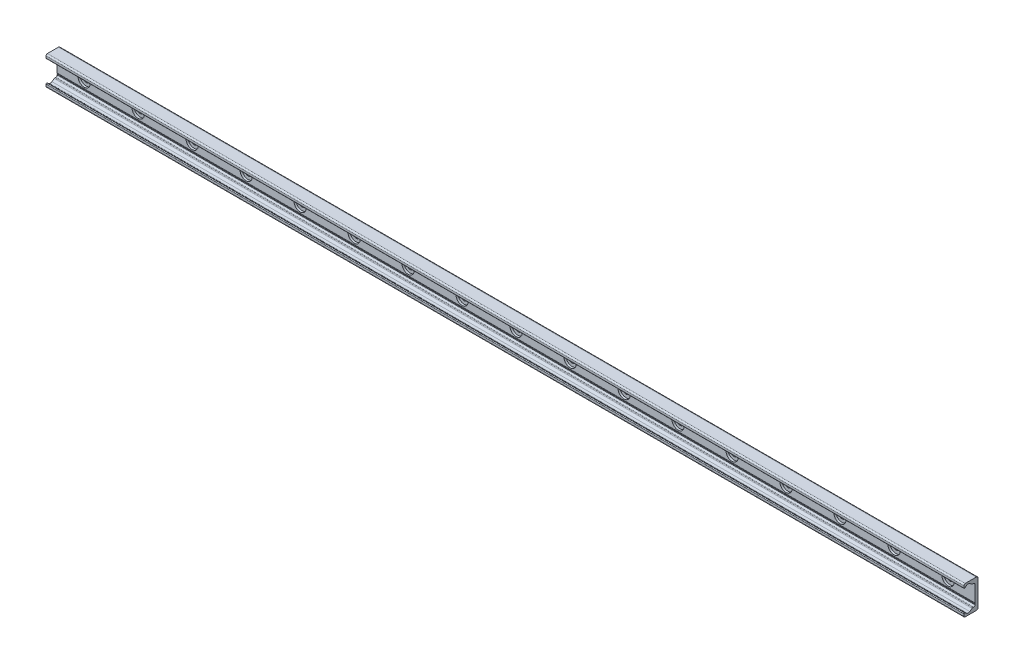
ISO-10303-21;
HEADER;
FILE_DESCRIPTION(('STEP AP214'),'2;1');
FILE_NAME('part.step','',(''),(''),'','','');
FILE_SCHEMA(('AUTOMOTIVE_DESIGN { 1 0 10303 214 1 1 1 1 }'));
ENDSEC;
DATA;
#1=APPLICATION_CONTEXT('core data for automotive mechanical design processes');
#2=APPLICATION_PROTOCOL_DEFINITION('international standard','automotive_design',2000,#1);
#3=PRODUCT_CONTEXT('',#1,'mechanical');
#4=PRODUCT('Part','Part','',(#3));
#5=PRODUCT_RELATED_PRODUCT_CATEGORY('part','',(#4));
#6=PRODUCT_DEFINITION_FORMATION('','',#4);
#7=PRODUCT_DEFINITION_CONTEXT('part definition',#1,'design');
#8=PRODUCT_DEFINITION('design','',#6,#7);
#9=PRODUCT_DEFINITION_SHAPE('','',#8);
#10=(LENGTH_UNIT() NAMED_UNIT(*) SI_UNIT(.MILLI.,.METRE.));
#11=(NAMED_UNIT(*) PLANE_ANGLE_UNIT() SI_UNIT($,.RADIAN.));
#12=(NAMED_UNIT(*) SI_UNIT($,.STERADIAN.) SOLID_ANGLE_UNIT());
#13=UNCERTAINTY_MEASURE_WITH_UNIT(LENGTH_MEASURE(1.E-05),#10,'distance_accuracy_value','');
#14=(GEOMETRIC_REPRESENTATION_CONTEXT(3) GLOBAL_UNCERTAINTY_ASSIGNED_CONTEXT((#13)) GLOBAL_UNIT_ASSIGNED_CONTEXT((#10,
#11,#12)) REPRESENTATION_CONTEXT('',''));
#15=CARTESIAN_POINT('',(0.,0.,0.));
#16=DIRECTION('',(0.,0.,1.));
#17=DIRECTION('',(1.,0.,0.));
#18=AXIS2_PLACEMENT_3D('',#15,#16,#17);
#19=CARTESIAN_POINT('',(-640.,0.,1.39999999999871));
#20=DIRECTION('',(0.,0.,1.));
#21=DIRECTION('',(1.,0.,0.));
#22=AXIS2_PLACEMENT_3D('',#19,#20,#21);
#23=PLANE('',#22);
#24=CARTESIAN_POINT('',(-640.,0.,1.39999999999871));
#25=DIRECTION('',(0.,0.,1.));
#26=DIRECTION('',(1.,0.,0.));
#27=AXIS2_PLACEMENT_3D('',#24,#25,#26);
#28=CIRCLE('',#27,4.49999999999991);
#29=CARTESIAN_POINT('',(-635.5,0.,1.39999999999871));
#30=VERTEX_POINT('',#29);
#31=EDGE_CURVE('E593',#30,#30,#28,.T.);
#32=ORIENTED_EDGE('',*,*,#31,.F.);
#33=EDGE_LOOP('',(#32));
#34=FACE_BOUND('',#33,.T.);
#35=CARTESIAN_POINT('',(-640.,0.,1.39999999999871));
#36=DIRECTION('',(0.,0.,1.));
#37=DIRECTION('',(1.,0.,0.));
#38=AXIS2_PLACEMENT_3D('',#35,#36,#37);
#39=CIRCLE('',#38,9.00000000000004);
#40=CARTESIAN_POINT('',(-631.,0.,1.39999999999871));
#41=VERTEX_POINT('',#40);
#42=EDGE_CURVE('E11',#41,#41,#39,.T.);
#43=ORIENTED_EDGE('',*,*,#42,.T.);
#44=EDGE_LOOP('',(#43));
#45=FACE_BOUND('',#44,.T.);
#46=ADVANCED_FACE('F39',(#34,#45),#23,.T.);
#47=CARTESIAN_POINT('',(-640.,0.,1.39999999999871));
#48=DIRECTION('',(0.,0.,1.));
#49=DIRECTION('',(1.,0.,0.));
#50=AXIS2_PLACEMENT_3D('',#47,#48,#49);
#51=CYLINDRICAL_SURFACE('',#50,9.00000000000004);
#52=CARTESIAN_POINT('',(-640.,0.,4.49999999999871));
#53=DIRECTION('',(0.,0.,1.));
#54=DIRECTION('',(1.,0.,0.));
#55=AXIS2_PLACEMENT_3D('',#52,#53,#54);
#56=CIRCLE('',#55,9.00000000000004);
#57=CARTESIAN_POINT('',(-631.,0.,4.49999999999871));
#58=VERTEX_POINT('',#57);
#59=EDGE_CURVE('E49',#58,#58,#56,.T.);
#60=CARTESIAN_POINT('',(-631.,0.,1.39999999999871));
#61=CARTESIAN_POINT('',(-631.,0.,1.43229166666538));
#62=CARTESIAN_POINT('',(-631.,0.,1.46458333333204));
#63=CARTESIAN_POINT('',(-631.,0.,1.52916666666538));
#64=CARTESIAN_POINT('',(-631.,0.,1.56145833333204));
#65=CARTESIAN_POINT('',(-631.,0.,1.62604166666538));
#66=CARTESIAN_POINT('',(-631.,0.,1.65833333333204));
#67=CARTESIAN_POINT('',(-631.,0.,1.72291666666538));
#68=CARTESIAN_POINT('',(-631.,0.,1.75520833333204));
#69=CARTESIAN_POINT('',(-631.,0.,1.81979166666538));
#70=CARTESIAN_POINT('',(-631.,0.,1.85208333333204));
#71=CARTESIAN_POINT('',(-631.,0.,1.91666666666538));
#72=CARTESIAN_POINT('',(-631.,0.,1.94895833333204));
#73=CARTESIAN_POINT('',(-631.,0.,2.01354166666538));
#74=CARTESIAN_POINT('',(-631.,0.,2.04583333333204));
#75=CARTESIAN_POINT('',(-631.,0.,2.11041666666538));
#76=CARTESIAN_POINT('',(-631.,0.,2.14270833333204));
#77=CARTESIAN_POINT('',(-631.,0.,2.20729166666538));
#78=CARTESIAN_POINT('',(-631.,0.,2.23958333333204));
#79=CARTESIAN_POINT('',(-631.,0.,2.30416666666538));
#80=CARTESIAN_POINT('',(-631.,0.,2.33645833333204));
#81=CARTESIAN_POINT('',(-631.,0.,2.40104166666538));
#82=CARTESIAN_POINT('',(-631.,0.,2.43333333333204));
#83=CARTESIAN_POINT('',(-631.,0.,2.49791666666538));
#84=CARTESIAN_POINT('',(-631.,0.,2.53020833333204));
#85=CARTESIAN_POINT('',(-631.,0.,2.59479166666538));
#86=CARTESIAN_POINT('',(-631.,0.,2.62708333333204));
#87=CARTESIAN_POINT('',(-631.,0.,2.69166666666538));
#88=CARTESIAN_POINT('',(-631.,0.,2.72395833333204));
#89=CARTESIAN_POINT('',(-631.,0.,2.78854166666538));
#90=CARTESIAN_POINT('',(-631.,0.,2.82083333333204));
#91=CARTESIAN_POINT('',(-631.,0.,2.88541666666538));
#92=CARTESIAN_POINT('',(-631.,0.,2.91770833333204));
#93=CARTESIAN_POINT('',(-631.,0.,2.98229166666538));
#94=CARTESIAN_POINT('',(-631.,0.,3.01458333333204));
#95=CARTESIAN_POINT('',(-631.,0.,3.07916666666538));
#96=CARTESIAN_POINT('',(-631.,0.,3.11145833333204));
#97=CARTESIAN_POINT('',(-631.,0.,3.17604166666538));
#98=CARTESIAN_POINT('',(-631.,0.,3.20833333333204));
#99=CARTESIAN_POINT('',(-631.,0.,3.27291666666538));
#100=CARTESIAN_POINT('',(-631.,0.,3.30520833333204));
#101=CARTESIAN_POINT('',(-631.,0.,3.36979166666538));
#102=CARTESIAN_POINT('',(-631.,0.,3.40208333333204));
#103=CARTESIAN_POINT('',(-631.,0.,3.46666666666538));
#104=CARTESIAN_POINT('',(-631.,0.,3.49895833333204));
#105=CARTESIAN_POINT('',(-631.,0.,3.56354166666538));
#106=CARTESIAN_POINT('',(-631.,0.,3.59583333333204));
#107=CARTESIAN_POINT('',(-631.,0.,3.66041666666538));
#108=CARTESIAN_POINT('',(-631.,0.,3.69270833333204));
#109=CARTESIAN_POINT('',(-631.,0.,3.75729166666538));
#110=CARTESIAN_POINT('',(-631.,0.,3.78958333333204));
#111=CARTESIAN_POINT('',(-631.,0.,3.85416666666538));
#112=CARTESIAN_POINT('',(-631.,0.,3.88645833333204));
#113=CARTESIAN_POINT('',(-631.,0.,3.95104166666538));
#114=CARTESIAN_POINT('',(-631.,0.,3.98333333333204));
#115=CARTESIAN_POINT('',(-631.,0.,4.04791666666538));
#116=CARTESIAN_POINT('',(-631.,0.,4.08020833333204));
#117=CARTESIAN_POINT('',(-631.,0.,4.14479166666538));
#118=CARTESIAN_POINT('',(-631.,0.,4.17708333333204));
#119=CARTESIAN_POINT('',(-631.,0.,4.24166666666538));
#120=CARTESIAN_POINT('',(-631.,0.,4.27395833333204));
#121=CARTESIAN_POINT('',(-631.,0.,4.33854166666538));
#122=CARTESIAN_POINT('',(-631.,0.,4.37083333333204));
#123=CARTESIAN_POINT('',(-631.,0.,4.43541666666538));
#124=CARTESIAN_POINT('',(-631.,0.,4.46770833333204));
#125=CARTESIAN_POINT('',(-631.,0.,4.49999999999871));
#126=B_SPLINE_CURVE_WITH_KNOTS('',3,(#60,#61,#62,#63,#64,#65,#66,#67,#68,#69,#70,#71,#72,#73,
#74,#75,#76,#77,#78,#79,#80,#81,#82,#83,#84,#85,#86,#87,#88,#89,#90,#91,#92,#93,#94,#95,#96,#97,
#98,#99,#100,#101,#102,#103,#104,#105,#106,#107,#108,#109,#110,#111,#112,#113,#114,#115,#116,
#117,#118,#119,#120,#121,#122,#123,#124,#125),.UNSPECIFIED.,.F.,.F.,(4,2,2,2,2,2,2,2,2,2,2,2,2,
2,2,2,2,2,2,2,2,2,2,2,2,2,2,2,2,2,2,2,4),(0.,0.0968750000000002,0.19375,0.290625,0.3875,
0.484375,0.58125,0.678125,0.775,0.871875,0.96875,1.065625,1.1625,1.259375,1.35625,1.453125,1.55,
1.646875,1.74375,1.840625,1.9375,2.034375,2.13125,2.228125,2.325,2.421875,2.51875,2.615625,
2.7125,2.809375,2.90625,3.003125,3.1),.UNSPECIFIED.);
#127=EDGE_CURVE('BSEAM563',#41,#58,#126,.T.);
#128=ORIENTED_EDGE('',*,*,#42,.F.);
#129=ORIENTED_EDGE('',*,*,#59,.T.);
#130=ORIENTED_EDGE('',*,*,#127,.T.);
#131=ORIENTED_EDGE('',*,*,#127,.F.);
#132=EDGE_LOOP('',(#128,#130,#129,#131));
#133=FACE_BOUND('',#132,.T.);
#134=ADVANCED_FACE('F563',(#133),#51,.F.);
#135=CARTESIAN_POINT('',(-560.,0.,1.39999999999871));
#136=DIRECTION('',(0.,0.,1.));
#137=DIRECTION('',(1.,0.,0.));
#138=AXIS2_PLACEMENT_3D('',#135,#136,#137);
#139=PLANE('',#138);
#140=CARTESIAN_POINT('',(-560.,0.,1.39999999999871));
#141=DIRECTION('',(0.,0.,1.));
#142=DIRECTION('',(1.,0.,0.));
#143=AXIS2_PLACEMENT_3D('',#140,#141,#142);
#144=CIRCLE('',#143,4.49999999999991);
#145=CARTESIAN_POINT('',(-555.5,0.,1.39999999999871));
#146=VERTEX_POINT('',#145);
#147=EDGE_CURVE('E597',#146,#146,#144,.T.);
#148=ORIENTED_EDGE('',*,*,#147,.F.);
#149=EDGE_LOOP('',(#148));
#150=FACE_BOUND('',#149,.T.);
#151=CARTESIAN_POINT('',(-560.,0.,1.39999999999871));
#152=DIRECTION('',(0.,0.,1.));
#153=DIRECTION('',(1.,0.,0.));
#154=AXIS2_PLACEMENT_3D('',#151,#152,#153);
#155=CIRCLE('',#154,9.00000000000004);
#156=CARTESIAN_POINT('',(-551.,0.,1.39999999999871));
#157=VERTEX_POINT('',#156);
#158=EDGE_CURVE('E555',#157,#157,#155,.T.);
#159=ORIENTED_EDGE('',*,*,#158,.T.);
#160=EDGE_LOOP('',(#159));
#161=FACE_BOUND('',#160,.T.);
#162=ADVANCED_FACE('F588',(#150,#161),#139,.T.);
#163=CARTESIAN_POINT('',(-560.,0.,1.39999999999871));
#164=DIRECTION('',(0.,0.,1.));
#165=DIRECTION('',(1.,0.,0.));
#166=AXIS2_PLACEMENT_3D('',#163,#164,#165);
#167=CYLINDRICAL_SURFACE('',#166,9.00000000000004);
#168=CARTESIAN_POINT('',(-560.,0.,4.49999999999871));
#169=DIRECTION('',(0.,0.,1.));
#170=DIRECTION('',(1.,0.,0.));
#171=AXIS2_PLACEMENT_3D('',#168,#169,#170);
#172=CIRCLE('',#171,9.00000000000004);
#173=CARTESIAN_POINT('',(-551.,0.,4.49999999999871));
#174=VERTEX_POINT('',#173);
#175=EDGE_CURVE('E551',#174,#174,#172,.T.);
#176=CARTESIAN_POINT('',(-551.,0.,1.39999999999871));
#177=CARTESIAN_POINT('',(-551.,0.,1.43229166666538));
#178=CARTESIAN_POINT('',(-551.,0.,1.46458333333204));
#179=CARTESIAN_POINT('',(-551.,0.,1.52916666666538));
#180=CARTESIAN_POINT('',(-551.,0.,1.56145833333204));
#181=CARTESIAN_POINT('',(-551.,0.,1.62604166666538));
#182=CARTESIAN_POINT('',(-551.,0.,1.65833333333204));
#183=CARTESIAN_POINT('',(-551.,0.,1.72291666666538));
#184=CARTESIAN_POINT('',(-551.,0.,1.75520833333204));
#185=CARTESIAN_POINT('',(-551.,0.,1.81979166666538));
#186=CARTESIAN_POINT('',(-551.,0.,1.85208333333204));
#187=CARTESIAN_POINT('',(-551.,0.,1.91666666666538));
#188=CARTESIAN_POINT('',(-551.,0.,1.94895833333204));
#189=CARTESIAN_POINT('',(-551.,0.,2.01354166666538));
#190=CARTESIAN_POINT('',(-551.,0.,2.04583333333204));
#191=CARTESIAN_POINT('',(-551.,0.,2.11041666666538));
#192=CARTESIAN_POINT('',(-551.,0.,2.14270833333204));
#193=CARTESIAN_POINT('',(-551.,0.,2.20729166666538));
#194=CARTESIAN_POINT('',(-551.,0.,2.23958333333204));
#195=CARTESIAN_POINT('',(-551.,0.,2.30416666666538));
#196=CARTESIAN_POINT('',(-551.,0.,2.33645833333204));
#197=CARTESIAN_POINT('',(-551.,0.,2.40104166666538));
#198=CARTESIAN_POINT('',(-551.,0.,2.43333333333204));
#199=CARTESIAN_POINT('',(-551.,0.,2.49791666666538));
#200=CARTESIAN_POINT('',(-551.,0.,2.53020833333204));
#201=CARTESIAN_POINT('',(-551.,0.,2.59479166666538));
#202=CARTESIAN_POINT('',(-551.,0.,2.62708333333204));
#203=CARTESIAN_POINT('',(-551.,0.,2.69166666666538));
#204=CARTESIAN_POINT('',(-551.,0.,2.72395833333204));
#205=CARTESIAN_POINT('',(-551.,0.,2.78854166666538));
#206=CARTESIAN_POINT('',(-551.,0.,2.82083333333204));
#207=CARTESIAN_POINT('',(-551.,0.,2.88541666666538));
#208=CARTESIAN_POINT('',(-551.,0.,2.91770833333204));
#209=CARTESIAN_POINT('',(-551.,0.,2.98229166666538));
#210=CARTESIAN_POINT('',(-551.,0.,3.01458333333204));
#211=CARTESIAN_POINT('',(-551.,0.,3.07916666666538));
#212=CARTESIAN_POINT('',(-551.,0.,3.11145833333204));
#213=CARTESIAN_POINT('',(-551.,0.,3.17604166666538));
#214=CARTESIAN_POINT('',(-551.,0.,3.20833333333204));
#215=CARTESIAN_POINT('',(-551.,0.,3.27291666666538));
#216=CARTESIAN_POINT('',(-551.,0.,3.30520833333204));
#217=CARTESIAN_POINT('',(-551.,0.,3.36979166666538));
#218=CARTESIAN_POINT('',(-551.,0.,3.40208333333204));
#219=CARTESIAN_POINT('',(-551.,0.,3.46666666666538));
#220=CARTESIAN_POINT('',(-551.,0.,3.49895833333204));
#221=CARTESIAN_POINT('',(-551.,0.,3.56354166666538));
#222=CARTESIAN_POINT('',(-551.,0.,3.59583333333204));
#223=CARTESIAN_POINT('',(-551.,0.,3.66041666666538));
#224=CARTESIAN_POINT('',(-551.,0.,3.69270833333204));
#225=CARTESIAN_POINT('',(-551.,0.,3.75729166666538));
#226=CARTESIAN_POINT('',(-551.,0.,3.78958333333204));
#227=CARTESIAN_POINT('',(-551.,0.,3.85416666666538));
#228=CARTESIAN_POINT('',(-551.,0.,3.88645833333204));
#229=CARTESIAN_POINT('',(-551.,0.,3.95104166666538));
#230=CARTESIAN_POINT('',(-551.,0.,3.98333333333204));
#231=CARTESIAN_POINT('',(-551.,0.,4.04791666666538));
#232=CARTESIAN_POINT('',(-551.,0.,4.08020833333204));
#233=CARTESIAN_POINT('',(-551.,0.,4.14479166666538));
#234=CARTESIAN_POINT('',(-551.,0.,4.17708333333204));
#235=CARTESIAN_POINT('',(-551.,0.,4.24166666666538));
#236=CARTESIAN_POINT('',(-551.,0.,4.27395833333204));
#237=CARTESIAN_POINT('',(-551.,0.,4.33854166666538));
#238=CARTESIAN_POINT('',(-551.,0.,4.37083333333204));
#239=CARTESIAN_POINT('',(-551.,0.,4.43541666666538));
#240=CARTESIAN_POINT('',(-551.,0.,4.46770833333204));
#241=CARTESIAN_POINT('',(-551.,0.,4.49999999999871));
#242=B_SPLINE_CURVE_WITH_KNOTS('',3,(#176,#177,#178,#179,#180,#181,#182,#183,#184,#185,#186,
#187,#188,#189,#190,#191,#192,#193,#194,#195,#196,#197,#198,#199,#200,#201,#202,#203,#204,#205,
#206,#207,#208,#209,#210,#211,#212,#213,#214,#215,#216,#217,#218,#219,#220,#221,#222,#223,#224,
#225,#226,#227,#228,#229,#230,#231,#232,#233,#234,#235,#236,#237,#238,#239,#240,#241),
.UNSPECIFIED.,.F.,.F.,(4,2,2,2,2,2,2,2,2,2,2,2,2,2,2,2,2,2,2,2,2,2,2,2,2,2,2,2,2,2,2,2,4),(0.,
0.0968750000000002,0.19375,0.290625,0.3875,0.484375,0.58125,0.678125,0.775,0.871875,0.96875,
1.065625,1.1625,1.259375,1.35625,1.453125,1.55,1.646875,1.74375,1.840625,1.9375,2.034375,
2.13125,2.228125,2.325,2.421875,2.51875,2.615625,2.7125,2.809375,2.90625,3.003125,3.1),.UNSPECIFIED.);
#243=EDGE_CURVE('BSEAM1119',#157,#174,#242,.T.);
#244=ORIENTED_EDGE('',*,*,#158,.F.);
#245=ORIENTED_EDGE('',*,*,#175,.T.);
#246=ORIENTED_EDGE('',*,*,#243,.T.);
#247=ORIENTED_EDGE('',*,*,#243,.F.);
#248=EDGE_LOOP('',(#244,#246,#245,#247));
#249=FACE_BOUND('',#248,.T.);
#250=ADVANCED_FACE('F1119',(#249),#167,.F.);
#251=CARTESIAN_POINT('',(-480.,0.,1.39999999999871));
#252=DIRECTION('',(0.,0.,1.));
#253=DIRECTION('',(1.,0.,0.));
#254=AXIS2_PLACEMENT_3D('',#251,#252,#253);
#255=PLANE('',#254);
#256=CARTESIAN_POINT('',(-480.,0.,1.39999999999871));
#257=DIRECTION('',(0.,0.,1.));
#258=DIRECTION('',(1.,0.,0.));
#259=AXIS2_PLACEMENT_3D('',#256,#257,#258);
#260=CIRCLE('',#259,4.49999999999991);
#261=CARTESIAN_POINT('',(-475.5,0.,1.39999999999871));
#262=VERTEX_POINT('',#261);
#263=EDGE_CURVE('E602',#262,#262,#260,.T.);
#264=ORIENTED_EDGE('',*,*,#263,.F.);
#265=EDGE_LOOP('',(#264));
#266=FACE_BOUND('',#265,.T.);
#267=CARTESIAN_POINT('',(-480.,0.,1.39999999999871));
#268=DIRECTION('',(0.,0.,1.));
#269=DIRECTION('',(1.,0.,0.));
#270=AXIS2_PLACEMENT_3D('',#267,#268,#269);
#271=CIRCLE('',#270,9.00000000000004);
#272=CARTESIAN_POINT('',(-471.,0.,1.39999999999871));
#273=VERTEX_POINT('',#272);
#274=EDGE_CURVE('E547',#273,#273,#271,.T.);
#275=ORIENTED_EDGE('',*,*,#274,.T.);
#276=EDGE_LOOP('',(#275));
#277=FACE_BOUND('',#276,.T.);
#278=ADVANCED_FACE('F1115',(#266,#277),#255,.T.);
#279=CARTESIAN_POINT('',(-480.,0.,1.39999999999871));
#280=DIRECTION('',(0.,0.,1.));
#281=DIRECTION('',(1.,0.,0.));
#282=AXIS2_PLACEMENT_3D('',#279,#280,#281);
#283=CYLINDRICAL_SURFACE('',#282,9.00000000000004);
#284=CARTESIAN_POINT('',(-480.,0.,4.49999999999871));
#285=DIRECTION('',(0.,0.,1.));
#286=DIRECTION('',(1.,0.,0.));
#287=AXIS2_PLACEMENT_3D('',#284,#285,#286);
#288=CIRCLE('',#287,9.00000000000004);
#289=CARTESIAN_POINT('',(-471.,0.,4.49999999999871));
#290=VERTEX_POINT('',#289);
#291=EDGE_CURVE('E543',#290,#290,#288,.T.);
#292=CARTESIAN_POINT('',(-471.,0.,1.39999999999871));
#293=CARTESIAN_POINT('',(-471.,0.,1.43229166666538));
#294=CARTESIAN_POINT('',(-471.,0.,1.46458333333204));
#295=CARTESIAN_POINT('',(-471.,0.,1.52916666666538));
#296=CARTESIAN_POINT('',(-471.,0.,1.56145833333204));
#297=CARTESIAN_POINT('',(-471.,0.,1.62604166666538));
#298=CARTESIAN_POINT('',(-471.,0.,1.65833333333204));
#299=CARTESIAN_POINT('',(-471.,0.,1.72291666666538));
#300=CARTESIAN_POINT('',(-471.,0.,1.75520833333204));
#301=CARTESIAN_POINT('',(-471.,0.,1.81979166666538));
#302=CARTESIAN_POINT('',(-471.,0.,1.85208333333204));
#303=CARTESIAN_POINT('',(-471.,0.,1.91666666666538));
#304=CARTESIAN_POINT('',(-471.,0.,1.94895833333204));
#305=CARTESIAN_POINT('',(-471.,0.,2.01354166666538));
#306=CARTESIAN_POINT('',(-471.,0.,2.04583333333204));
#307=CARTESIAN_POINT('',(-471.,0.,2.11041666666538));
#308=CARTESIAN_POINT('',(-471.,0.,2.14270833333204));
#309=CARTESIAN_POINT('',(-471.,0.,2.20729166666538));
#310=CARTESIAN_POINT('',(-471.,0.,2.23958333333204));
#311=CARTESIAN_POINT('',(-471.,0.,2.30416666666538));
#312=CARTESIAN_POINT('',(-471.,0.,2.33645833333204));
#313=CARTESIAN_POINT('',(-471.,0.,2.40104166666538));
#314=CARTESIAN_POINT('',(-471.,0.,2.43333333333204));
#315=CARTESIAN_POINT('',(-471.,0.,2.49791666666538));
#316=CARTESIAN_POINT('',(-471.,0.,2.53020833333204));
#317=CARTESIAN_POINT('',(-471.,0.,2.59479166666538));
#318=CARTESIAN_POINT('',(-471.,0.,2.62708333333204));
#319=CARTESIAN_POINT('',(-471.,0.,2.69166666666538));
#320=CARTESIAN_POINT('',(-471.,0.,2.72395833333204));
#321=CARTESIAN_POINT('',(-471.,0.,2.78854166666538));
#322=CARTESIAN_POINT('',(-471.,0.,2.82083333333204));
#323=CARTESIAN_POINT('',(-471.,0.,2.88541666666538));
#324=CARTESIAN_POINT('',(-471.,0.,2.91770833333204));
#325=CARTESIAN_POINT('',(-471.,0.,2.98229166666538));
#326=CARTESIAN_POINT('',(-471.,0.,3.01458333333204));
#327=CARTESIAN_POINT('',(-471.,0.,3.07916666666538));
#328=CARTESIAN_POINT('',(-471.,0.,3.11145833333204));
#329=CARTESIAN_POINT('',(-471.,0.,3.17604166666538));
#330=CARTESIAN_POINT('',(-471.,0.,3.20833333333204));
#331=CARTESIAN_POINT('',(-471.,0.,3.27291666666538));
#332=CARTESIAN_POINT('',(-471.,0.,3.30520833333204));
#333=CARTESIAN_POINT('',(-471.,0.,3.36979166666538));
#334=CARTESIAN_POINT('',(-471.,0.,3.40208333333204));
#335=CARTESIAN_POINT('',(-471.,0.,3.46666666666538));
#336=CARTESIAN_POINT('',(-471.,0.,3.49895833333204));
#337=CARTESIAN_POINT('',(-471.,0.,3.56354166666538));
#338=CARTESIAN_POINT('',(-471.,0.,3.59583333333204));
#339=CARTESIAN_POINT('',(-471.,0.,3.66041666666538));
#340=CARTESIAN_POINT('',(-471.,0.,3.69270833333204));
#341=CARTESIAN_POINT('',(-471.,0.,3.75729166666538));
#342=CARTESIAN_POINT('',(-471.,0.,3.78958333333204));
#343=CARTESIAN_POINT('',(-471.,0.,3.85416666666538));
#344=CARTESIAN_POINT('',(-471.,0.,3.88645833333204));
#345=CARTESIAN_POINT('',(-471.,0.,3.95104166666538));
#346=CARTESIAN_POINT('',(-471.,0.,3.98333333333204));
#347=CARTESIAN_POINT('',(-471.,0.,4.04791666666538));
#348=CARTESIAN_POINT('',(-471.,0.,4.08020833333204));
#349=CARTESIAN_POINT('',(-471.,0.,4.14479166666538));
#350=CARTESIAN_POINT('',(-471.,0.,4.17708333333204));
#351=CARTESIAN_POINT('',(-471.,0.,4.24166666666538));
#352=CARTESIAN_POINT('',(-471.,0.,4.27395833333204));
#353=CARTESIAN_POINT('',(-471.,0.,4.33854166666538));
#354=CARTESIAN_POINT('',(-471.,0.,4.37083333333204));
#355=CARTESIAN_POINT('',(-471.,0.,4.43541666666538));
#356=CARTESIAN_POINT('',(-471.,0.,4.46770833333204));
#357=CARTESIAN_POINT('',(-471.,0.,4.49999999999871));
#358=B_SPLINE_CURVE_WITH_KNOTS('',3,(#292,#293,#294,#295,#296,#297,#298,#299,#300,#301,#302,
#303,#304,#305,#306,#307,#308,#309,#310,#311,#312,#313,#314,#315,#316,#317,#318,#319,#320,#321,
#322,#323,#324,#325,#326,#327,#328,#329,#330,#331,#332,#333,#334,#335,#336,#337,#338,#339,#340,
#341,#342,#343,#344,#345,#346,#347,#348,#349,#350,#351,#352,#353,#354,#355,#356,#357),
.UNSPECIFIED.,.F.,.F.,(4,2,2,2,2,2,2,2,2,2,2,2,2,2,2,2,2,2,2,2,2,2,2,2,2,2,2,2,2,2,2,2,4),(0.,
0.0968750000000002,0.19375,0.290625,0.3875,0.484375,0.58125,0.678125,0.775,0.871875,0.96875,
1.065625,1.1625,1.259375,1.35625,1.453125,1.55,1.646875,1.74375,1.840625,1.9375,2.034375,
2.13125,2.228125,2.325,2.421875,2.51875,2.615625,2.7125,2.809375,2.90625,3.003125,3.1),.UNSPECIFIED.);
#359=EDGE_CURVE('BSEAM1111',#273,#290,#358,.T.);
#360=ORIENTED_EDGE('',*,*,#274,.F.);
#361=ORIENTED_EDGE('',*,*,#291,.T.);
#362=ORIENTED_EDGE('',*,*,#359,.T.);
#363=ORIENTED_EDGE('',*,*,#359,.F.);
#364=EDGE_LOOP('',(#360,#362,#361,#363));
#365=FACE_BOUND('',#364,.T.);
#366=ADVANCED_FACE('F1111',(#365),#283,.F.);
#367=CARTESIAN_POINT('',(-400.,0.,1.39999999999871));
#368=DIRECTION('',(0.,0.,1.));
#369=DIRECTION('',(1.,0.,0.));
#370=AXIS2_PLACEMENT_3D('',#367,#368,#369);
#371=PLANE('',#370);
#372=CARTESIAN_POINT('',(-400.,0.,1.39999999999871));
#373=DIRECTION('',(0.,0.,1.));
#374=DIRECTION('',(1.,0.,0.));
#375=AXIS2_PLACEMENT_3D('',#372,#373,#374);
#376=CIRCLE('',#375,4.49999999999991);
#377=CARTESIAN_POINT('',(-395.5,0.,1.39999999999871));
#378=VERTEX_POINT('',#377);
#379=EDGE_CURVE('E614',#378,#378,#376,.T.);
#380=ORIENTED_EDGE('',*,*,#379,.F.);
#381=EDGE_LOOP('',(#380));
#382=FACE_BOUND('',#381,.T.);
#383=CARTESIAN_POINT('',(-400.,0.,1.39999999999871));
#384=DIRECTION('',(0.,0.,1.));
#385=DIRECTION('',(1.,0.,0.));
#386=AXIS2_PLACEMENT_3D('',#383,#384,#385);
#387=CIRCLE('',#386,9.00000000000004);
#388=CARTESIAN_POINT('',(-391.,0.,1.39999999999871));
#389=VERTEX_POINT('',#388);
#390=EDGE_CURVE('E539',#389,#389,#387,.T.);
#391=ORIENTED_EDGE('',*,*,#390,.T.);
#392=EDGE_LOOP('',(#391));
#393=FACE_BOUND('',#392,.T.);
#394=ADVANCED_FACE('F1107',(#382,#393),#371,.T.);
#395=CARTESIAN_POINT('',(-400.,0.,1.39999999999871));
#396=DIRECTION('',(0.,0.,1.));
#397=DIRECTION('',(1.,0.,0.));
#398=AXIS2_PLACEMENT_3D('',#395,#396,#397);
#399=CYLINDRICAL_SURFACE('',#398,9.00000000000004);
#400=CARTESIAN_POINT('',(-400.,0.,4.49999999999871));
#401=DIRECTION('',(0.,0.,1.));
#402=DIRECTION('',(1.,0.,0.));
#403=AXIS2_PLACEMENT_3D('',#400,#401,#402);
#404=CIRCLE('',#403,9.00000000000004);
#405=CARTESIAN_POINT('',(-391.,0.,4.49999999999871));
#406=VERTEX_POINT('',#405);
#407=EDGE_CURVE('E535',#406,#406,#404,.T.);
#408=CARTESIAN_POINT('',(-391.,0.,1.39999999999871));
#409=CARTESIAN_POINT('',(-391.,0.,1.43229166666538));
#410=CARTESIAN_POINT('',(-391.,0.,1.46458333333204));
#411=CARTESIAN_POINT('',(-391.,0.,1.52916666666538));
#412=CARTESIAN_POINT('',(-391.,0.,1.56145833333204));
#413=CARTESIAN_POINT('',(-391.,0.,1.62604166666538));
#414=CARTESIAN_POINT('',(-391.,0.,1.65833333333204));
#415=CARTESIAN_POINT('',(-391.,0.,1.72291666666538));
#416=CARTESIAN_POINT('',(-391.,0.,1.75520833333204));
#417=CARTESIAN_POINT('',(-391.,0.,1.81979166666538));
#418=CARTESIAN_POINT('',(-391.,0.,1.85208333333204));
#419=CARTESIAN_POINT('',(-391.,0.,1.91666666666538));
#420=CARTESIAN_POINT('',(-391.,0.,1.94895833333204));
#421=CARTESIAN_POINT('',(-391.,0.,2.01354166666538));
#422=CARTESIAN_POINT('',(-391.,0.,2.04583333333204));
#423=CARTESIAN_POINT('',(-391.,0.,2.11041666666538));
#424=CARTESIAN_POINT('',(-391.,0.,2.14270833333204));
#425=CARTESIAN_POINT('',(-391.,0.,2.20729166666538));
#426=CARTESIAN_POINT('',(-391.,0.,2.23958333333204));
#427=CARTESIAN_POINT('',(-391.,0.,2.30416666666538));
#428=CARTESIAN_POINT('',(-391.,0.,2.33645833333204));
#429=CARTESIAN_POINT('',(-391.,0.,2.40104166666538));
#430=CARTESIAN_POINT('',(-391.,0.,2.43333333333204));
#431=CARTESIAN_POINT('',(-391.,0.,2.49791666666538));
#432=CARTESIAN_POINT('',(-391.,0.,2.53020833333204));
#433=CARTESIAN_POINT('',(-391.,0.,2.59479166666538));
#434=CARTESIAN_POINT('',(-391.,0.,2.62708333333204));
#435=CARTESIAN_POINT('',(-391.,0.,2.69166666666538));
#436=CARTESIAN_POINT('',(-391.,0.,2.72395833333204));
#437=CARTESIAN_POINT('',(-391.,0.,2.78854166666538));
#438=CARTESIAN_POINT('',(-391.,0.,2.82083333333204));
#439=CARTESIAN_POINT('',(-391.,0.,2.88541666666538));
#440=CARTESIAN_POINT('',(-391.,0.,2.91770833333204));
#441=CARTESIAN_POINT('',(-391.,0.,2.98229166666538));
#442=CARTESIAN_POINT('',(-391.,0.,3.01458333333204));
#443=CARTESIAN_POINT('',(-391.,0.,3.07916666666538));
#444=CARTESIAN_POINT('',(-391.,0.,3.11145833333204));
#445=CARTESIAN_POINT('',(-391.,0.,3.17604166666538));
#446=CARTESIAN_POINT('',(-391.,0.,3.20833333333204));
#447=CARTESIAN_POINT('',(-391.,0.,3.27291666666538));
#448=CARTESIAN_POINT('',(-391.,0.,3.30520833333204));
#449=CARTESIAN_POINT('',(-391.,0.,3.36979166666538));
#450=CARTESIAN_POINT('',(-391.,0.,3.40208333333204));
#451=CARTESIAN_POINT('',(-391.,0.,3.46666666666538));
#452=CARTESIAN_POINT('',(-391.,0.,3.49895833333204));
#453=CARTESIAN_POINT('',(-391.,0.,3.56354166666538));
#454=CARTESIAN_POINT('',(-391.,0.,3.59583333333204));
#455=CARTESIAN_POINT('',(-391.,0.,3.66041666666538));
#456=CARTESIAN_POINT('',(-391.,0.,3.69270833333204));
#457=CARTESIAN_POINT('',(-391.,0.,3.75729166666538));
#458=CARTESIAN_POINT('',(-391.,0.,3.78958333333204));
#459=CARTESIAN_POINT('',(-391.,0.,3.85416666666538));
#460=CARTESIAN_POINT('',(-391.,0.,3.88645833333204));
#461=CARTESIAN_POINT('',(-391.,0.,3.95104166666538));
#462=CARTESIAN_POINT('',(-391.,0.,3.98333333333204));
#463=CARTESIAN_POINT('',(-391.,0.,4.04791666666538));
#464=CARTESIAN_POINT('',(-391.,0.,4.08020833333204));
#465=CARTESIAN_POINT('',(-391.,0.,4.14479166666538));
#466=CARTESIAN_POINT('',(-391.,0.,4.17708333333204));
#467=CARTESIAN_POINT('',(-391.,0.,4.24166666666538));
#468=CARTESIAN_POINT('',(-391.,0.,4.27395833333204));
#469=CARTESIAN_POINT('',(-391.,0.,4.33854166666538));
#470=CARTESIAN_POINT('',(-391.,0.,4.37083333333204));
#471=CARTESIAN_POINT('',(-391.,0.,4.43541666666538));
#472=CARTESIAN_POINT('',(-391.,0.,4.46770833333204));
#473=CARTESIAN_POINT('',(-391.,0.,4.49999999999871));
#474=B_SPLINE_CURVE_WITH_KNOTS('',3,(#408,#409,#410,#411,#412,#413,#414,#415,#416,#417,#418,
#419,#420,#421,#422,#423,#424,#425,#426,#427,#428,#429,#430,#431,#432,#433,#434,#435,#436,#437,
#438,#439,#440,#441,#442,#443,#444,#445,#446,#447,#448,#449,#450,#451,#452,#453,#454,#455,#456,
#457,#458,#459,#460,#461,#462,#463,#464,#465,#466,#467,#468,#469,#470,#471,#472,#473),
.UNSPECIFIED.,.F.,.F.,(4,2,2,2,2,2,2,2,2,2,2,2,2,2,2,2,2,2,2,2,2,2,2,2,2,2,2,2,2,2,2,2,4),(0.,
0.0968750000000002,0.19375,0.290625,0.3875,0.484375,0.58125,0.678125,0.775,0.871875,0.96875,
1.065625,1.1625,1.259375,1.35625,1.453125,1.55,1.646875,1.74375,1.840625,1.9375,2.034375,
2.13125,2.228125,2.325,2.421875,2.51875,2.615625,2.7125,2.809375,2.90625,3.003125,3.1),.UNSPECIFIED.);
#475=EDGE_CURVE('BSEAM1103',#389,#406,#474,.T.);
#476=ORIENTED_EDGE('',*,*,#390,.F.);
#477=ORIENTED_EDGE('',*,*,#407,.T.);
#478=ORIENTED_EDGE('',*,*,#475,.T.);
#479=ORIENTED_EDGE('',*,*,#475,.F.);
#480=EDGE_LOOP('',(#476,#478,#477,#479));
#481=FACE_BOUND('',#480,.T.);
#482=ADVANCED_FACE('F1103',(#481),#399,.F.);
#483=CARTESIAN_POINT('',(-320.,0.,1.39999999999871));
#484=DIRECTION('',(0.,0.,1.));
#485=DIRECTION('',(1.,0.,0.));
#486=AXIS2_PLACEMENT_3D('',#483,#484,#485);
#487=PLANE('',#486);
#488=CARTESIAN_POINT('',(-320.,0.,1.39999999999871));
#489=DIRECTION('',(0.,0.,1.));
#490=DIRECTION('',(1.,0.,0.));
#491=AXIS2_PLACEMENT_3D('',#488,#489,#490);
#492=CIRCLE('',#491,4.49999999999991);
#493=CARTESIAN_POINT('',(-315.5,0.,1.39999999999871));
#494=VERTEX_POINT('',#493);
#495=EDGE_CURVE('E618',#494,#494,#492,.T.);
#496=ORIENTED_EDGE('',*,*,#495,.F.);
#497=EDGE_LOOP('',(#496));
#498=FACE_BOUND('',#497,.T.);
#499=CARTESIAN_POINT('',(-320.,0.,1.39999999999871));
#500=DIRECTION('',(0.,0.,1.));
#501=DIRECTION('',(1.,0.,0.));
#502=AXIS2_PLACEMENT_3D('',#499,#500,#501);
#503=CIRCLE('',#502,9.00000000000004);
#504=CARTESIAN_POINT('',(-311.,0.,1.39999999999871));
#505=VERTEX_POINT('',#504);
#506=EDGE_CURVE('E531',#505,#505,#503,.T.);
#507=ORIENTED_EDGE('',*,*,#506,.T.);
#508=EDGE_LOOP('',(#507));
#509=FACE_BOUND('',#508,.T.);
#510=ADVANCED_FACE('F1099',(#498,#509),#487,.T.);
#511=CARTESIAN_POINT('',(-320.,0.,1.39999999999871));
#512=DIRECTION('',(0.,0.,1.));
#513=DIRECTION('',(1.,0.,0.));
#514=AXIS2_PLACEMENT_3D('',#511,#512,#513);
#515=CYLINDRICAL_SURFACE('',#514,9.00000000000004);
#516=CARTESIAN_POINT('',(-320.,0.,4.49999999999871));
#517=DIRECTION('',(0.,0.,1.));
#518=DIRECTION('',(1.,0.,0.));
#519=AXIS2_PLACEMENT_3D('',#516,#517,#518);
#520=CIRCLE('',#519,9.00000000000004);
#521=CARTESIAN_POINT('',(-311.,0.,4.49999999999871));
#522=VERTEX_POINT('',#521);
#523=EDGE_CURVE('E527',#522,#522,#520,.T.);
#524=CARTESIAN_POINT('',(-311.,0.,1.39999999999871));
#525=CARTESIAN_POINT('',(-311.,0.,1.43229166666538));
#526=CARTESIAN_POINT('',(-311.,0.,1.46458333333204));
#527=CARTESIAN_POINT('',(-311.,0.,1.52916666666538));
#528=CARTESIAN_POINT('',(-311.,0.,1.56145833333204));
#529=CARTESIAN_POINT('',(-311.,0.,1.62604166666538));
#530=CARTESIAN_POINT('',(-311.,0.,1.65833333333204));
#531=CARTESIAN_POINT('',(-311.,0.,1.72291666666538));
#532=CARTESIAN_POINT('',(-311.,0.,1.75520833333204));
#533=CARTESIAN_POINT('',(-311.,0.,1.81979166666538));
#534=CARTESIAN_POINT('',(-311.,0.,1.85208333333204));
#535=CARTESIAN_POINT('',(-311.,0.,1.91666666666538));
#536=CARTESIAN_POINT('',(-311.,0.,1.94895833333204));
#537=CARTESIAN_POINT('',(-311.,0.,2.01354166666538));
#538=CARTESIAN_POINT('',(-311.,0.,2.04583333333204));
#539=CARTESIAN_POINT('',(-311.,0.,2.11041666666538));
#540=CARTESIAN_POINT('',(-311.,0.,2.14270833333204));
#541=CARTESIAN_POINT('',(-311.,0.,2.20729166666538));
#542=CARTESIAN_POINT('',(-311.,0.,2.23958333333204));
#543=CARTESIAN_POINT('',(-311.,0.,2.30416666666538));
#544=CARTESIAN_POINT('',(-311.,0.,2.33645833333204));
#545=CARTESIAN_POINT('',(-311.,0.,2.40104166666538));
#546=CARTESIAN_POINT('',(-311.,0.,2.43333333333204));
#547=CARTESIAN_POINT('',(-311.,0.,2.49791666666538));
#548=CARTESIAN_POINT('',(-311.,0.,2.53020833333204));
#549=CARTESIAN_POINT('',(-311.,0.,2.59479166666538));
#550=CARTESIAN_POINT('',(-311.,0.,2.62708333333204));
#551=CARTESIAN_POINT('',(-311.,0.,2.69166666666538));
#552=CARTESIAN_POINT('',(-311.,0.,2.72395833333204));
#553=CARTESIAN_POINT('',(-311.,0.,2.78854166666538));
#554=CARTESIAN_POINT('',(-311.,0.,2.82083333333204));
#555=CARTESIAN_POINT('',(-311.,0.,2.88541666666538));
#556=CARTESIAN_POINT('',(-311.,0.,2.91770833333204));
#557=CARTESIAN_POINT('',(-311.,0.,2.98229166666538));
#558=CARTESIAN_POINT('',(-311.,0.,3.01458333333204));
#559=CARTESIAN_POINT('',(-311.,0.,3.07916666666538));
#560=CARTESIAN_POINT('',(-311.,0.,3.11145833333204));
#561=CARTESIAN_POINT('',(-311.,0.,3.17604166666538));
#562=CARTESIAN_POINT('',(-311.,0.,3.20833333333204));
#563=CARTESIAN_POINT('',(-311.,0.,3.27291666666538));
#564=CARTESIAN_POINT('',(-311.,0.,3.30520833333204));
#565=CARTESIAN_POINT('',(-311.,0.,3.36979166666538));
#566=CARTESIAN_POINT('',(-311.,0.,3.40208333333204));
#567=CARTESIAN_POINT('',(-311.,0.,3.46666666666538));
#568=CARTESIAN_POINT('',(-311.,0.,3.49895833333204));
#569=CARTESIAN_POINT('',(-311.,0.,3.56354166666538));
#570=CARTESIAN_POINT('',(-311.,0.,3.59583333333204));
#571=CARTESIAN_POINT('',(-311.,0.,3.66041666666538));
#572=CARTESIAN_POINT('',(-311.,0.,3.69270833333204));
#573=CARTESIAN_POINT('',(-311.,0.,3.75729166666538));
#574=CARTESIAN_POINT('',(-311.,0.,3.78958333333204));
#575=CARTESIAN_POINT('',(-311.,0.,3.85416666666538));
#576=CARTESIAN_POINT('',(-311.,0.,3.88645833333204));
#577=CARTESIAN_POINT('',(-311.,0.,3.95104166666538));
#578=CARTESIAN_POINT('',(-311.,0.,3.98333333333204));
#579=CARTESIAN_POINT('',(-311.,0.,4.04791666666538));
#580=CARTESIAN_POINT('',(-311.,0.,4.08020833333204));
#581=CARTESIAN_POINT('',(-311.,0.,4.14479166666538));
#582=CARTESIAN_POINT('',(-311.,0.,4.17708333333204));
#583=CARTESIAN_POINT('',(-311.,0.,4.24166666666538));
#584=CARTESIAN_POINT('',(-311.,0.,4.27395833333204));
#585=CARTESIAN_POINT('',(-311.,0.,4.33854166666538));
#586=CARTESIAN_POINT('',(-311.,0.,4.37083333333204));
#587=CARTESIAN_POINT('',(-311.,0.,4.43541666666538));
#588=CARTESIAN_POINT('',(-311.,0.,4.46770833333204));
#589=CARTESIAN_POINT('',(-311.,0.,4.49999999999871));
#590=B_SPLINE_CURVE_WITH_KNOTS('',3,(#524,#525,#526,#527,#528,#529,#530,#531,#532,#533,#534,
#535,#536,#537,#538,#539,#540,#541,#542,#543,#544,#545,#546,#547,#548,#549,#550,#551,#552,#553,
#554,#555,#556,#557,#558,#559,#560,#561,#562,#563,#564,#565,#566,#567,#568,#569,#570,#571,#572,
#573,#574,#575,#576,#577,#578,#579,#580,#581,#582,#583,#584,#585,#586,#587,#588,#589),
.UNSPECIFIED.,.F.,.F.,(4,2,2,2,2,2,2,2,2,2,2,2,2,2,2,2,2,2,2,2,2,2,2,2,2,2,2,2,2,2,2,2,4),(0.,
0.0968750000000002,0.19375,0.290625,0.3875,0.484375,0.58125,0.678125,0.775,0.871875,0.96875,
1.065625,1.1625,1.259375,1.35625,1.453125,1.55,1.646875,1.74375,1.840625,1.9375,2.034375,
2.13125,2.228125,2.325,2.421875,2.51875,2.615625,2.7125,2.809375,2.90625,3.003125,3.1),.UNSPECIFIED.);
#591=EDGE_CURVE('BSEAM1095',#505,#522,#590,.T.);
#592=ORIENTED_EDGE('',*,*,#506,.F.);
#593=ORIENTED_EDGE('',*,*,#523,.T.);
#594=ORIENTED_EDGE('',*,*,#591,.T.);
#595=ORIENTED_EDGE('',*,*,#591,.F.);
#596=EDGE_LOOP('',(#592,#594,#593,#595));
#597=FACE_BOUND('',#596,.T.);
#598=ADVANCED_FACE('F1095',(#597),#515,.F.);
#599=CARTESIAN_POINT('',(-240.,0.,1.39999999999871));
#600=DIRECTION('',(0.,0.,1.));
#601=DIRECTION('',(1.,0.,0.));
#602=AXIS2_PLACEMENT_3D('',#599,#600,#601);
#603=PLANE('',#602);
#604=CARTESIAN_POINT('',(-240.,0.,1.39999999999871));
#605=DIRECTION('',(0.,0.,1.));
#606=DIRECTION('',(1.,0.,0.));
#607=AXIS2_PLACEMENT_3D('',#604,#605,#606);
#608=CIRCLE('',#607,4.49999999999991);
#609=CARTESIAN_POINT('',(-235.5,0.,1.39999999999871));
#610=VERTEX_POINT('',#609);
#611=EDGE_CURVE('E622',#610,#610,#608,.T.);
#612=ORIENTED_EDGE('',*,*,#611,.F.);
#613=EDGE_LOOP('',(#612));
#614=FACE_BOUND('',#613,.T.);
#615=CARTESIAN_POINT('',(-240.,0.,1.39999999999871));
#616=DIRECTION('',(0.,0.,1.));
#617=DIRECTION('',(1.,0.,0.));
#618=AXIS2_PLACEMENT_3D('',#615,#616,#617);
#619=CIRCLE('',#618,9.00000000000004);
#620=CARTESIAN_POINT('',(-231.,0.,1.39999999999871));
#621=VERTEX_POINT('',#620);
#622=EDGE_CURVE('E523',#621,#621,#619,.T.);
#623=ORIENTED_EDGE('',*,*,#622,.T.);
#624=EDGE_LOOP('',(#623));
#625=FACE_BOUND('',#624,.T.);
#626=ADVANCED_FACE('F1091',(#614,#625),#603,.T.);
#627=CARTESIAN_POINT('',(-240.,0.,1.39999999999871));
#628=DIRECTION('',(0.,0.,1.));
#629=DIRECTION('',(1.,0.,0.));
#630=AXIS2_PLACEMENT_3D('',#627,#628,#629);
#631=CYLINDRICAL_SURFACE('',#630,9.00000000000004);
#632=CARTESIAN_POINT('',(-240.,0.,4.49999999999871));
#633=DIRECTION('',(0.,0.,1.));
#634=DIRECTION('',(1.,0.,0.));
#635=AXIS2_PLACEMENT_3D('',#632,#633,#634);
#636=CIRCLE('',#635,9.00000000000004);
#637=CARTESIAN_POINT('',(-231.,0.,4.49999999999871));
#638=VERTEX_POINT('',#637);
#639=EDGE_CURVE('E519',#638,#638,#636,.T.);
#640=CARTESIAN_POINT('',(-231.,0.,1.39999999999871));
#641=CARTESIAN_POINT('',(-231.,0.,1.43229166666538));
#642=CARTESIAN_POINT('',(-231.,0.,1.46458333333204));
#643=CARTESIAN_POINT('',(-231.,0.,1.52916666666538));
#644=CARTESIAN_POINT('',(-231.,0.,1.56145833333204));
#645=CARTESIAN_POINT('',(-231.,0.,1.62604166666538));
#646=CARTESIAN_POINT('',(-231.,0.,1.65833333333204));
#647=CARTESIAN_POINT('',(-231.,0.,1.72291666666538));
#648=CARTESIAN_POINT('',(-231.,0.,1.75520833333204));
#649=CARTESIAN_POINT('',(-231.,0.,1.81979166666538));
#650=CARTESIAN_POINT('',(-231.,0.,1.85208333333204));
#651=CARTESIAN_POINT('',(-231.,0.,1.91666666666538));
#652=CARTESIAN_POINT('',(-231.,0.,1.94895833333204));
#653=CARTESIAN_POINT('',(-231.,0.,2.01354166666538));
#654=CARTESIAN_POINT('',(-231.,0.,2.04583333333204));
#655=CARTESIAN_POINT('',(-231.,0.,2.11041666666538));
#656=CARTESIAN_POINT('',(-231.,0.,2.14270833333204));
#657=CARTESIAN_POINT('',(-231.,0.,2.20729166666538));
#658=CARTESIAN_POINT('',(-231.,0.,2.23958333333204));
#659=CARTESIAN_POINT('',(-231.,0.,2.30416666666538));
#660=CARTESIAN_POINT('',(-231.,0.,2.33645833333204));
#661=CARTESIAN_POINT('',(-231.,0.,2.40104166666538));
#662=CARTESIAN_POINT('',(-231.,0.,2.43333333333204));
#663=CARTESIAN_POINT('',(-231.,0.,2.49791666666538));
#664=CARTESIAN_POINT('',(-231.,0.,2.53020833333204));
#665=CARTESIAN_POINT('',(-231.,0.,2.59479166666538));
#666=CARTESIAN_POINT('',(-231.,0.,2.62708333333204));
#667=CARTESIAN_POINT('',(-231.,0.,2.69166666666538));
#668=CARTESIAN_POINT('',(-231.,0.,2.72395833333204));
#669=CARTESIAN_POINT('',(-231.,0.,2.78854166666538));
#670=CARTESIAN_POINT('',(-231.,0.,2.82083333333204));
#671=CARTESIAN_POINT('',(-231.,0.,2.88541666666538));
#672=CARTESIAN_POINT('',(-231.,0.,2.91770833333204));
#673=CARTESIAN_POINT('',(-231.,0.,2.98229166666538));
#674=CARTESIAN_POINT('',(-231.,0.,3.01458333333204));
#675=CARTESIAN_POINT('',(-231.,0.,3.07916666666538));
#676=CARTESIAN_POINT('',(-231.,0.,3.11145833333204));
#677=CARTESIAN_POINT('',(-231.,0.,3.17604166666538));
#678=CARTESIAN_POINT('',(-231.,0.,3.20833333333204));
#679=CARTESIAN_POINT('',(-231.,0.,3.27291666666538));
#680=CARTESIAN_POINT('',(-231.,0.,3.30520833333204));
#681=CARTESIAN_POINT('',(-231.,0.,3.36979166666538));
#682=CARTESIAN_POINT('',(-231.,0.,3.40208333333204));
#683=CARTESIAN_POINT('',(-231.,0.,3.46666666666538));
#684=CARTESIAN_POINT('',(-231.,0.,3.49895833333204));
#685=CARTESIAN_POINT('',(-231.,0.,3.56354166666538));
#686=CARTESIAN_POINT('',(-231.,0.,3.59583333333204));
#687=CARTESIAN_POINT('',(-231.,0.,3.66041666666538));
#688=CARTESIAN_POINT('',(-231.,0.,3.69270833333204));
#689=CARTESIAN_POINT('',(-231.,0.,3.75729166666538));
#690=CARTESIAN_POINT('',(-231.,0.,3.78958333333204));
#691=CARTESIAN_POINT('',(-231.,0.,3.85416666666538));
#692=CARTESIAN_POINT('',(-231.,0.,3.88645833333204));
#693=CARTESIAN_POINT('',(-231.,0.,3.95104166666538));
#694=CARTESIAN_POINT('',(-231.,0.,3.98333333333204));
#695=CARTESIAN_POINT('',(-231.,0.,4.04791666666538));
#696=CARTESIAN_POINT('',(-231.,0.,4.08020833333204));
#697=CARTESIAN_POINT('',(-231.,0.,4.14479166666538));
#698=CARTESIAN_POINT('',(-231.,0.,4.17708333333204));
#699=CARTESIAN_POINT('',(-231.,0.,4.24166666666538));
#700=CARTESIAN_POINT('',(-231.,0.,4.27395833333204));
#701=CARTESIAN_POINT('',(-231.,0.,4.33854166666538));
#702=CARTESIAN_POINT('',(-231.,0.,4.37083333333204));
#703=CARTESIAN_POINT('',(-231.,0.,4.43541666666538));
#704=CARTESIAN_POINT('',(-231.,0.,4.46770833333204));
#705=CARTESIAN_POINT('',(-231.,0.,4.49999999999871));
#706=B_SPLINE_CURVE_WITH_KNOTS('',3,(#640,#641,#642,#643,#644,#645,#646,#647,#648,#649,#650,
#651,#652,#653,#654,#655,#656,#657,#658,#659,#660,#661,#662,#663,#664,#665,#666,#667,#668,#669,
#670,#671,#672,#673,#674,#675,#676,#677,#678,#679,#680,#681,#682,#683,#684,#685,#686,#687,#688,
#689,#690,#691,#692,#693,#694,#695,#696,#697,#698,#699,#700,#701,#702,#703,#704,#705),
.UNSPECIFIED.,.F.,.F.,(4,2,2,2,2,2,2,2,2,2,2,2,2,2,2,2,2,2,2,2,2,2,2,2,2,2,2,2,2,2,2,2,4),(0.,
0.0968750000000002,0.19375,0.290625,0.3875,0.484375,0.58125,0.678125,0.775,0.871875,0.96875,
1.065625,1.1625,1.259375,1.35625,1.453125,1.55,1.646875,1.74375,1.840625,1.9375,2.034375,
2.13125,2.228125,2.325,2.421875,2.51875,2.615625,2.7125,2.809375,2.90625,3.003125,3.1),.UNSPECIFIED.);
#707=EDGE_CURVE('BSEAM1087',#621,#638,#706,.T.);
#708=ORIENTED_EDGE('',*,*,#622,.F.);
#709=ORIENTED_EDGE('',*,*,#639,.T.);
#710=ORIENTED_EDGE('',*,*,#707,.T.);
#711=ORIENTED_EDGE('',*,*,#707,.F.);
#712=EDGE_LOOP('',(#708,#710,#709,#711));
#713=FACE_BOUND('',#712,.T.);
#714=ADVANCED_FACE('F1087',(#713),#631,.F.);
#715=CARTESIAN_POINT('',(-160.,0.,1.39999999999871));
#716=DIRECTION('',(0.,0.,1.));
#717=DIRECTION('',(1.,0.,0.));
#718=AXIS2_PLACEMENT_3D('',#715,#716,#717);
#719=PLANE('',#718);
#720=CARTESIAN_POINT('',(-160.,0.,1.39999999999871));
#721=DIRECTION('',(0.,0.,1.));
#722=DIRECTION('',(1.,0.,0.));
#723=AXIS2_PLACEMENT_3D('',#720,#721,#722);
#724=CIRCLE('',#723,4.49999999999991);
#725=CARTESIAN_POINT('',(-155.5,0.,1.39999999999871));
#726=VERTEX_POINT('',#725);
#727=EDGE_CURVE('E626',#726,#726,#724,.T.);
#728=ORIENTED_EDGE('',*,*,#727,.F.);
#729=EDGE_LOOP('',(#728));
#730=FACE_BOUND('',#729,.T.);
#731=CARTESIAN_POINT('',(-160.,0.,1.39999999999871));
#732=DIRECTION('',(0.,0.,1.));
#733=DIRECTION('',(1.,0.,0.));
#734=AXIS2_PLACEMENT_3D('',#731,#732,#733);
#735=CIRCLE('',#734,9.00000000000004);
#736=CARTESIAN_POINT('',(-151.,0.,1.39999999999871));
#737=VERTEX_POINT('',#736);
#738=EDGE_CURVE('E515',#737,#737,#735,.T.);
#739=ORIENTED_EDGE('',*,*,#738,.T.);
#740=EDGE_LOOP('',(#739));
#741=FACE_BOUND('',#740,.T.);
#742=ADVANCED_FACE('F1083',(#730,#741),#719,.T.);
#743=CARTESIAN_POINT('',(-160.,0.,1.39999999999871));
#744=DIRECTION('',(0.,0.,1.));
#745=DIRECTION('',(1.,0.,0.));
#746=AXIS2_PLACEMENT_3D('',#743,#744,#745);
#747=CYLINDRICAL_SURFACE('',#746,9.00000000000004);
#748=CARTESIAN_POINT('',(-160.,0.,4.49999999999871));
#749=DIRECTION('',(0.,0.,1.));
#750=DIRECTION('',(1.,0.,0.));
#751=AXIS2_PLACEMENT_3D('',#748,#749,#750);
#752=CIRCLE('',#751,9.00000000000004);
#753=CARTESIAN_POINT('',(-151.,0.,4.49999999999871));
#754=VERTEX_POINT('',#753);
#755=EDGE_CURVE('E511',#754,#754,#752,.T.);
#756=CARTESIAN_POINT('',(-151.,0.,1.39999999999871));
#757=CARTESIAN_POINT('',(-151.,0.,1.43229166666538));
#758=CARTESIAN_POINT('',(-151.,0.,1.46458333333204));
#759=CARTESIAN_POINT('',(-151.,0.,1.52916666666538));
#760=CARTESIAN_POINT('',(-151.,0.,1.56145833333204));
#761=CARTESIAN_POINT('',(-151.,0.,1.62604166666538));
#762=CARTESIAN_POINT('',(-151.,0.,1.65833333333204));
#763=CARTESIAN_POINT('',(-151.,0.,1.72291666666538));
#764=CARTESIAN_POINT('',(-151.,0.,1.75520833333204));
#765=CARTESIAN_POINT('',(-151.,0.,1.81979166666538));
#766=CARTESIAN_POINT('',(-151.,0.,1.85208333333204));
#767=CARTESIAN_POINT('',(-151.,0.,1.91666666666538));
#768=CARTESIAN_POINT('',(-151.,0.,1.94895833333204));
#769=CARTESIAN_POINT('',(-151.,0.,2.01354166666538));
#770=CARTESIAN_POINT('',(-151.,0.,2.04583333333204));
#771=CARTESIAN_POINT('',(-151.,0.,2.11041666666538));
#772=CARTESIAN_POINT('',(-151.,0.,2.14270833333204));
#773=CARTESIAN_POINT('',(-151.,0.,2.20729166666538));
#774=CARTESIAN_POINT('',(-151.,0.,2.23958333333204));
#775=CARTESIAN_POINT('',(-151.,0.,2.30416666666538));
#776=CARTESIAN_POINT('',(-151.,0.,2.33645833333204));
#777=CARTESIAN_POINT('',(-151.,0.,2.40104166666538));
#778=CARTESIAN_POINT('',(-151.,0.,2.43333333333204));
#779=CARTESIAN_POINT('',(-151.,0.,2.49791666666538));
#780=CARTESIAN_POINT('',(-151.,0.,2.53020833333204));
#781=CARTESIAN_POINT('',(-151.,0.,2.59479166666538));
#782=CARTESIAN_POINT('',(-151.,0.,2.62708333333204));
#783=CARTESIAN_POINT('',(-151.,0.,2.69166666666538));
#784=CARTESIAN_POINT('',(-151.,0.,2.72395833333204));
#785=CARTESIAN_POINT('',(-151.,0.,2.78854166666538));
#786=CARTESIAN_POINT('',(-151.,0.,2.82083333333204));
#787=CARTESIAN_POINT('',(-151.,0.,2.88541666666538));
#788=CARTESIAN_POINT('',(-151.,0.,2.91770833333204));
#789=CARTESIAN_POINT('',(-151.,0.,2.98229166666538));
#790=CARTESIAN_POINT('',(-151.,0.,3.01458333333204));
#791=CARTESIAN_POINT('',(-151.,0.,3.07916666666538));
#792=CARTESIAN_POINT('',(-151.,0.,3.11145833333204));
#793=CARTESIAN_POINT('',(-151.,0.,3.17604166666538));
#794=CARTESIAN_POINT('',(-151.,0.,3.20833333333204));
#795=CARTESIAN_POINT('',(-151.,0.,3.27291666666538));
#796=CARTESIAN_POINT('',(-151.,0.,3.30520833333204));
#797=CARTESIAN_POINT('',(-151.,0.,3.36979166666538));
#798=CARTESIAN_POINT('',(-151.,0.,3.40208333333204));
#799=CARTESIAN_POINT('',(-151.,0.,3.46666666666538));
#800=CARTESIAN_POINT('',(-151.,0.,3.49895833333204));
#801=CARTESIAN_POINT('',(-151.,0.,3.56354166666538));
#802=CARTESIAN_POINT('',(-151.,0.,3.59583333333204));
#803=CARTESIAN_POINT('',(-151.,0.,3.66041666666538));
#804=CARTESIAN_POINT('',(-151.,0.,3.69270833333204));
#805=CARTESIAN_POINT('',(-151.,0.,3.75729166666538));
#806=CARTESIAN_POINT('',(-151.,0.,3.78958333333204));
#807=CARTESIAN_POINT('',(-151.,0.,3.85416666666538));
#808=CARTESIAN_POINT('',(-151.,0.,3.88645833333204));
#809=CARTESIAN_POINT('',(-151.,0.,3.95104166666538));
#810=CARTESIAN_POINT('',(-151.,0.,3.98333333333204));
#811=CARTESIAN_POINT('',(-151.,0.,4.04791666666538));
#812=CARTESIAN_POINT('',(-151.,0.,4.08020833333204));
#813=CARTESIAN_POINT('',(-151.,0.,4.14479166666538));
#814=CARTESIAN_POINT('',(-151.,0.,4.17708333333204));
#815=CARTESIAN_POINT('',(-151.,0.,4.24166666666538));
#816=CARTESIAN_POINT('',(-151.,0.,4.27395833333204));
#817=CARTESIAN_POINT('',(-151.,0.,4.33854166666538));
#818=CARTESIAN_POINT('',(-151.,0.,4.37083333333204));
#819=CARTESIAN_POINT('',(-151.,0.,4.43541666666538));
#820=CARTESIAN_POINT('',(-151.,0.,4.46770833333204));
#821=CARTESIAN_POINT('',(-151.,0.,4.49999999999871));
#822=B_SPLINE_CURVE_WITH_KNOTS('',3,(#756,#757,#758,#759,#760,#761,#762,#763,#764,#765,#766,
#767,#768,#769,#770,#771,#772,#773,#774,#775,#776,#777,#778,#779,#780,#781,#782,#783,#784,#785,
#786,#787,#788,#789,#790,#791,#792,#793,#794,#795,#796,#797,#798,#799,#800,#801,#802,#803,#804,
#805,#806,#807,#808,#809,#810,#811,#812,#813,#814,#815,#816,#817,#818,#819,#820,#821),
.UNSPECIFIED.,.F.,.F.,(4,2,2,2,2,2,2,2,2,2,2,2,2,2,2,2,2,2,2,2,2,2,2,2,2,2,2,2,2,2,2,2,4),(0.,
0.0968750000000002,0.19375,0.290625,0.3875,0.484375,0.58125,0.678125,0.775,0.871875,0.96875,
1.065625,1.1625,1.259375,1.35625,1.453125,1.55,1.646875,1.74375,1.840625,1.9375,2.034375,
2.13125,2.228125,2.325,2.421875,2.51875,2.615625,2.7125,2.809375,2.90625,3.003125,3.1),.UNSPECIFIED.);
#823=EDGE_CURVE('BSEAM1079',#737,#754,#822,.T.);
#824=ORIENTED_EDGE('',*,*,#738,.F.);
#825=ORIENTED_EDGE('',*,*,#755,.T.);
#826=ORIENTED_EDGE('',*,*,#823,.T.);
#827=ORIENTED_EDGE('',*,*,#823,.F.);
#828=EDGE_LOOP('',(#824,#826,#825,#827));
#829=FACE_BOUND('',#828,.T.);
#830=ADVANCED_FACE('F1079',(#829),#747,.F.);
#831=CARTESIAN_POINT('',(-80.,0.,1.39999999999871));
#832=DIRECTION('',(0.,0.,1.));
#833=DIRECTION('',(1.,0.,0.));
#834=AXIS2_PLACEMENT_3D('',#831,#832,#833);
#835=PLANE('',#834);
#836=CARTESIAN_POINT('',(-80.,0.,1.39999999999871));
#837=DIRECTION('',(0.,0.,1.));
#838=DIRECTION('',(1.,0.,0.));
#839=AXIS2_PLACEMENT_3D('',#836,#837,#838);
#840=CIRCLE('',#839,4.49999999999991);
#841=CARTESIAN_POINT('',(-75.5000000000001,0.,1.39999999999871));
#842=VERTEX_POINT('',#841);
#843=EDGE_CURVE('E629',#842,#842,#840,.T.);
#844=ORIENTED_EDGE('',*,*,#843,.F.);
#845=EDGE_LOOP('',(#844));
#846=FACE_BOUND('',#845,.T.);
#847=CARTESIAN_POINT('',(-80.,0.,1.39999999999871));
#848=DIRECTION('',(0.,0.,1.));
#849=DIRECTION('',(1.,0.,0.));
#850=AXIS2_PLACEMENT_3D('',#847,#848,#849);
#851=CIRCLE('',#850,9.00000000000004);
#852=CARTESIAN_POINT('',(-70.9999999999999,0.,1.39999999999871));
#853=VERTEX_POINT('',#852);
#854=EDGE_CURVE('E507',#853,#853,#851,.T.);
#855=ORIENTED_EDGE('',*,*,#854,.T.);
#856=EDGE_LOOP('',(#855));
#857=FACE_BOUND('',#856,.T.);
#858=ADVANCED_FACE('F1075',(#846,#857),#835,.T.);
#859=CARTESIAN_POINT('',(-80.,0.,1.39999999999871));
#860=DIRECTION('',(0.,0.,1.));
#861=DIRECTION('',(1.,0.,0.));
#862=AXIS2_PLACEMENT_3D('',#859,#860,#861);
#863=CYLINDRICAL_SURFACE('',#862,9.00000000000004);
#864=CARTESIAN_POINT('',(-80.,0.,4.49999999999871));
#865=DIRECTION('',(0.,0.,1.));
#866=DIRECTION('',(1.,0.,0.));
#867=AXIS2_PLACEMENT_3D('',#864,#865,#866);
#868=CIRCLE('',#867,9.00000000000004);
#869=CARTESIAN_POINT('',(-70.9999999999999,0.,4.49999999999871));
#870=VERTEX_POINT('',#869);
#871=EDGE_CURVE('E503',#870,#870,#868,.T.);
#872=CARTESIAN_POINT('',(-70.9999999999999,0.,1.39999999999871));
#873=CARTESIAN_POINT('',(-70.9999999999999,0.,1.43229166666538));
#874=CARTESIAN_POINT('',(-70.9999999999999,0.,1.46458333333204));
#875=CARTESIAN_POINT('',(-70.9999999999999,0.,1.52916666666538));
#876=CARTESIAN_POINT('',(-70.9999999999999,0.,1.56145833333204));
#877=CARTESIAN_POINT('',(-70.9999999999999,0.,1.62604166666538));
#878=CARTESIAN_POINT('',(-70.9999999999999,0.,1.65833333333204));
#879=CARTESIAN_POINT('',(-70.9999999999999,0.,1.72291666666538));
#880=CARTESIAN_POINT('',(-70.9999999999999,0.,1.75520833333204));
#881=CARTESIAN_POINT('',(-70.9999999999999,0.,1.81979166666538));
#882=CARTESIAN_POINT('',(-70.9999999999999,0.,1.85208333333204));
#883=CARTESIAN_POINT('',(-70.9999999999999,0.,1.91666666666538));
#884=CARTESIAN_POINT('',(-70.9999999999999,0.,1.94895833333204));
#885=CARTESIAN_POINT('',(-70.9999999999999,0.,2.01354166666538));
#886=CARTESIAN_POINT('',(-70.9999999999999,0.,2.04583333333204));
#887=CARTESIAN_POINT('',(-70.9999999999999,0.,2.11041666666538));
#888=CARTESIAN_POINT('',(-70.9999999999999,0.,2.14270833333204));
#889=CARTESIAN_POINT('',(-70.9999999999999,0.,2.20729166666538));
#890=CARTESIAN_POINT('',(-70.9999999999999,0.,2.23958333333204));
#891=CARTESIAN_POINT('',(-70.9999999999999,0.,2.30416666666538));
#892=CARTESIAN_POINT('',(-70.9999999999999,0.,2.33645833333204));
#893=CARTESIAN_POINT('',(-70.9999999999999,0.,2.40104166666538));
#894=CARTESIAN_POINT('',(-70.9999999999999,0.,2.43333333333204));
#895=CARTESIAN_POINT('',(-70.9999999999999,0.,2.49791666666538));
#896=CARTESIAN_POINT('',(-70.9999999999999,0.,2.53020833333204));
#897=CARTESIAN_POINT('',(-70.9999999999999,0.,2.59479166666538));
#898=CARTESIAN_POINT('',(-70.9999999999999,0.,2.62708333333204));
#899=CARTESIAN_POINT('',(-70.9999999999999,0.,2.69166666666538));
#900=CARTESIAN_POINT('',(-70.9999999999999,0.,2.72395833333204));
#901=CARTESIAN_POINT('',(-70.9999999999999,0.,2.78854166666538));
#902=CARTESIAN_POINT('',(-70.9999999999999,0.,2.82083333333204));
#903=CARTESIAN_POINT('',(-70.9999999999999,0.,2.88541666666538));
#904=CARTESIAN_POINT('',(-70.9999999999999,0.,2.91770833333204));
#905=CARTESIAN_POINT('',(-70.9999999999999,0.,2.98229166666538));
#906=CARTESIAN_POINT('',(-70.9999999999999,0.,3.01458333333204));
#907=CARTESIAN_POINT('',(-70.9999999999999,0.,3.07916666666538));
#908=CARTESIAN_POINT('',(-70.9999999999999,0.,3.11145833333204));
#909=CARTESIAN_POINT('',(-70.9999999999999,0.,3.17604166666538));
#910=CARTESIAN_POINT('',(-70.9999999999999,0.,3.20833333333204));
#911=CARTESIAN_POINT('',(-70.9999999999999,0.,3.27291666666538));
#912=CARTESIAN_POINT('',(-70.9999999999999,0.,3.30520833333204));
#913=CARTESIAN_POINT('',(-70.9999999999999,0.,3.36979166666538));
#914=CARTESIAN_POINT('',(-70.9999999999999,0.,3.40208333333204));
#915=CARTESIAN_POINT('',(-70.9999999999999,0.,3.46666666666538));
#916=CARTESIAN_POINT('',(-70.9999999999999,0.,3.49895833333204));
#917=CARTESIAN_POINT('',(-70.9999999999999,0.,3.56354166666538));
#918=CARTESIAN_POINT('',(-70.9999999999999,0.,3.59583333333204));
#919=CARTESIAN_POINT('',(-70.9999999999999,0.,3.66041666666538));
#920=CARTESIAN_POINT('',(-70.9999999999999,0.,3.69270833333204));
#921=CARTESIAN_POINT('',(-70.9999999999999,0.,3.75729166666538));
#922=CARTESIAN_POINT('',(-70.9999999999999,0.,3.78958333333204));
#923=CARTESIAN_POINT('',(-70.9999999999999,0.,3.85416666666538));
#924=CARTESIAN_POINT('',(-70.9999999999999,0.,3.88645833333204));
#925=CARTESIAN_POINT('',(-70.9999999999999,0.,3.95104166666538));
#926=CARTESIAN_POINT('',(-70.9999999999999,0.,3.98333333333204));
#927=CARTESIAN_POINT('',(-70.9999999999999,0.,4.04791666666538));
#928=CARTESIAN_POINT('',(-70.9999999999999,0.,4.08020833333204));
#929=CARTESIAN_POINT('',(-70.9999999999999,0.,4.14479166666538));
#930=CARTESIAN_POINT('',(-70.9999999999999,0.,4.17708333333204));
#931=CARTESIAN_POINT('',(-70.9999999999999,0.,4.24166666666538));
#932=CARTESIAN_POINT('',(-70.9999999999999,0.,4.27395833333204));
#933=CARTESIAN_POINT('',(-70.9999999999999,0.,4.33854166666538));
#934=CARTESIAN_POINT('',(-70.9999999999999,0.,4.37083333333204));
#935=CARTESIAN_POINT('',(-70.9999999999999,0.,4.43541666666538));
#936=CARTESIAN_POINT('',(-70.9999999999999,0.,4.46770833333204));
#937=CARTESIAN_POINT('',(-70.9999999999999,0.,4.49999999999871));
#938=B_SPLINE_CURVE_WITH_KNOTS('',3,(#872,#873,#874,#875,#876,#877,#878,#879,#880,#881,#882,
#883,#884,#885,#886,#887,#888,#889,#890,#891,#892,#893,#894,#895,#896,#897,#898,#899,#900,#901,
#902,#903,#904,#905,#906,#907,#908,#909,#910,#911,#912,#913,#914,#915,#916,#917,#918,#919,#920,
#921,#922,#923,#924,#925,#926,#927,#928,#929,#930,#931,#932,#933,#934,#935,#936,#937),
.UNSPECIFIED.,.F.,.F.,(4,2,2,2,2,2,2,2,2,2,2,2,2,2,2,2,2,2,2,2,2,2,2,2,2,2,2,2,2,2,2,2,4),(0.,
0.0968750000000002,0.19375,0.290625,0.3875,0.484375,0.58125,0.678125,0.775,0.871875,0.96875,
1.065625,1.1625,1.259375,1.35625,1.453125,1.55,1.646875,1.74375,1.840625,1.9375,2.034375,
2.13125,2.228125,2.325,2.421875,2.51875,2.615625,2.7125,2.809375,2.90625,3.003125,3.1),.UNSPECIFIED.);
#939=EDGE_CURVE('BSEAM1071',#853,#870,#938,.T.);
#940=ORIENTED_EDGE('',*,*,#854,.F.);
#941=ORIENTED_EDGE('',*,*,#871,.T.);
#942=ORIENTED_EDGE('',*,*,#939,.T.);
#943=ORIENTED_EDGE('',*,*,#939,.F.);
#944=EDGE_LOOP('',(#940,#942,#941,#943));
#945=FACE_BOUND('',#944,.T.);
#946=ADVANCED_FACE('F1071',(#945),#863,.F.);
#947=CARTESIAN_POINT('',(0.,0.,1.39999999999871));
#948=DIRECTION('',(0.,0.,1.));
#949=DIRECTION('',(1.,0.,0.));
#950=AXIS2_PLACEMENT_3D('',#947,#948,#949);
#951=PLANE('',#950);
#952=CARTESIAN_POINT('',(0.,0.,1.39999999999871));
#953=DIRECTION('',(0.,0.,1.));
#954=DIRECTION('',(1.,0.,0.));
#955=AXIS2_PLACEMENT_3D('',#952,#953,#954);
#956=CIRCLE('',#955,4.49999999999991);
#957=CARTESIAN_POINT('',(4.49999999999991,0.,1.39999999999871));
#958=VERTEX_POINT('',#957);
#959=EDGE_CURVE('E633',#958,#958,#956,.T.);
#960=ORIENTED_EDGE('',*,*,#959,.F.);
#961=EDGE_LOOP('',(#960));
#962=FACE_BOUND('',#961,.T.);
#963=CARTESIAN_POINT('',(0.,0.,1.39999999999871));
#964=DIRECTION('',(0.,0.,1.));
#965=DIRECTION('',(1.,0.,0.));
#966=AXIS2_PLACEMENT_3D('',#963,#964,#965);
#967=CIRCLE('',#966,9.00000000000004);
#968=CARTESIAN_POINT('',(9.00000000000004,0.,1.39999999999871));
#969=VERTEX_POINT('',#968);
#970=EDGE_CURVE('E499',#969,#969,#967,.T.);
#971=ORIENTED_EDGE('',*,*,#970,.T.);
#972=EDGE_LOOP('',(#971));
#973=FACE_BOUND('',#972,.T.);
#974=ADVANCED_FACE('F1067',(#962,#973),#951,.T.);
#975=CARTESIAN_POINT('',(0.,0.,1.39999999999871));
#976=DIRECTION('',(0.,0.,1.));
#977=DIRECTION('',(1.,0.,0.));
#978=AXIS2_PLACEMENT_3D('',#975,#976,#977);
#979=CYLINDRICAL_SURFACE('',#978,9.00000000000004);
#980=CARTESIAN_POINT('',(0.,0.,4.49999999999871));
#981=DIRECTION('',(0.,0.,1.));
#982=DIRECTION('',(1.,0.,0.));
#983=AXIS2_PLACEMENT_3D('',#980,#981,#982);
#984=CIRCLE('',#983,9.00000000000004);
#985=CARTESIAN_POINT('',(9.00000000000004,0.,4.49999999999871));
#986=VERTEX_POINT('',#985);
#987=EDGE_CURVE('E495',#986,#986,#984,.T.);
#988=CARTESIAN_POINT('',(9.00000000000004,0.,1.39999999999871));
#989=CARTESIAN_POINT('',(9.00000000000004,0.,1.43229166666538));
#990=CARTESIAN_POINT('',(9.00000000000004,0.,1.46458333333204));
#991=CARTESIAN_POINT('',(9.00000000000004,0.,1.52916666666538));
#992=CARTESIAN_POINT('',(9.00000000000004,0.,1.56145833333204));
#993=CARTESIAN_POINT('',(9.00000000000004,0.,1.62604166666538));
#994=CARTESIAN_POINT('',(9.00000000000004,0.,1.65833333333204));
#995=CARTESIAN_POINT('',(9.00000000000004,0.,1.72291666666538));
#996=CARTESIAN_POINT('',(9.00000000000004,0.,1.75520833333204));
#997=CARTESIAN_POINT('',(9.00000000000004,0.,1.81979166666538));
#998=CARTESIAN_POINT('',(9.00000000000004,0.,1.85208333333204));
#999=CARTESIAN_POINT('',(9.00000000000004,0.,1.91666666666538));
#1000=CARTESIAN_POINT('',(9.00000000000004,0.,1.94895833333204));
#1001=CARTESIAN_POINT('',(9.00000000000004,0.,2.01354166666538));
#1002=CARTESIAN_POINT('',(9.00000000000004,0.,2.04583333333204));
#1003=CARTESIAN_POINT('',(9.00000000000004,0.,2.11041666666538));
#1004=CARTESIAN_POINT('',(9.00000000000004,0.,2.14270833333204));
#1005=CARTESIAN_POINT('',(9.00000000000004,0.,2.20729166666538));
#1006=CARTESIAN_POINT('',(9.00000000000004,0.,2.23958333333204));
#1007=CARTESIAN_POINT('',(9.00000000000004,0.,2.30416666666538));
#1008=CARTESIAN_POINT('',(9.00000000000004,0.,2.33645833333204));
#1009=CARTESIAN_POINT('',(9.00000000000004,0.,2.40104166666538));
#1010=CARTESIAN_POINT('',(9.00000000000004,0.,2.43333333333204));
#1011=CARTESIAN_POINT('',(9.00000000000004,0.,2.49791666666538));
#1012=CARTESIAN_POINT('',(9.00000000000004,0.,2.53020833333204));
#1013=CARTESIAN_POINT('',(9.00000000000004,0.,2.59479166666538));
#1014=CARTESIAN_POINT('',(9.00000000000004,0.,2.62708333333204));
#1015=CARTESIAN_POINT('',(9.00000000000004,0.,2.69166666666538));
#1016=CARTESIAN_POINT('',(9.00000000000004,0.,2.72395833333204));
#1017=CARTESIAN_POINT('',(9.00000000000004,0.,2.78854166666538));
#1018=CARTESIAN_POINT('',(9.00000000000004,0.,2.82083333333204));
#1019=CARTESIAN_POINT('',(9.00000000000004,0.,2.88541666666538));
#1020=CARTESIAN_POINT('',(9.00000000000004,0.,2.91770833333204));
#1021=CARTESIAN_POINT('',(9.00000000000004,0.,2.98229166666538));
#1022=CARTESIAN_POINT('',(9.00000000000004,0.,3.01458333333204));
#1023=CARTESIAN_POINT('',(9.00000000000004,0.,3.07916666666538));
#1024=CARTESIAN_POINT('',(9.00000000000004,0.,3.11145833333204));
#1025=CARTESIAN_POINT('',(9.00000000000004,0.,3.17604166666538));
#1026=CARTESIAN_POINT('',(9.00000000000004,0.,3.20833333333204));
#1027=CARTESIAN_POINT('',(9.00000000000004,0.,3.27291666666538));
#1028=CARTESIAN_POINT('',(9.00000000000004,0.,3.30520833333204));
#1029=CARTESIAN_POINT('',(9.00000000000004,0.,3.36979166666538));
#1030=CARTESIAN_POINT('',(9.00000000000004,0.,3.40208333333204));
#1031=CARTESIAN_POINT('',(9.00000000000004,0.,3.46666666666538));
#1032=CARTESIAN_POINT('',(9.00000000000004,0.,3.49895833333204));
#1033=CARTESIAN_POINT('',(9.00000000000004,0.,3.56354166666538));
#1034=CARTESIAN_POINT('',(9.00000000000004,0.,3.59583333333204));
#1035=CARTESIAN_POINT('',(9.00000000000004,0.,3.66041666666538));
#1036=CARTESIAN_POINT('',(9.00000000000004,0.,3.69270833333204));
#1037=CARTESIAN_POINT('',(9.00000000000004,0.,3.75729166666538));
#1038=CARTESIAN_POINT('',(9.00000000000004,0.,3.78958333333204));
#1039=CARTESIAN_POINT('',(9.00000000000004,0.,3.85416666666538));
#1040=CARTESIAN_POINT('',(9.00000000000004,0.,3.88645833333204));
#1041=CARTESIAN_POINT('',(9.00000000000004,0.,3.95104166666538));
#1042=CARTESIAN_POINT('',(9.00000000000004,0.,3.98333333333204));
#1043=CARTESIAN_POINT('',(9.00000000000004,0.,4.04791666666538));
#1044=CARTESIAN_POINT('',(9.00000000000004,0.,4.08020833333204));
#1045=CARTESIAN_POINT('',(9.00000000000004,0.,4.14479166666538));
#1046=CARTESIAN_POINT('',(9.00000000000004,0.,4.17708333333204));
#1047=CARTESIAN_POINT('',(9.00000000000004,0.,4.24166666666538));
#1048=CARTESIAN_POINT('',(9.00000000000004,0.,4.27395833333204));
#1049=CARTESIAN_POINT('',(9.00000000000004,0.,4.33854166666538));
#1050=CARTESIAN_POINT('',(9.00000000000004,0.,4.37083333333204));
#1051=CARTESIAN_POINT('',(9.00000000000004,0.,4.43541666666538));
#1052=CARTESIAN_POINT('',(9.00000000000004,0.,4.46770833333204));
#1053=CARTESIAN_POINT('',(9.00000000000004,0.,4.49999999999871));
#1054=B_SPLINE_CURVE_WITH_KNOTS('',3,(#988,#989,#990,#991,#992,#993,#994,#995,#996,#997,#998,
#999,#1000,#1001,#1002,#1003,#1004,#1005,#1006,#1007,#1008,#1009,#1010,#1011,#1012,#1013,#1014,
#1015,#1016,#1017,#1018,#1019,#1020,#1021,#1022,#1023,#1024,#1025,#1026,#1027,#1028,#1029,#1030,
#1031,#1032,#1033,#1034,#1035,#1036,#1037,#1038,#1039,#1040,#1041,#1042,#1043,#1044,#1045,#1046,
#1047,#1048,#1049,#1050,#1051,#1052,#1053),.UNSPECIFIED.,.F.,.F.,(4,2,2,2,2,2,2,2,2,2,2,2,2,2,2,
2,2,2,2,2,2,2,2,2,2,2,2,2,2,2,2,2,4),(0.,0.0968750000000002,0.19375,0.290625,0.3875,0.484375,
0.58125,0.678125,0.775,0.871875,0.96875,1.065625,1.1625,1.259375,1.35625,1.453125,1.55,1.646875,
1.74375,1.840625,1.9375,2.034375,2.13125,2.228125,2.325,2.421875,2.51875,2.615625,2.7125,
2.809375,2.90625,3.003125,3.1),.UNSPECIFIED.);
#1055=EDGE_CURVE('BSEAM1063',#969,#986,#1054,.T.);
#1056=ORIENTED_EDGE('',*,*,#970,.F.);
#1057=ORIENTED_EDGE('',*,*,#987,.T.);
#1058=ORIENTED_EDGE('',*,*,#1055,.T.);
#1059=ORIENTED_EDGE('',*,*,#1055,.F.);
#1060=EDGE_LOOP('',(#1056,#1058,#1057,#1059));
#1061=FACE_BOUND('',#1060,.T.);
#1062=ADVANCED_FACE('F1063',(#1061),#979,.F.);
#1063=CARTESIAN_POINT('',(80.,0.,1.39999999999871));
#1064=DIRECTION('',(0.,0.,1.));
#1065=DIRECTION('',(1.,0.,0.));
#1066=AXIS2_PLACEMENT_3D('',#1063,#1064,#1065);
#1067=PLANE('',#1066);
#1068=CARTESIAN_POINT('',(80.,0.,1.39999999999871));
#1069=DIRECTION('',(0.,0.,1.));
#1070=DIRECTION('',(1.,0.,0.));
#1071=AXIS2_PLACEMENT_3D('',#1068,#1069,#1070);
#1072=CIRCLE('',#1071,4.49999999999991);
#1073=CARTESIAN_POINT('',(84.4999999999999,0.,1.39999999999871));
#1074=VERTEX_POINT('',#1073);
#1075=EDGE_CURVE('E636',#1074,#1074,#1072,.T.);
#1076=ORIENTED_EDGE('',*,*,#1075,.F.);
#1077=EDGE_LOOP('',(#1076));
#1078=FACE_BOUND('',#1077,.T.);
#1079=CARTESIAN_POINT('',(80.,0.,1.39999999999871));
#1080=DIRECTION('',(0.,0.,1.));
#1081=DIRECTION('',(1.,0.,0.));
#1082=AXIS2_PLACEMENT_3D('',#1079,#1080,#1081);
#1083=CIRCLE('',#1082,9.00000000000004);
#1084=CARTESIAN_POINT('',(89.0000000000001,0.,1.39999999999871));
#1085=VERTEX_POINT('',#1084);
#1086=EDGE_CURVE('E491',#1085,#1085,#1083,.T.);
#1087=ORIENTED_EDGE('',*,*,#1086,.T.);
#1088=EDGE_LOOP('',(#1087));
#1089=FACE_BOUND('',#1088,.T.);
#1090=ADVANCED_FACE('F1059',(#1078,#1089),#1067,.T.);
#1091=CARTESIAN_POINT('',(80.,0.,1.39999999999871));
#1092=DIRECTION('',(0.,0.,1.));
#1093=DIRECTION('',(1.,0.,0.));
#1094=AXIS2_PLACEMENT_3D('',#1091,#1092,#1093);
#1095=CYLINDRICAL_SURFACE('',#1094,9.00000000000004);
#1096=CARTESIAN_POINT('',(80.,0.,4.49999999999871));
#1097=DIRECTION('',(0.,0.,1.));
#1098=DIRECTION('',(1.,0.,0.));
#1099=AXIS2_PLACEMENT_3D('',#1096,#1097,#1098);
#1100=CIRCLE('',#1099,9.00000000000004);
#1101=CARTESIAN_POINT('',(89.0000000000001,0.,4.49999999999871));
#1102=VERTEX_POINT('',#1101);
#1103=EDGE_CURVE('E487',#1102,#1102,#1100,.T.);
#1104=CARTESIAN_POINT('',(89.0000000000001,0.,1.39999999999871));
#1105=CARTESIAN_POINT('',(89.0000000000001,0.,1.43229166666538));
#1106=CARTESIAN_POINT('',(89.0000000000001,0.,1.46458333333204));
#1107=CARTESIAN_POINT('',(89.0000000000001,0.,1.52916666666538));
#1108=CARTESIAN_POINT('',(89.0000000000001,0.,1.56145833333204));
#1109=CARTESIAN_POINT('',(89.0000000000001,0.,1.62604166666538));
#1110=CARTESIAN_POINT('',(89.0000000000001,0.,1.65833333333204));
#1111=CARTESIAN_POINT('',(89.0000000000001,0.,1.72291666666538));
#1112=CARTESIAN_POINT('',(89.0000000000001,0.,1.75520833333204));
#1113=CARTESIAN_POINT('',(89.0000000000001,0.,1.81979166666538));
#1114=CARTESIAN_POINT('',(89.0000000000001,0.,1.85208333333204));
#1115=CARTESIAN_POINT('',(89.0000000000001,0.,1.91666666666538));
#1116=CARTESIAN_POINT('',(89.0000000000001,0.,1.94895833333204));
#1117=CARTESIAN_POINT('',(89.0000000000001,0.,2.01354166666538));
#1118=CARTESIAN_POINT('',(89.0000000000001,0.,2.04583333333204));
#1119=CARTESIAN_POINT('',(89.0000000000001,0.,2.11041666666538));
#1120=CARTESIAN_POINT('',(89.0000000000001,0.,2.14270833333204));
#1121=CARTESIAN_POINT('',(89.0000000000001,0.,2.20729166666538));
#1122=CARTESIAN_POINT('',(89.0000000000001,0.,2.23958333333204));
#1123=CARTESIAN_POINT('',(89.0000000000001,0.,2.30416666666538));
#1124=CARTESIAN_POINT('',(89.0000000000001,0.,2.33645833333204));
#1125=CARTESIAN_POINT('',(89.0000000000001,0.,2.40104166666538));
#1126=CARTESIAN_POINT('',(89.0000000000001,0.,2.43333333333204));
#1127=CARTESIAN_POINT('',(89.0000000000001,0.,2.49791666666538));
#1128=CARTESIAN_POINT('',(89.0000000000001,0.,2.53020833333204));
#1129=CARTESIAN_POINT('',(89.0000000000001,0.,2.59479166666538));
#1130=CARTESIAN_POINT('',(89.0000000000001,0.,2.62708333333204));
#1131=CARTESIAN_POINT('',(89.0000000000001,0.,2.69166666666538));
#1132=CARTESIAN_POINT('',(89.0000000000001,0.,2.72395833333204));
#1133=CARTESIAN_POINT('',(89.0000000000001,0.,2.78854166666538));
#1134=CARTESIAN_POINT('',(89.0000000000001,0.,2.82083333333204));
#1135=CARTESIAN_POINT('',(89.0000000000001,0.,2.88541666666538));
#1136=CARTESIAN_POINT('',(89.0000000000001,0.,2.91770833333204));
#1137=CARTESIAN_POINT('',(89.0000000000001,0.,2.98229166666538));
#1138=CARTESIAN_POINT('',(89.0000000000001,0.,3.01458333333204));
#1139=CARTESIAN_POINT('',(89.0000000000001,0.,3.07916666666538));
#1140=CARTESIAN_POINT('',(89.0000000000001,0.,3.11145833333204));
#1141=CARTESIAN_POINT('',(89.0000000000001,0.,3.17604166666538));
#1142=CARTESIAN_POINT('',(89.0000000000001,0.,3.20833333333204));
#1143=CARTESIAN_POINT('',(89.0000000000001,0.,3.27291666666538));
#1144=CARTESIAN_POINT('',(89.0000000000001,0.,3.30520833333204));
#1145=CARTESIAN_POINT('',(89.0000000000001,0.,3.36979166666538));
#1146=CARTESIAN_POINT('',(89.0000000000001,0.,3.40208333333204));
#1147=CARTESIAN_POINT('',(89.0000000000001,0.,3.46666666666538));
#1148=CARTESIAN_POINT('',(89.0000000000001,0.,3.49895833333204));
#1149=CARTESIAN_POINT('',(89.0000000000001,0.,3.56354166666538));
#1150=CARTESIAN_POINT('',(89.0000000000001,0.,3.59583333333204));
#1151=CARTESIAN_POINT('',(89.0000000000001,0.,3.66041666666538));
#1152=CARTESIAN_POINT('',(89.0000000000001,0.,3.69270833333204));
#1153=CARTESIAN_POINT('',(89.0000000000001,0.,3.75729166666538));
#1154=CARTESIAN_POINT('',(89.0000000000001,0.,3.78958333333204));
#1155=CARTESIAN_POINT('',(89.0000000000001,0.,3.85416666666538));
#1156=CARTESIAN_POINT('',(89.0000000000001,0.,3.88645833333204));
#1157=CARTESIAN_POINT('',(89.0000000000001,0.,3.95104166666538));
#1158=CARTESIAN_POINT('',(89.0000000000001,0.,3.98333333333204));
#1159=CARTESIAN_POINT('',(89.0000000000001,0.,4.04791666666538));
#1160=CARTESIAN_POINT('',(89.0000000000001,0.,4.08020833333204));
#1161=CARTESIAN_POINT('',(89.0000000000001,0.,4.14479166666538));
#1162=CARTESIAN_POINT('',(89.0000000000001,0.,4.17708333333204));
#1163=CARTESIAN_POINT('',(89.0000000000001,0.,4.24166666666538));
#1164=CARTESIAN_POINT('',(89.0000000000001,0.,4.27395833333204));
#1165=CARTESIAN_POINT('',(89.0000000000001,0.,4.33854166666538));
#1166=CARTESIAN_POINT('',(89.0000000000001,0.,4.37083333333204));
#1167=CARTESIAN_POINT('',(89.0000000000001,0.,4.43541666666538));
#1168=CARTESIAN_POINT('',(89.0000000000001,0.,4.46770833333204));
#1169=CARTESIAN_POINT('',(89.0000000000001,0.,4.49999999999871));
#1170=B_SPLINE_CURVE_WITH_KNOTS('',3,(#1104,#1105,#1106,#1107,#1108,#1109,#1110,#1111,#1112,
#1113,#1114,#1115,#1116,#1117,#1118,#1119,#1120,#1121,#1122,#1123,#1124,#1125,#1126,#1127,#1128,
#1129,#1130,#1131,#1132,#1133,#1134,#1135,#1136,#1137,#1138,#1139,#1140,#1141,#1142,#1143,#1144,
#1145,#1146,#1147,#1148,#1149,#1150,#1151,#1152,#1153,#1154,#1155,#1156,#1157,#1158,#1159,#1160,
#1161,#1162,#1163,#1164,#1165,#1166,#1167,#1168,#1169),.UNSPECIFIED.,.F.,.F.,(4,2,2,2,2,2,2,2,2,
2,2,2,2,2,2,2,2,2,2,2,2,2,2,2,2,2,2,2,2,2,2,2,4),(0.,0.0968750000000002,0.19375,0.290625,0.3875,
0.484375,0.58125,0.678125,0.775,0.871875,0.96875,1.065625,1.1625,1.259375,1.35625,1.453125,1.55,
1.646875,1.74375,1.840625,1.9375,2.034375,2.13125,2.228125,2.325,2.421875,2.51875,2.615625,
2.7125,2.809375,2.90625,3.003125,3.1),.UNSPECIFIED.);
#1171=EDGE_CURVE('BSEAM1055',#1085,#1102,#1170,.T.);
#1172=ORIENTED_EDGE('',*,*,#1086,.F.);
#1173=ORIENTED_EDGE('',*,*,#1103,.T.);
#1174=ORIENTED_EDGE('',*,*,#1171,.T.);
#1175=ORIENTED_EDGE('',*,*,#1171,.F.);
#1176=EDGE_LOOP('',(#1172,#1174,#1173,#1175));
#1177=FACE_BOUND('',#1176,.T.);
#1178=ADVANCED_FACE('F1055',(#1177),#1095,.F.);
#1179=CARTESIAN_POINT('',(160.,0.,1.39999999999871));
#1180=DIRECTION('',(0.,0.,1.));
#1181=DIRECTION('',(1.,0.,0.));
#1182=AXIS2_PLACEMENT_3D('',#1179,#1180,#1181);
#1183=PLANE('',#1182);
#1184=CARTESIAN_POINT('',(160.,0.,1.39999999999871));
#1185=DIRECTION('',(0.,0.,1.));
#1186=DIRECTION('',(1.,0.,0.));
#1187=AXIS2_PLACEMENT_3D('',#1184,#1185,#1186);
#1188=CIRCLE('',#1187,4.49999999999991);
#1189=CARTESIAN_POINT('',(164.5,0.,1.39999999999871));
#1190=VERTEX_POINT('',#1189);
#1191=EDGE_CURVE('E640',#1190,#1190,#1188,.T.);
#1192=ORIENTED_EDGE('',*,*,#1191,.F.);
#1193=EDGE_LOOP('',(#1192));
#1194=FACE_BOUND('',#1193,.T.);
#1195=CARTESIAN_POINT('',(160.,0.,1.39999999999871));
#1196=DIRECTION('',(0.,0.,1.));
#1197=DIRECTION('',(1.,0.,0.));
#1198=AXIS2_PLACEMENT_3D('',#1195,#1196,#1197);
#1199=CIRCLE('',#1198,9.00000000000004);
#1200=CARTESIAN_POINT('',(169.,0.,1.39999999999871));
#1201=VERTEX_POINT('',#1200);
#1202=EDGE_CURVE('E483',#1201,#1201,#1199,.T.);
#1203=ORIENTED_EDGE('',*,*,#1202,.T.);
#1204=EDGE_LOOP('',(#1203));
#1205=FACE_BOUND('',#1204,.T.);
#1206=ADVANCED_FACE('F1051',(#1194,#1205),#1183,.T.);
#1207=CARTESIAN_POINT('',(160.,0.,1.39999999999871));
#1208=DIRECTION('',(0.,0.,1.));
#1209=DIRECTION('',(1.,0.,0.));
#1210=AXIS2_PLACEMENT_3D('',#1207,#1208,#1209);
#1211=CYLINDRICAL_SURFACE('',#1210,9.00000000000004);
#1212=CARTESIAN_POINT('',(160.,0.,4.49999999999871));
#1213=DIRECTION('',(0.,0.,1.));
#1214=DIRECTION('',(1.,0.,0.));
#1215=AXIS2_PLACEMENT_3D('',#1212,#1213,#1214);
#1216=CIRCLE('',#1215,9.00000000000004);
#1217=CARTESIAN_POINT('',(169.,0.,4.49999999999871));
#1218=VERTEX_POINT('',#1217);
#1219=EDGE_CURVE('E479',#1218,#1218,#1216,.T.);
#1220=CARTESIAN_POINT('',(169.,0.,1.39999999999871));
#1221=CARTESIAN_POINT('',(169.,0.,1.43229166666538));
#1222=CARTESIAN_POINT('',(169.,0.,1.46458333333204));
#1223=CARTESIAN_POINT('',(169.,0.,1.52916666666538));
#1224=CARTESIAN_POINT('',(169.,0.,1.56145833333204));
#1225=CARTESIAN_POINT('',(169.,0.,1.62604166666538));
#1226=CARTESIAN_POINT('',(169.,0.,1.65833333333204));
#1227=CARTESIAN_POINT('',(169.,0.,1.72291666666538));
#1228=CARTESIAN_POINT('',(169.,0.,1.75520833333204));
#1229=CARTESIAN_POINT('',(169.,0.,1.81979166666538));
#1230=CARTESIAN_POINT('',(169.,0.,1.85208333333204));
#1231=CARTESIAN_POINT('',(169.,0.,1.91666666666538));
#1232=CARTESIAN_POINT('',(169.,0.,1.94895833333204));
#1233=CARTESIAN_POINT('',(169.,0.,2.01354166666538));
#1234=CARTESIAN_POINT('',(169.,0.,2.04583333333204));
#1235=CARTESIAN_POINT('',(169.,0.,2.11041666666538));
#1236=CARTESIAN_POINT('',(169.,0.,2.14270833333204));
#1237=CARTESIAN_POINT('',(169.,0.,2.20729166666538));
#1238=CARTESIAN_POINT('',(169.,0.,2.23958333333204));
#1239=CARTESIAN_POINT('',(169.,0.,2.30416666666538));
#1240=CARTESIAN_POINT('',(169.,0.,2.33645833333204));
#1241=CARTESIAN_POINT('',(169.,0.,2.40104166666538));
#1242=CARTESIAN_POINT('',(169.,0.,2.43333333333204));
#1243=CARTESIAN_POINT('',(169.,0.,2.49791666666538));
#1244=CARTESIAN_POINT('',(169.,0.,2.53020833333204));
#1245=CARTESIAN_POINT('',(169.,0.,2.59479166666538));
#1246=CARTESIAN_POINT('',(169.,0.,2.62708333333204));
#1247=CARTESIAN_POINT('',(169.,0.,2.69166666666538));
#1248=CARTESIAN_POINT('',(169.,0.,2.72395833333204));
#1249=CARTESIAN_POINT('',(169.,0.,2.78854166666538));
#1250=CARTESIAN_POINT('',(169.,0.,2.82083333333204));
#1251=CARTESIAN_POINT('',(169.,0.,2.88541666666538));
#1252=CARTESIAN_POINT('',(169.,0.,2.91770833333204));
#1253=CARTESIAN_POINT('',(169.,0.,2.98229166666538));
#1254=CARTESIAN_POINT('',(169.,0.,3.01458333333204));
#1255=CARTESIAN_POINT('',(169.,0.,3.07916666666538));
#1256=CARTESIAN_POINT('',(169.,0.,3.11145833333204));
#1257=CARTESIAN_POINT('',(169.,0.,3.17604166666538));
#1258=CARTESIAN_POINT('',(169.,0.,3.20833333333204));
#1259=CARTESIAN_POINT('',(169.,0.,3.27291666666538));
#1260=CARTESIAN_POINT('',(169.,0.,3.30520833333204));
#1261=CARTESIAN_POINT('',(169.,0.,3.36979166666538));
#1262=CARTESIAN_POINT('',(169.,0.,3.40208333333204));
#1263=CARTESIAN_POINT('',(169.,0.,3.46666666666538));
#1264=CARTESIAN_POINT('',(169.,0.,3.49895833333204));
#1265=CARTESIAN_POINT('',(169.,0.,3.56354166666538));
#1266=CARTESIAN_POINT('',(169.,0.,3.59583333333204));
#1267=CARTESIAN_POINT('',(169.,0.,3.66041666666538));
#1268=CARTESIAN_POINT('',(169.,0.,3.69270833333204));
#1269=CARTESIAN_POINT('',(169.,0.,3.75729166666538));
#1270=CARTESIAN_POINT('',(169.,0.,3.78958333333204));
#1271=CARTESIAN_POINT('',(169.,0.,3.85416666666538));
#1272=CARTESIAN_POINT('',(169.,0.,3.88645833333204));
#1273=CARTESIAN_POINT('',(169.,0.,3.95104166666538));
#1274=CARTESIAN_POINT('',(169.,0.,3.98333333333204));
#1275=CARTESIAN_POINT('',(169.,0.,4.04791666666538));
#1276=CARTESIAN_POINT('',(169.,0.,4.08020833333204));
#1277=CARTESIAN_POINT('',(169.,0.,4.14479166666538));
#1278=CARTESIAN_POINT('',(169.,0.,4.17708333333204));
#1279=CARTESIAN_POINT('',(169.,0.,4.24166666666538));
#1280=CARTESIAN_POINT('',(169.,0.,4.27395833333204));
#1281=CARTESIAN_POINT('',(169.,0.,4.33854166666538));
#1282=CARTESIAN_POINT('',(169.,0.,4.37083333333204));
#1283=CARTESIAN_POINT('',(169.,0.,4.43541666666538));
#1284=CARTESIAN_POINT('',(169.,0.,4.46770833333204));
#1285=CARTESIAN_POINT('',(169.,0.,4.49999999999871));
#1286=B_SPLINE_CURVE_WITH_KNOTS('',3,(#1220,#1221,#1222,#1223,#1224,#1225,#1226,#1227,#1228,
#1229,#1230,#1231,#1232,#1233,#1234,#1235,#1236,#1237,#1238,#1239,#1240,#1241,#1242,#1243,#1244,
#1245,#1246,#1247,#1248,#1249,#1250,#1251,#1252,#1253,#1254,#1255,#1256,#1257,#1258,#1259,#1260,
#1261,#1262,#1263,#1264,#1265,#1266,#1267,#1268,#1269,#1270,#1271,#1272,#1273,#1274,#1275,#1276,
#1277,#1278,#1279,#1280,#1281,#1282,#1283,#1284,#1285),.UNSPECIFIED.,.F.,.F.,(4,2,2,2,2,2,2,2,2,
2,2,2,2,2,2,2,2,2,2,2,2,2,2,2,2,2,2,2,2,2,2,2,4),(0.,0.0968750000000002,0.19375,0.290625,0.3875,
0.484375,0.58125,0.678125,0.775,0.871875,0.96875,1.065625,1.1625,1.259375,1.35625,1.453125,1.55,
1.646875,1.74375,1.840625,1.9375,2.034375,2.13125,2.228125,2.325,2.421875,2.51875,2.615625,
2.7125,2.809375,2.90625,3.003125,3.1),.UNSPECIFIED.);
#1287=EDGE_CURVE('BSEAM1047',#1201,#1218,#1286,.T.);
#1288=ORIENTED_EDGE('',*,*,#1202,.F.);
#1289=ORIENTED_EDGE('',*,*,#1219,.T.);
#1290=ORIENTED_EDGE('',*,*,#1287,.T.);
#1291=ORIENTED_EDGE('',*,*,#1287,.F.);
#1292=EDGE_LOOP('',(#1288,#1290,#1289,#1291));
#1293=FACE_BOUND('',#1292,.T.);
#1294=ADVANCED_FACE('F1047',(#1293),#1211,.F.);
#1295=CARTESIAN_POINT('',(240.,0.,1.39999999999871));
#1296=DIRECTION('',(0.,0.,1.));
#1297=DIRECTION('',(1.,0.,0.));
#1298=AXIS2_PLACEMENT_3D('',#1295,#1296,#1297);
#1299=PLANE('',#1298);
#1300=CARTESIAN_POINT('',(240.,0.,1.39999999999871));
#1301=DIRECTION('',(0.,0.,1.));
#1302=DIRECTION('',(1.,0.,0.));
#1303=AXIS2_PLACEMENT_3D('',#1300,#1301,#1302);
#1304=CIRCLE('',#1303,4.49999999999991);
#1305=CARTESIAN_POINT('',(244.5,0.,1.39999999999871));
#1306=VERTEX_POINT('',#1305);
#1307=EDGE_CURVE('E644',#1306,#1306,#1304,.T.);
#1308=ORIENTED_EDGE('',*,*,#1307,.F.);
#1309=EDGE_LOOP('',(#1308));
#1310=FACE_BOUND('',#1309,.T.);
#1311=CARTESIAN_POINT('',(240.,0.,1.39999999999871));
#1312=DIRECTION('',(0.,0.,1.));
#1313=DIRECTION('',(1.,0.,0.));
#1314=AXIS2_PLACEMENT_3D('',#1311,#1312,#1313);
#1315=CIRCLE('',#1314,9.00000000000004);
#1316=CARTESIAN_POINT('',(249.,0.,1.39999999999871));
#1317=VERTEX_POINT('',#1316);
#1318=EDGE_CURVE('E475',#1317,#1317,#1315,.T.);
#1319=ORIENTED_EDGE('',*,*,#1318,.T.);
#1320=EDGE_LOOP('',(#1319));
#1321=FACE_BOUND('',#1320,.T.);
#1322=ADVANCED_FACE('F1043',(#1310,#1321),#1299,.T.);
#1323=CARTESIAN_POINT('',(240.,0.,1.39999999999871));
#1324=DIRECTION('',(0.,0.,1.));
#1325=DIRECTION('',(1.,0.,0.));
#1326=AXIS2_PLACEMENT_3D('',#1323,#1324,#1325);
#1327=CYLINDRICAL_SURFACE('',#1326,9.00000000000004);
#1328=CARTESIAN_POINT('',(240.,0.,4.49999999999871));
#1329=DIRECTION('',(0.,0.,1.));
#1330=DIRECTION('',(1.,0.,0.));
#1331=AXIS2_PLACEMENT_3D('',#1328,#1329,#1330);
#1332=CIRCLE('',#1331,9.00000000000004);
#1333=CARTESIAN_POINT('',(249.,0.,4.49999999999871));
#1334=VERTEX_POINT('',#1333);
#1335=EDGE_CURVE('E471',#1334,#1334,#1332,.T.);
#1336=CARTESIAN_POINT('',(249.,0.,1.39999999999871));
#1337=CARTESIAN_POINT('',(249.,0.,1.43229166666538));
#1338=CARTESIAN_POINT('',(249.,0.,1.46458333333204));
#1339=CARTESIAN_POINT('',(249.,0.,1.52916666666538));
#1340=CARTESIAN_POINT('',(249.,0.,1.56145833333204));
#1341=CARTESIAN_POINT('',(249.,0.,1.62604166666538));
#1342=CARTESIAN_POINT('',(249.,0.,1.65833333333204));
#1343=CARTESIAN_POINT('',(249.,0.,1.72291666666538));
#1344=CARTESIAN_POINT('',(249.,0.,1.75520833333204));
#1345=CARTESIAN_POINT('',(249.,0.,1.81979166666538));
#1346=CARTESIAN_POINT('',(249.,0.,1.85208333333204));
#1347=CARTESIAN_POINT('',(249.,0.,1.91666666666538));
#1348=CARTESIAN_POINT('',(249.,0.,1.94895833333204));
#1349=CARTESIAN_POINT('',(249.,0.,2.01354166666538));
#1350=CARTESIAN_POINT('',(249.,0.,2.04583333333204));
#1351=CARTESIAN_POINT('',(249.,0.,2.11041666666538));
#1352=CARTESIAN_POINT('',(249.,0.,2.14270833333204));
#1353=CARTESIAN_POINT('',(249.,0.,2.20729166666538));
#1354=CARTESIAN_POINT('',(249.,0.,2.23958333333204));
#1355=CARTESIAN_POINT('',(249.,0.,2.30416666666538));
#1356=CARTESIAN_POINT('',(249.,0.,2.33645833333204));
#1357=CARTESIAN_POINT('',(249.,0.,2.40104166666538));
#1358=CARTESIAN_POINT('',(249.,0.,2.43333333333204));
#1359=CARTESIAN_POINT('',(249.,0.,2.49791666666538));
#1360=CARTESIAN_POINT('',(249.,0.,2.53020833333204));
#1361=CARTESIAN_POINT('',(249.,0.,2.59479166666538));
#1362=CARTESIAN_POINT('',(249.,0.,2.62708333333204));
#1363=CARTESIAN_POINT('',(249.,0.,2.69166666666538));
#1364=CARTESIAN_POINT('',(249.,0.,2.72395833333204));
#1365=CARTESIAN_POINT('',(249.,0.,2.78854166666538));
#1366=CARTESIAN_POINT('',(249.,0.,2.82083333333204));
#1367=CARTESIAN_POINT('',(249.,0.,2.88541666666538));
#1368=CARTESIAN_POINT('',(249.,0.,2.91770833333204));
#1369=CARTESIAN_POINT('',(249.,0.,2.98229166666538));
#1370=CARTESIAN_POINT('',(249.,0.,3.01458333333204));
#1371=CARTESIAN_POINT('',(249.,0.,3.07916666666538));
#1372=CARTESIAN_POINT('',(249.,0.,3.11145833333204));
#1373=CARTESIAN_POINT('',(249.,0.,3.17604166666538));
#1374=CARTESIAN_POINT('',(249.,0.,3.20833333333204));
#1375=CARTESIAN_POINT('',(249.,0.,3.27291666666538));
#1376=CARTESIAN_POINT('',(249.,0.,3.30520833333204));
#1377=CARTESIAN_POINT('',(249.,0.,3.36979166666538));
#1378=CARTESIAN_POINT('',(249.,0.,3.40208333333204));
#1379=CARTESIAN_POINT('',(249.,0.,3.46666666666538));
#1380=CARTESIAN_POINT('',(249.,0.,3.49895833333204));
#1381=CARTESIAN_POINT('',(249.,0.,3.56354166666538));
#1382=CARTESIAN_POINT('',(249.,0.,3.59583333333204));
#1383=CARTESIAN_POINT('',(249.,0.,3.66041666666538));
#1384=CARTESIAN_POINT('',(249.,0.,3.69270833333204));
#1385=CARTESIAN_POINT('',(249.,0.,3.75729166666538));
#1386=CARTESIAN_POINT('',(249.,0.,3.78958333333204));
#1387=CARTESIAN_POINT('',(249.,0.,3.85416666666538));
#1388=CARTESIAN_POINT('',(249.,0.,3.88645833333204));
#1389=CARTESIAN_POINT('',(249.,0.,3.95104166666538));
#1390=CARTESIAN_POINT('',(249.,0.,3.98333333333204));
#1391=CARTESIAN_POINT('',(249.,0.,4.04791666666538));
#1392=CARTESIAN_POINT('',(249.,0.,4.08020833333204));
#1393=CARTESIAN_POINT('',(249.,0.,4.14479166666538));
#1394=CARTESIAN_POINT('',(249.,0.,4.17708333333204));
#1395=CARTESIAN_POINT('',(249.,0.,4.24166666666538));
#1396=CARTESIAN_POINT('',(249.,0.,4.27395833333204));
#1397=CARTESIAN_POINT('',(249.,0.,4.33854166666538));
#1398=CARTESIAN_POINT('',(249.,0.,4.37083333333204));
#1399=CARTESIAN_POINT('',(249.,0.,4.43541666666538));
#1400=CARTESIAN_POINT('',(249.,0.,4.46770833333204));
#1401=CARTESIAN_POINT('',(249.,0.,4.49999999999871));
#1402=B_SPLINE_CURVE_WITH_KNOTS('',3,(#1336,#1337,#1338,#1339,#1340,#1341,#1342,#1343,#1344,
#1345,#1346,#1347,#1348,#1349,#1350,#1351,#1352,#1353,#1354,#1355,#1356,#1357,#1358,#1359,#1360,
#1361,#1362,#1363,#1364,#1365,#1366,#1367,#1368,#1369,#1370,#1371,#1372,#1373,#1374,#1375,#1376,
#1377,#1378,#1379,#1380,#1381,#1382,#1383,#1384,#1385,#1386,#1387,#1388,#1389,#1390,#1391,#1392,
#1393,#1394,#1395,#1396,#1397,#1398,#1399,#1400,#1401),.UNSPECIFIED.,.F.,.F.,(4,2,2,2,2,2,2,2,2,
2,2,2,2,2,2,2,2,2,2,2,2,2,2,2,2,2,2,2,2,2,2,2,4),(0.,0.0968750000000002,0.19375,0.290625,0.3875,
0.484375,0.58125,0.678125,0.775,0.871875,0.96875,1.065625,1.1625,1.259375,1.35625,1.453125,1.55,
1.646875,1.74375,1.840625,1.9375,2.034375,2.13125,2.228125,2.325,2.421875,2.51875,2.615625,
2.7125,2.809375,2.90625,3.003125,3.1),.UNSPECIFIED.);
#1403=EDGE_CURVE('BSEAM1039',#1317,#1334,#1402,.T.);
#1404=ORIENTED_EDGE('',*,*,#1318,.F.);
#1405=ORIENTED_EDGE('',*,*,#1335,.T.);
#1406=ORIENTED_EDGE('',*,*,#1403,.T.);
#1407=ORIENTED_EDGE('',*,*,#1403,.F.);
#1408=EDGE_LOOP('',(#1404,#1406,#1405,#1407));
#1409=FACE_BOUND('',#1408,.T.);
#1410=ADVANCED_FACE('F1039',(#1409),#1327,.F.);
#1411=CARTESIAN_POINT('',(320.,0.,1.39999999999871));
#1412=DIRECTION('',(0.,0.,1.));
#1413=DIRECTION('',(1.,0.,0.));
#1414=AXIS2_PLACEMENT_3D('',#1411,#1412,#1413);
#1415=PLANE('',#1414);
#1416=CARTESIAN_POINT('',(320.,0.,1.39999999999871));
#1417=DIRECTION('',(0.,0.,1.));
#1418=DIRECTION('',(1.,0.,0.));
#1419=AXIS2_PLACEMENT_3D('',#1416,#1417,#1418);
#1420=CIRCLE('',#1419,4.49999999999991);
#1421=CARTESIAN_POINT('',(324.5,0.,1.39999999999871));
#1422=VERTEX_POINT('',#1421);
#1423=EDGE_CURVE('E648',#1422,#1422,#1420,.T.);
#1424=ORIENTED_EDGE('',*,*,#1423,.F.);
#1425=EDGE_LOOP('',(#1424));
#1426=FACE_BOUND('',#1425,.T.);
#1427=CARTESIAN_POINT('',(320.,0.,1.39999999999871));
#1428=DIRECTION('',(0.,0.,1.));
#1429=DIRECTION('',(1.,0.,0.));
#1430=AXIS2_PLACEMENT_3D('',#1427,#1428,#1429);
#1431=CIRCLE('',#1430,9.00000000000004);
#1432=CARTESIAN_POINT('',(329.,0.,1.39999999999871));
#1433=VERTEX_POINT('',#1432);
#1434=EDGE_CURVE('E467',#1433,#1433,#1431,.T.);
#1435=ORIENTED_EDGE('',*,*,#1434,.T.);
#1436=EDGE_LOOP('',(#1435));
#1437=FACE_BOUND('',#1436,.T.);
#1438=ADVANCED_FACE('F1035',(#1426,#1437),#1415,.T.);
#1439=CARTESIAN_POINT('',(320.,0.,1.39999999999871));
#1440=DIRECTION('',(0.,0.,1.));
#1441=DIRECTION('',(1.,0.,0.));
#1442=AXIS2_PLACEMENT_3D('',#1439,#1440,#1441);
#1443=CYLINDRICAL_SURFACE('',#1442,9.00000000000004);
#1444=CARTESIAN_POINT('',(320.,0.,4.49999999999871));
#1445=DIRECTION('',(0.,0.,1.));
#1446=DIRECTION('',(1.,0.,0.));
#1447=AXIS2_PLACEMENT_3D('',#1444,#1445,#1446);
#1448=CIRCLE('',#1447,9.00000000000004);
#1449=CARTESIAN_POINT('',(329.,0.,4.49999999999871));
#1450=VERTEX_POINT('',#1449);
#1451=EDGE_CURVE('E463',#1450,#1450,#1448,.T.);
#1452=CARTESIAN_POINT('',(329.,0.,1.39999999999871));
#1453=CARTESIAN_POINT('',(329.,0.,1.43229166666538));
#1454=CARTESIAN_POINT('',(329.,0.,1.46458333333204));
#1455=CARTESIAN_POINT('',(329.,0.,1.52916666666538));
#1456=CARTESIAN_POINT('',(329.,0.,1.56145833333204));
#1457=CARTESIAN_POINT('',(329.,0.,1.62604166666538));
#1458=CARTESIAN_POINT('',(329.,0.,1.65833333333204));
#1459=CARTESIAN_POINT('',(329.,0.,1.72291666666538));
#1460=CARTESIAN_POINT('',(329.,0.,1.75520833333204));
#1461=CARTESIAN_POINT('',(329.,0.,1.81979166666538));
#1462=CARTESIAN_POINT('',(329.,0.,1.85208333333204));
#1463=CARTESIAN_POINT('',(329.,0.,1.91666666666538));
#1464=CARTESIAN_POINT('',(329.,0.,1.94895833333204));
#1465=CARTESIAN_POINT('',(329.,0.,2.01354166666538));
#1466=CARTESIAN_POINT('',(329.,0.,2.04583333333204));
#1467=CARTESIAN_POINT('',(329.,0.,2.11041666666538));
#1468=CARTESIAN_POINT('',(329.,0.,2.14270833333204));
#1469=CARTESIAN_POINT('',(329.,0.,2.20729166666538));
#1470=CARTESIAN_POINT('',(329.,0.,2.23958333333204));
#1471=CARTESIAN_POINT('',(329.,0.,2.30416666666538));
#1472=CARTESIAN_POINT('',(329.,0.,2.33645833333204));
#1473=CARTESIAN_POINT('',(329.,0.,2.40104166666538));
#1474=CARTESIAN_POINT('',(329.,0.,2.43333333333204));
#1475=CARTESIAN_POINT('',(329.,0.,2.49791666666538));
#1476=CARTESIAN_POINT('',(329.,0.,2.53020833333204));
#1477=CARTESIAN_POINT('',(329.,0.,2.59479166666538));
#1478=CARTESIAN_POINT('',(329.,0.,2.62708333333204));
#1479=CARTESIAN_POINT('',(329.,0.,2.69166666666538));
#1480=CARTESIAN_POINT('',(329.,0.,2.72395833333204));
#1481=CARTESIAN_POINT('',(329.,0.,2.78854166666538));
#1482=CARTESIAN_POINT('',(329.,0.,2.82083333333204));
#1483=CARTESIAN_POINT('',(329.,0.,2.88541666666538));
#1484=CARTESIAN_POINT('',(329.,0.,2.91770833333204));
#1485=CARTESIAN_POINT('',(329.,0.,2.98229166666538));
#1486=CARTESIAN_POINT('',(329.,0.,3.01458333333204));
#1487=CARTESIAN_POINT('',(329.,0.,3.07916666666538));
#1488=CARTESIAN_POINT('',(329.,0.,3.11145833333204));
#1489=CARTESIAN_POINT('',(329.,0.,3.17604166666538));
#1490=CARTESIAN_POINT('',(329.,0.,3.20833333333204));
#1491=CARTESIAN_POINT('',(329.,0.,3.27291666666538));
#1492=CARTESIAN_POINT('',(329.,0.,3.30520833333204));
#1493=CARTESIAN_POINT('',(329.,0.,3.36979166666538));
#1494=CARTESIAN_POINT('',(329.,0.,3.40208333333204));
#1495=CARTESIAN_POINT('',(329.,0.,3.46666666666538));
#1496=CARTESIAN_POINT('',(329.,0.,3.49895833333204));
#1497=CARTESIAN_POINT('',(329.,0.,3.56354166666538));
#1498=CARTESIAN_POINT('',(329.,0.,3.59583333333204));
#1499=CARTESIAN_POINT('',(329.,0.,3.66041666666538));
#1500=CARTESIAN_POINT('',(329.,0.,3.69270833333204));
#1501=CARTESIAN_POINT('',(329.,0.,3.75729166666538));
#1502=CARTESIAN_POINT('',(329.,0.,3.78958333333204));
#1503=CARTESIAN_POINT('',(329.,0.,3.85416666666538));
#1504=CARTESIAN_POINT('',(329.,0.,3.88645833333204));
#1505=CARTESIAN_POINT('',(329.,0.,3.95104166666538));
#1506=CARTESIAN_POINT('',(329.,0.,3.98333333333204));
#1507=CARTESIAN_POINT('',(329.,0.,4.04791666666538));
#1508=CARTESIAN_POINT('',(329.,0.,4.08020833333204));
#1509=CARTESIAN_POINT('',(329.,0.,4.14479166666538));
#1510=CARTESIAN_POINT('',(329.,0.,4.17708333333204));
#1511=CARTESIAN_POINT('',(329.,0.,4.24166666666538));
#1512=CARTESIAN_POINT('',(329.,0.,4.27395833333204));
#1513=CARTESIAN_POINT('',(329.,0.,4.33854166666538));
#1514=CARTESIAN_POINT('',(329.,0.,4.37083333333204));
#1515=CARTESIAN_POINT('',(329.,0.,4.43541666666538));
#1516=CARTESIAN_POINT('',(329.,0.,4.46770833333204));
#1517=CARTESIAN_POINT('',(329.,0.,4.49999999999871));
#1518=B_SPLINE_CURVE_WITH_KNOTS('',3,(#1452,#1453,#1454,#1455,#1456,#1457,#1458,#1459,#1460,
#1461,#1462,#1463,#1464,#1465,#1466,#1467,#1468,#1469,#1470,#1471,#1472,#1473,#1474,#1475,#1476,
#1477,#1478,#1479,#1480,#1481,#1482,#1483,#1484,#1485,#1486,#1487,#1488,#1489,#1490,#1491,#1492,
#1493,#1494,#1495,#1496,#1497,#1498,#1499,#1500,#1501,#1502,#1503,#1504,#1505,#1506,#1507,#1508,
#1509,#1510,#1511,#1512,#1513,#1514,#1515,#1516,#1517),.UNSPECIFIED.,.F.,.F.,(4,2,2,2,2,2,2,2,2,
2,2,2,2,2,2,2,2,2,2,2,2,2,2,2,2,2,2,2,2,2,2,2,4),(0.,0.0968750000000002,0.19375,0.290625,0.3875,
0.484375,0.58125,0.678125,0.775,0.871875,0.96875,1.065625,1.1625,1.259375,1.35625,1.453125,1.55,
1.646875,1.74375,1.840625,1.9375,2.034375,2.13125,2.228125,2.325,2.421875,2.51875,2.615625,
2.7125,2.809375,2.90625,3.003125,3.1),.UNSPECIFIED.);
#1519=EDGE_CURVE('BSEAM1031',#1433,#1450,#1518,.T.);
#1520=ORIENTED_EDGE('',*,*,#1434,.F.);
#1521=ORIENTED_EDGE('',*,*,#1451,.T.);
#1522=ORIENTED_EDGE('',*,*,#1519,.T.);
#1523=ORIENTED_EDGE('',*,*,#1519,.F.);
#1524=EDGE_LOOP('',(#1520,#1522,#1521,#1523));
#1525=FACE_BOUND('',#1524,.T.);
#1526=ADVANCED_FACE('F1031',(#1525),#1443,.F.);
#1527=CARTESIAN_POINT('',(400.,0.,1.39999999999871));
#1528=DIRECTION('',(0.,0.,1.));
#1529=DIRECTION('',(1.,0.,0.));
#1530=AXIS2_PLACEMENT_3D('',#1527,#1528,#1529);
#1531=PLANE('',#1530);
#1532=CARTESIAN_POINT('',(400.,0.,1.39999999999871));
#1533=DIRECTION('',(0.,0.,1.));
#1534=DIRECTION('',(1.,0.,0.));
#1535=AXIS2_PLACEMENT_3D('',#1532,#1533,#1534);
#1536=CIRCLE('',#1535,4.49999999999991);
#1537=CARTESIAN_POINT('',(404.5,0.,1.39999999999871));
#1538=VERTEX_POINT('',#1537);
#1539=EDGE_CURVE('E652',#1538,#1538,#1536,.T.);
#1540=ORIENTED_EDGE('',*,*,#1539,.F.);
#1541=EDGE_LOOP('',(#1540));
#1542=FACE_BOUND('',#1541,.T.);
#1543=CARTESIAN_POINT('',(400.,0.,1.39999999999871));
#1544=DIRECTION('',(0.,0.,1.));
#1545=DIRECTION('',(1.,0.,0.));
#1546=AXIS2_PLACEMENT_3D('',#1543,#1544,#1545);
#1547=CIRCLE('',#1546,9.00000000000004);
#1548=CARTESIAN_POINT('',(409.,0.,1.39999999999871));
#1549=VERTEX_POINT('',#1548);
#1550=EDGE_CURVE('E459',#1549,#1549,#1547,.T.);
#1551=ORIENTED_EDGE('',*,*,#1550,.T.);
#1552=EDGE_LOOP('',(#1551));
#1553=FACE_BOUND('',#1552,.T.);
#1554=ADVANCED_FACE('F1027',(#1542,#1553),#1531,.T.);
#1555=CARTESIAN_POINT('',(400.,0.,1.39999999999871));
#1556=DIRECTION('',(0.,0.,1.));
#1557=DIRECTION('',(1.,0.,0.));
#1558=AXIS2_PLACEMENT_3D('',#1555,#1556,#1557);
#1559=CYLINDRICAL_SURFACE('',#1558,9.00000000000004);
#1560=CARTESIAN_POINT('',(400.,0.,4.49999999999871));
#1561=DIRECTION('',(0.,0.,1.));
#1562=DIRECTION('',(1.,0.,0.));
#1563=AXIS2_PLACEMENT_3D('',#1560,#1561,#1562);
#1564=CIRCLE('',#1563,9.00000000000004);
#1565=CARTESIAN_POINT('',(409.,0.,4.49999999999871));
#1566=VERTEX_POINT('',#1565);
#1567=EDGE_CURVE('E455',#1566,#1566,#1564,.T.);
#1568=CARTESIAN_POINT('',(409.,0.,1.39999999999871));
#1569=CARTESIAN_POINT('',(409.,0.,1.43229166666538));
#1570=CARTESIAN_POINT('',(409.,0.,1.46458333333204));
#1571=CARTESIAN_POINT('',(409.,0.,1.52916666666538));
#1572=CARTESIAN_POINT('',(409.,0.,1.56145833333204));
#1573=CARTESIAN_POINT('',(409.,0.,1.62604166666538));
#1574=CARTESIAN_POINT('',(409.,0.,1.65833333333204));
#1575=CARTESIAN_POINT('',(409.,0.,1.72291666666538));
#1576=CARTESIAN_POINT('',(409.,0.,1.75520833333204));
#1577=CARTESIAN_POINT('',(409.,0.,1.81979166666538));
#1578=CARTESIAN_POINT('',(409.,0.,1.85208333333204));
#1579=CARTESIAN_POINT('',(409.,0.,1.91666666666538));
#1580=CARTESIAN_POINT('',(409.,0.,1.94895833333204));
#1581=CARTESIAN_POINT('',(409.,0.,2.01354166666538));
#1582=CARTESIAN_POINT('',(409.,0.,2.04583333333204));
#1583=CARTESIAN_POINT('',(409.,0.,2.11041666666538));
#1584=CARTESIAN_POINT('',(409.,0.,2.14270833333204));
#1585=CARTESIAN_POINT('',(409.,0.,2.20729166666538));
#1586=CARTESIAN_POINT('',(409.,0.,2.23958333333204));
#1587=CARTESIAN_POINT('',(409.,0.,2.30416666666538));
#1588=CARTESIAN_POINT('',(409.,0.,2.33645833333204));
#1589=CARTESIAN_POINT('',(409.,0.,2.40104166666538));
#1590=CARTESIAN_POINT('',(409.,0.,2.43333333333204));
#1591=CARTESIAN_POINT('',(409.,0.,2.49791666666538));
#1592=CARTESIAN_POINT('',(409.,0.,2.53020833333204));
#1593=CARTESIAN_POINT('',(409.,0.,2.59479166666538));
#1594=CARTESIAN_POINT('',(409.,0.,2.62708333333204));
#1595=CARTESIAN_POINT('',(409.,0.,2.69166666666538));
#1596=CARTESIAN_POINT('',(409.,0.,2.72395833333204));
#1597=CARTESIAN_POINT('',(409.,0.,2.78854166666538));
#1598=CARTESIAN_POINT('',(409.,0.,2.82083333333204));
#1599=CARTESIAN_POINT('',(409.,0.,2.88541666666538));
#1600=CARTESIAN_POINT('',(409.,0.,2.91770833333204));
#1601=CARTESIAN_POINT('',(409.,0.,2.98229166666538));
#1602=CARTESIAN_POINT('',(409.,0.,3.01458333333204));
#1603=CARTESIAN_POINT('',(409.,0.,3.07916666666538));
#1604=CARTESIAN_POINT('',(409.,0.,3.11145833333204));
#1605=CARTESIAN_POINT('',(409.,0.,3.17604166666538));
#1606=CARTESIAN_POINT('',(409.,0.,3.20833333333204));
#1607=CARTESIAN_POINT('',(409.,0.,3.27291666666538));
#1608=CARTESIAN_POINT('',(409.,0.,3.30520833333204));
#1609=CARTESIAN_POINT('',(409.,0.,3.36979166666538));
#1610=CARTESIAN_POINT('',(409.,0.,3.40208333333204));
#1611=CARTESIAN_POINT('',(409.,0.,3.46666666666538));
#1612=CARTESIAN_POINT('',(409.,0.,3.49895833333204));
#1613=CARTESIAN_POINT('',(409.,0.,3.56354166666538));
#1614=CARTESIAN_POINT('',(409.,0.,3.59583333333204));
#1615=CARTESIAN_POINT('',(409.,0.,3.66041666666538));
#1616=CARTESIAN_POINT('',(409.,0.,3.69270833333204));
#1617=CARTESIAN_POINT('',(409.,0.,3.75729166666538));
#1618=CARTESIAN_POINT('',(409.,0.,3.78958333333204));
#1619=CARTESIAN_POINT('',(409.,0.,3.85416666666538));
#1620=CARTESIAN_POINT('',(409.,0.,3.88645833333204));
#1621=CARTESIAN_POINT('',(409.,0.,3.95104166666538));
#1622=CARTESIAN_POINT('',(409.,0.,3.98333333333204));
#1623=CARTESIAN_POINT('',(409.,0.,4.04791666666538));
#1624=CARTESIAN_POINT('',(409.,0.,4.08020833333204));
#1625=CARTESIAN_POINT('',(409.,0.,4.14479166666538));
#1626=CARTESIAN_POINT('',(409.,0.,4.17708333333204));
#1627=CARTESIAN_POINT('',(409.,0.,4.24166666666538));
#1628=CARTESIAN_POINT('',(409.,0.,4.27395833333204));
#1629=CARTESIAN_POINT('',(409.,0.,4.33854166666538));
#1630=CARTESIAN_POINT('',(409.,0.,4.37083333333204));
#1631=CARTESIAN_POINT('',(409.,0.,4.43541666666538));
#1632=CARTESIAN_POINT('',(409.,0.,4.46770833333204));
#1633=CARTESIAN_POINT('',(409.,0.,4.49999999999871));
#1634=B_SPLINE_CURVE_WITH_KNOTS('',3,(#1568,#1569,#1570,#1571,#1572,#1573,#1574,#1575,#1576,
#1577,#1578,#1579,#1580,#1581,#1582,#1583,#1584,#1585,#1586,#1587,#1588,#1589,#1590,#1591,#1592,
#1593,#1594,#1595,#1596,#1597,#1598,#1599,#1600,#1601,#1602,#1603,#1604,#1605,#1606,#1607,#1608,
#1609,#1610,#1611,#1612,#1613,#1614,#1615,#1616,#1617,#1618,#1619,#1620,#1621,#1622,#1623,#1624,
#1625,#1626,#1627,#1628,#1629,#1630,#1631,#1632,#1633),.UNSPECIFIED.,.F.,.F.,(4,2,2,2,2,2,2,2,2,
2,2,2,2,2,2,2,2,2,2,2,2,2,2,2,2,2,2,2,2,2,2,2,4),(0.,0.0968750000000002,0.19375,0.290625,0.3875,
0.484375,0.58125,0.678125,0.775,0.871875,0.96875,1.065625,1.1625,1.259375,1.35625,1.453125,1.55,
1.646875,1.74375,1.840625,1.9375,2.034375,2.13125,2.228125,2.325,2.421875,2.51875,2.615625,
2.7125,2.809375,2.90625,3.003125,3.1),.UNSPECIFIED.);
#1635=EDGE_CURVE('BSEAM1023',#1549,#1566,#1634,.T.);
#1636=ORIENTED_EDGE('',*,*,#1550,.F.);
#1637=ORIENTED_EDGE('',*,*,#1567,.T.);
#1638=ORIENTED_EDGE('',*,*,#1635,.T.);
#1639=ORIENTED_EDGE('',*,*,#1635,.F.);
#1640=EDGE_LOOP('',(#1636,#1638,#1637,#1639));
#1641=FACE_BOUND('',#1640,.T.);
#1642=ADVANCED_FACE('F1023',(#1641),#1559,.F.);
#1643=CARTESIAN_POINT('',(480.,0.,1.39999999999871));
#1644=DIRECTION('',(0.,0.,1.));
#1645=DIRECTION('',(1.,0.,0.));
#1646=AXIS2_PLACEMENT_3D('',#1643,#1644,#1645);
#1647=PLANE('',#1646);
#1648=CARTESIAN_POINT('',(480.,0.,1.39999999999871));
#1649=DIRECTION('',(0.,0.,1.));
#1650=DIRECTION('',(1.,0.,0.));
#1651=AXIS2_PLACEMENT_3D('',#1648,#1649,#1650);
#1652=CIRCLE('',#1651,4.49999999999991);
#1653=CARTESIAN_POINT('',(484.5,0.,1.39999999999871));
#1654=VERTEX_POINT('',#1653);
#1655=EDGE_CURVE('E656',#1654,#1654,#1652,.T.);
#1656=ORIENTED_EDGE('',*,*,#1655,.F.);
#1657=EDGE_LOOP('',(#1656));
#1658=FACE_BOUND('',#1657,.T.);
#1659=CARTESIAN_POINT('',(480.,0.,1.39999999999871));
#1660=DIRECTION('',(0.,0.,1.));
#1661=DIRECTION('',(1.,0.,0.));
#1662=AXIS2_PLACEMENT_3D('',#1659,#1660,#1661);
#1663=CIRCLE('',#1662,9.00000000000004);
#1664=CARTESIAN_POINT('',(489.,0.,1.39999999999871));
#1665=VERTEX_POINT('',#1664);
#1666=EDGE_CURVE('E451',#1665,#1665,#1663,.T.);
#1667=ORIENTED_EDGE('',*,*,#1666,.T.);
#1668=EDGE_LOOP('',(#1667));
#1669=FACE_BOUND('',#1668,.T.);
#1670=ADVANCED_FACE('F1016',(#1658,#1669),#1647,.T.);
#1671=CARTESIAN_POINT('',(480.,0.,1.39999999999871));
#1672=DIRECTION('',(0.,0.,1.));
#1673=DIRECTION('',(1.,0.,0.));
#1674=AXIS2_PLACEMENT_3D('',#1671,#1672,#1673);
#1675=CYLINDRICAL_SURFACE('',#1674,9.00000000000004);
#1676=CARTESIAN_POINT('',(480.,0.,4.49999999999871));
#1677=DIRECTION('',(0.,0.,1.));
#1678=DIRECTION('',(1.,0.,0.));
#1679=AXIS2_PLACEMENT_3D('',#1676,#1677,#1678);
#1680=CIRCLE('',#1679,9.00000000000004);
#1681=CARTESIAN_POINT('',(489.,0.,4.49999999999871));
#1682=VERTEX_POINT('',#1681);
#1683=EDGE_CURVE('E447',#1682,#1682,#1680,.T.);
#1684=CARTESIAN_POINT('',(489.,0.,1.39999999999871));
#1685=CARTESIAN_POINT('',(489.,0.,1.43229166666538));
#1686=CARTESIAN_POINT('',(489.,0.,1.46458333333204));
#1687=CARTESIAN_POINT('',(489.,0.,1.52916666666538));
#1688=CARTESIAN_POINT('',(489.,0.,1.56145833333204));
#1689=CARTESIAN_POINT('',(489.,0.,1.62604166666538));
#1690=CARTESIAN_POINT('',(489.,0.,1.65833333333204));
#1691=CARTESIAN_POINT('',(489.,0.,1.72291666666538));
#1692=CARTESIAN_POINT('',(489.,0.,1.75520833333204));
#1693=CARTESIAN_POINT('',(489.,0.,1.81979166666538));
#1694=CARTESIAN_POINT('',(489.,0.,1.85208333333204));
#1695=CARTESIAN_POINT('',(489.,0.,1.91666666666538));
#1696=CARTESIAN_POINT('',(489.,0.,1.94895833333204));
#1697=CARTESIAN_POINT('',(489.,0.,2.01354166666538));
#1698=CARTESIAN_POINT('',(489.,0.,2.04583333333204));
#1699=CARTESIAN_POINT('',(489.,0.,2.11041666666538));
#1700=CARTESIAN_POINT('',(489.,0.,2.14270833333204));
#1701=CARTESIAN_POINT('',(489.,0.,2.20729166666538));
#1702=CARTESIAN_POINT('',(489.,0.,2.23958333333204));
#1703=CARTESIAN_POINT('',(489.,0.,2.30416666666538));
#1704=CARTESIAN_POINT('',(489.,0.,2.33645833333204));
#1705=CARTESIAN_POINT('',(489.,0.,2.40104166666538));
#1706=CARTESIAN_POINT('',(489.,0.,2.43333333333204));
#1707=CARTESIAN_POINT('',(489.,0.,2.49791666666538));
#1708=CARTESIAN_POINT('',(489.,0.,2.53020833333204));
#1709=CARTESIAN_POINT('',(489.,0.,2.59479166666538));
#1710=CARTESIAN_POINT('',(489.,0.,2.62708333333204));
#1711=CARTESIAN_POINT('',(489.,0.,2.69166666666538));
#1712=CARTESIAN_POINT('',(489.,0.,2.72395833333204));
#1713=CARTESIAN_POINT('',(489.,0.,2.78854166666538));
#1714=CARTESIAN_POINT('',(489.,0.,2.82083333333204));
#1715=CARTESIAN_POINT('',(489.,0.,2.88541666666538));
#1716=CARTESIAN_POINT('',(489.,0.,2.91770833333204));
#1717=CARTESIAN_POINT('',(489.,0.,2.98229166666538));
#1718=CARTESIAN_POINT('',(489.,0.,3.01458333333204));
#1719=CARTESIAN_POINT('',(489.,0.,3.07916666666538));
#1720=CARTESIAN_POINT('',(489.,0.,3.11145833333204));
#1721=CARTESIAN_POINT('',(489.,0.,3.17604166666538));
#1722=CARTESIAN_POINT('',(489.,0.,3.20833333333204));
#1723=CARTESIAN_POINT('',(489.,0.,3.27291666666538));
#1724=CARTESIAN_POINT('',(489.,0.,3.30520833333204));
#1725=CARTESIAN_POINT('',(489.,0.,3.36979166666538));
#1726=CARTESIAN_POINT('',(489.,0.,3.40208333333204));
#1727=CARTESIAN_POINT('',(489.,0.,3.46666666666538));
#1728=CARTESIAN_POINT('',(489.,0.,3.49895833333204));
#1729=CARTESIAN_POINT('',(489.,0.,3.56354166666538));
#1730=CARTESIAN_POINT('',(489.,0.,3.59583333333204));
#1731=CARTESIAN_POINT('',(489.,0.,3.66041666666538));
#1732=CARTESIAN_POINT('',(489.,0.,3.69270833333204));
#1733=CARTESIAN_POINT('',(489.,0.,3.75729166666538));
#1734=CARTESIAN_POINT('',(489.,0.,3.78958333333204));
#1735=CARTESIAN_POINT('',(489.,0.,3.85416666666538));
#1736=CARTESIAN_POINT('',(489.,0.,3.88645833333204));
#1737=CARTESIAN_POINT('',(489.,0.,3.95104166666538));
#1738=CARTESIAN_POINT('',(489.,0.,3.98333333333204));
#1739=CARTESIAN_POINT('',(489.,0.,4.04791666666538));
#1740=CARTESIAN_POINT('',(489.,0.,4.08020833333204));
#1741=CARTESIAN_POINT('',(489.,0.,4.14479166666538));
#1742=CARTESIAN_POINT('',(489.,0.,4.17708333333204));
#1743=CARTESIAN_POINT('',(489.,0.,4.24166666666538));
#1744=CARTESIAN_POINT('',(489.,0.,4.27395833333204));
#1745=CARTESIAN_POINT('',(489.,0.,4.33854166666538));
#1746=CARTESIAN_POINT('',(489.,0.,4.37083333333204));
#1747=CARTESIAN_POINT('',(489.,0.,4.43541666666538));
#1748=CARTESIAN_POINT('',(489.,0.,4.46770833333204));
#1749=CARTESIAN_POINT('',(489.,0.,4.49999999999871));
#1750=B_SPLINE_CURVE_WITH_KNOTS('',3,(#1684,#1685,#1686,#1687,#1688,#1689,#1690,#1691,#1692,
#1693,#1694,#1695,#1696,#1697,#1698,#1699,#1700,#1701,#1702,#1703,#1704,#1705,#1706,#1707,#1708,
#1709,#1710,#1711,#1712,#1713,#1714,#1715,#1716,#1717,#1718,#1719,#1720,#1721,#1722,#1723,#1724,
#1725,#1726,#1727,#1728,#1729,#1730,#1731,#1732,#1733,#1734,#1735,#1736,#1737,#1738,#1739,#1740,
#1741,#1742,#1743,#1744,#1745,#1746,#1747,#1748,#1749),.UNSPECIFIED.,.F.,.F.,(4,2,2,2,2,2,2,2,2,
2,2,2,2,2,2,2,2,2,2,2,2,2,2,2,2,2,2,2,2,2,2,2,4),(0.,0.0968750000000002,0.19375,0.290625,0.3875,
0.484375,0.58125,0.678125,0.775,0.871875,0.96875,1.065625,1.1625,1.259375,1.35625,1.453125,1.55,
1.646875,1.74375,1.840625,1.9375,2.034375,2.13125,2.228125,2.325,2.421875,2.51875,2.615625,
2.7125,2.809375,2.90625,3.003125,3.1),.UNSPECIFIED.);
#1751=EDGE_CURVE('BSEAM1008',#1665,#1682,#1750,.T.);
#1752=ORIENTED_EDGE('',*,*,#1666,.F.);
#1753=ORIENTED_EDGE('',*,*,#1683,.T.);
#1754=ORIENTED_EDGE('',*,*,#1751,.T.);
#1755=ORIENTED_EDGE('',*,*,#1751,.F.);
#1756=EDGE_LOOP('',(#1752,#1754,#1753,#1755));
#1757=FACE_BOUND('',#1756,.T.);
#1758=ADVANCED_FACE('F1008',(#1757),#1675,.F.);
#1759=CARTESIAN_POINT('',(680.,0.,0.));
#1760=DIRECTION('',(0.,0.,1.));
#1761=DIRECTION('',(1.,0.,0.));
#1762=AXIS2_PLACEMENT_3D('',#1759,#1760,#1761);
#1763=PLANE('',#1762);
#1764=CARTESIAN_POINT('',(560.,0.,0.));
#1765=DIRECTION('',(0.,0.,1.));
#1766=DIRECTION('',(1.,0.,0.));
#1767=AXIS2_PLACEMENT_3D('',#1764,#1765,#1766);
#1768=CIRCLE('',#1767,4.49999999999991);
#1769=CARTESIAN_POINT('',(564.5,0.,0.));
#1770=VERTEX_POINT('',#1769);
#1771=EDGE_CURVE('E606',#1770,#1770,#1768,.T.);
#1772=ORIENTED_EDGE('',*,*,#1771,.T.);
#1773=EDGE_LOOP('',(#1772));
#1774=FACE_BOUND('',#1773,.T.);
#1775=CARTESIAN_POINT('',(480.,0.,0.));
#1776=DIRECTION('',(0.,0.,1.));
#1777=DIRECTION('',(1.,0.,0.));
#1778=AXIS2_PLACEMENT_3D('',#1775,#1776,#1777);
#1779=CIRCLE('',#1778,4.49999999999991);
#1780=CARTESIAN_POINT('',(484.5,0.,0.));
#1781=VERTEX_POINT('',#1780);
#1782=EDGE_CURVE('E758',#1781,#1781,#1779,.T.);
#1783=ORIENTED_EDGE('',*,*,#1782,.T.);
#1784=EDGE_LOOP('',(#1783));
#1785=FACE_BOUND('',#1784,.T.);
#1786=CARTESIAN_POINT('',(400.,0.,0.));
#1787=DIRECTION('',(0.,0.,1.));
#1788=DIRECTION('',(1.,0.,0.));
#1789=AXIS2_PLACEMENT_3D('',#1786,#1787,#1788);
#1790=CIRCLE('',#1789,4.49999999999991);
#1791=CARTESIAN_POINT('',(404.5,0.,0.));
#1792=VERTEX_POINT('',#1791);
#1793=EDGE_CURVE('E756',#1792,#1792,#1790,.T.);
#1794=ORIENTED_EDGE('',*,*,#1793,.T.);
#1795=EDGE_LOOP('',(#1794));
#1796=FACE_BOUND('',#1795,.T.);
#1797=CARTESIAN_POINT('',(320.,0.,0.));
#1798=DIRECTION('',(0.,0.,1.));
#1799=DIRECTION('',(1.,0.,0.));
#1800=AXIS2_PLACEMENT_3D('',#1797,#1798,#1799);
#1801=CIRCLE('',#1800,4.49999999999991);
#1802=CARTESIAN_POINT('',(324.5,0.,0.));
#1803=VERTEX_POINT('',#1802);
#1804=EDGE_CURVE('E759',#1803,#1803,#1801,.T.);
#1805=ORIENTED_EDGE('',*,*,#1804,.T.);
#1806=EDGE_LOOP('',(#1805));
#1807=FACE_BOUND('',#1806,.T.);
#1808=CARTESIAN_POINT('',(240.,0.,0.));
#1809=DIRECTION('',(0.,0.,1.));
#1810=DIRECTION('',(1.,0.,0.));
#1811=AXIS2_PLACEMENT_3D('',#1808,#1809,#1810);
#1812=CIRCLE('',#1811,4.49999999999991);
#1813=CARTESIAN_POINT('',(244.5,0.,0.));
#1814=VERTEX_POINT('',#1813);
#1815=EDGE_CURVE('E784',#1814,#1814,#1812,.T.);
#1816=ORIENTED_EDGE('',*,*,#1815,.T.);
#1817=EDGE_LOOP('',(#1816));
#1818=FACE_BOUND('',#1817,.T.);
#1819=CARTESIAN_POINT('',(160.,0.,0.));
#1820=DIRECTION('',(0.,0.,1.));
#1821=DIRECTION('',(1.,0.,0.));
#1822=AXIS2_PLACEMENT_3D('',#1819,#1820,#1821);
#1823=CIRCLE('',#1822,4.49999999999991);
#1824=CARTESIAN_POINT('',(164.5,0.,0.));
#1825=VERTEX_POINT('',#1824);
#1826=EDGE_CURVE('E771',#1825,#1825,#1823,.T.);
#1827=ORIENTED_EDGE('',*,*,#1826,.T.);
#1828=EDGE_LOOP('',(#1827));
#1829=FACE_BOUND('',#1828,.T.);
#1830=CARTESIAN_POINT('',(80.,0.,0.));
#1831=DIRECTION('',(0.,0.,1.));
#1832=DIRECTION('',(1.,0.,0.));
#1833=AXIS2_PLACEMENT_3D('',#1830,#1831,#1832);
#1834=CIRCLE('',#1833,4.49999999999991);
#1835=CARTESIAN_POINT('',(84.4999999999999,0.,0.));
#1836=VERTEX_POINT('',#1835);
#1837=EDGE_CURVE('E768',#1836,#1836,#1834,.T.);
#1838=ORIENTED_EDGE('',*,*,#1837,.T.);
#1839=EDGE_LOOP('',(#1838));
#1840=FACE_BOUND('',#1839,.T.);
#1841=CARTESIAN_POINT('',(0.,0.,0.));
#1842=DIRECTION('',(0.,0.,1.));
#1843=DIRECTION('',(1.,0.,0.));
#1844=AXIS2_PLACEMENT_3D('',#1841,#1842,#1843);
#1845=CIRCLE('',#1844,4.49999999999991);
#1846=CARTESIAN_POINT('',(4.49999999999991,0.,0.));
#1847=VERTEX_POINT('',#1846);
#1848=EDGE_CURVE('E765',#1847,#1847,#1845,.T.);
#1849=ORIENTED_EDGE('',*,*,#1848,.T.);
#1850=EDGE_LOOP('',(#1849));
#1851=FACE_BOUND('',#1850,.T.);
#1852=CARTESIAN_POINT('',(-80.,0.,0.));
#1853=DIRECTION('',(0.,0.,1.));
#1854=DIRECTION('',(1.,0.,0.));
#1855=AXIS2_PLACEMENT_3D('',#1852,#1853,#1854);
#1856=CIRCLE('',#1855,4.49999999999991);
#1857=CARTESIAN_POINT('',(-75.5000000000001,0.,0.));
#1858=VERTEX_POINT('',#1857);
#1859=EDGE_CURVE('E762',#1858,#1858,#1856,.T.);
#1860=ORIENTED_EDGE('',*,*,#1859,.T.);
#1861=EDGE_LOOP('',(#1860));
#1862=FACE_BOUND('',#1861,.T.);
#1863=CARTESIAN_POINT('',(-160.,0.,0.));
#1864=DIRECTION('',(0.,0.,1.));
#1865=DIRECTION('',(1.,0.,0.));
#1866=AXIS2_PLACEMENT_3D('',#1863,#1864,#1865);
#1867=CIRCLE('',#1866,4.49999999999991);
#1868=CARTESIAN_POINT('',(-155.5,0.,0.));
#1869=VERTEX_POINT('',#1868);
#1870=EDGE_CURVE('E766',#1869,#1869,#1867,.T.);
#1871=ORIENTED_EDGE('',*,*,#1870,.T.);
#1872=EDGE_LOOP('',(#1871));
#1873=FACE_BOUND('',#1872,.T.);
#1874=CARTESIAN_POINT('',(-240.,0.,0.));
#1875=DIRECTION('',(0.,0.,1.));
#1876=DIRECTION('',(1.,0.,0.));
#1877=AXIS2_PLACEMENT_3D('',#1874,#1875,#1876);
#1878=CIRCLE('',#1877,4.49999999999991);
#1879=CARTESIAN_POINT('',(-235.5,0.,0.));
#1880=VERTEX_POINT('',#1879);
#1881=EDGE_CURVE('E796',#1880,#1880,#1878,.T.);
#1882=ORIENTED_EDGE('',*,*,#1881,.T.);
#1883=EDGE_LOOP('',(#1882));
#1884=FACE_BOUND('',#1883,.T.);
#1885=CARTESIAN_POINT('',(-320.,0.,0.));
#1886=DIRECTION('',(0.,0.,1.));
#1887=DIRECTION('',(1.,0.,0.));
#1888=AXIS2_PLACEMENT_3D('',#1885,#1886,#1887);
#1889=CIRCLE('',#1888,4.49999999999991);
#1890=CARTESIAN_POINT('',(-315.5,0.,0.));
#1891=VERTEX_POINT('',#1890);
#1892=EDGE_CURVE('E800',#1891,#1891,#1889,.T.);
#1893=ORIENTED_EDGE('',*,*,#1892,.T.);
#1894=EDGE_LOOP('',(#1893));
#1895=FACE_BOUND('',#1894,.T.);
#1896=CARTESIAN_POINT('',(-400.,0.,0.));
#1897=DIRECTION('',(0.,0.,1.));
#1898=DIRECTION('',(1.,0.,0.));
#1899=AXIS2_PLACEMENT_3D('',#1896,#1897,#1898);
#1900=CIRCLE('',#1899,4.49999999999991);
#1901=CARTESIAN_POINT('',(-395.5,0.,0.));
#1902=VERTEX_POINT('',#1901);
#1903=EDGE_CURVE('E804',#1902,#1902,#1900,.T.);
#1904=ORIENTED_EDGE('',*,*,#1903,.T.);
#1905=EDGE_LOOP('',(#1904));
#1906=FACE_BOUND('',#1905,.T.);
#1907=CARTESIAN_POINT('',(-480.,0.,0.));
#1908=DIRECTION('',(0.,0.,1.));
#1909=DIRECTION('',(1.,0.,0.));
#1910=AXIS2_PLACEMENT_3D('',#1907,#1908,#1909);
#1911=CIRCLE('',#1910,4.49999999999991);
#1912=CARTESIAN_POINT('',(-475.5,0.,0.));
#1913=VERTEX_POINT('',#1912);
#1914=EDGE_CURVE('E808',#1913,#1913,#1911,.T.);
#1915=ORIENTED_EDGE('',*,*,#1914,.T.);
#1916=EDGE_LOOP('',(#1915));
#1917=FACE_BOUND('',#1916,.T.);
#1918=CARTESIAN_POINT('',(-560.,0.,0.));
#1919=DIRECTION('',(0.,0.,1.));
#1920=DIRECTION('',(1.,0.,0.));
#1921=AXIS2_PLACEMENT_3D('',#1918,#1919,#1920);
#1922=CIRCLE('',#1921,4.49999999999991);
#1923=CARTESIAN_POINT('',(-555.5,0.,0.));
#1924=VERTEX_POINT('',#1923);
#1925=EDGE_CURVE('E811',#1924,#1924,#1922,.T.);
#1926=ORIENTED_EDGE('',*,*,#1925,.T.);
#1927=EDGE_LOOP('',(#1926));
#1928=FACE_BOUND('',#1927,.T.);
#1929=CARTESIAN_POINT('',(-640.,0.,0.));
#1930=DIRECTION('',(0.,0.,1.));
#1931=DIRECTION('',(1.,0.,0.));
#1932=AXIS2_PLACEMENT_3D('',#1929,#1930,#1931);
#1933=CIRCLE('',#1932,4.49999999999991);
#1934=CARTESIAN_POINT('',(-635.5,0.,0.));
#1935=VERTEX_POINT('',#1934);
#1936=EDGE_CURVE('E608',#1935,#1935,#1933,.T.);
#1937=ORIENTED_EDGE('',*,*,#1936,.T.);
#1938=EDGE_LOOP('',(#1937));
#1939=FACE_BOUND('',#1938,.T.);
#1940=CARTESIAN_POINT('',(640.,0.,0.));
#1941=DIRECTION('',(0.,0.,1.));
#1942=DIRECTION('',(1.,0.,0.));
#1943=AXIS2_PLACEMENT_3D('',#1940,#1941,#1942);
#1944=CIRCLE('',#1943,4.49999999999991);
#1945=CARTESIAN_POINT('',(644.5,0.,0.));
#1946=VERTEX_POINT('',#1945);
#1947=EDGE_CURVE('E668',#1946,#1946,#1944,.T.);
#1948=ORIENTED_EDGE('',*,*,#1947,.T.);
#1949=EDGE_LOOP('',(#1948));
#1950=FACE_BOUND('',#1949,.T.);
#1951=DIRECTION('',(0.,1.,0.));
#1952=VECTOR('',#1951,1.);
#1953=CARTESIAN_POINT('',(-680.,0.,0.));
#1954=LINE('',#1953,#1952);
#1955=CARTESIAN_POINT('',(-680.,-19.,0.));
#1956=VERTEX_POINT('',#1955);
#1957=CARTESIAN_POINT('',(-680.,19.,0.));
#1958=VERTEX_POINT('',#1957);
#1959=EDGE_CURVE('E153',#1956,#1958,#1954,.T.);
#1960=ORIENTED_EDGE('',*,*,#1959,.T.);
#1961=DIRECTION('',(-1.,0.,0.));
#1962=VECTOR('',#1961,1.);
#1963=CARTESIAN_POINT('',(680.,19.,0.));
#1964=LINE('',#1963,#1962);
#1965=CARTESIAN_POINT('',(680.,19.,0.));
#1966=VERTEX_POINT('',#1965);
#1967=EDGE_CURVE('E443',#1966,#1958,#1964,.T.);
#1968=ORIENTED_EDGE('',*,*,#1967,.F.);
#1969=DIRECTION('',(0.,1.,0.));
#1970=VECTOR('',#1969,1.);
#1971=CARTESIAN_POINT('',(680.,0.,0.));
#1972=LINE('',#1971,#1970);
#1973=CARTESIAN_POINT('',(680.,-19.,0.));
#1974=VERTEX_POINT('',#1973);
#1975=EDGE_CURVE('E159',#1974,#1966,#1972,.T.);
#1976=ORIENTED_EDGE('',*,*,#1975,.F.);
#1977=DIRECTION('',(-1.,0.,0.));
#1978=VECTOR('',#1977,1.);
#1979=CARTESIAN_POINT('',(680.,-19.,0.));
#1980=LINE('',#1979,#1978);
#1981=EDGE_CURVE('E259',#1974,#1956,#1980,.T.);
#1982=ORIENTED_EDGE('',*,*,#1981,.T.);
#1983=EDGE_LOOP('',(#1960,#1968,#1976,#1982));
#1984=FACE_BOUND('',#1983,.T.);
#1985=ADVANCED_FACE('F820',(#1774,#1785,#1796,#1807,#1818,#1829,#1840,#1851,#1862,#1873,#1884,
#1895,#1906,#1917,#1928,#1939,#1950,#1984),#1763,.F.);
#1986=CARTESIAN_POINT('',(680.,19.,2.5));
#1987=DIRECTION('',(-1.,0.,0.));
#1988=DIRECTION('',(0.,0.,1.));
#1989=AXIS2_PLACEMENT_3D('',#1986,#1987,#1988);
#1990=CYLINDRICAL_SURFACE('',#1989,2.5);
#1991=CARTESIAN_POINT('',(-680.,19.,2.5));
#1992=DIRECTION('',(1.,0.,0.));
#1993=DIRECTION('',(0.,0.,-1.));
#1994=AXIS2_PLACEMENT_3D('',#1991,#1992,#1993);
#1995=CIRCLE('',#1994,2.5);
#1996=CARTESIAN_POINT('',(-680.,21.5,2.5));
#1997=VERTEX_POINT('',#1996);
#1998=EDGE_CURVE('E265',#1958,#1997,#1995,.T.);
#1999=ORIENTED_EDGE('',*,*,#1998,.T.);
#2000=DIRECTION('',(-1.,0.,0.));
#2001=VECTOR('',#2000,1.);
#2002=CARTESIAN_POINT('',(680.,21.5,2.5));
#2003=LINE('',#2002,#2001);
#2004=CARTESIAN_POINT('',(680.,21.5,2.5));
#2005=VERTEX_POINT('',#2004);
#2006=EDGE_CURVE('E439',#2005,#1997,#2003,.T.);
#2007=ORIENTED_EDGE('',*,*,#2006,.F.);
#2008=CARTESIAN_POINT('',(680.,19.,2.5));
#2009=DIRECTION('',(1.,0.,0.));
#2010=DIRECTION('',(0.,0.,-1.));
#2011=AXIS2_PLACEMENT_3D('',#2008,#2009,#2010);
#2012=CIRCLE('',#2011,2.5);
#2013=EDGE_CURVE('E685',#1966,#2005,#2012,.T.);
#2014=ORIENTED_EDGE('',*,*,#2013,.F.);
#2015=ORIENTED_EDGE('',*,*,#1967,.T.);
#2016=EDGE_LOOP('',(#1999,#2007,#2014,#2015));
#2017=FACE_BOUND('',#2016,.T.);
#2018=ADVANCED_FACE('F989',(#2017),#1990,.T.);
#2019=CARTESIAN_POINT('',(680.,21.5,2.5));
#2020=DIRECTION('',(0.,-1.,0.));
#2021=DIRECTION('',(0.,0.,-1.));
#2022=AXIS2_PLACEMENT_3D('',#2019,#2020,#2021);
#2023=PLANE('',#2022);
#2024=DIRECTION('',(0.,0.,1.));
#2025=VECTOR('',#2024,1.);
#2026=CARTESIAN_POINT('',(-680.,21.5,2.5));
#2027=LINE('',#2026,#2025);
#2028=CARTESIAN_POINT('',(-680.,21.5,19.000000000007));
#2029=VERTEX_POINT('',#2028);
#2030=EDGE_CURVE('E269',#1997,#2029,#2027,.T.);
#2031=ORIENTED_EDGE('',*,*,#2030,.T.);
#2032=DIRECTION('',(-1.,0.,0.));
#2033=VECTOR('',#2032,1.);
#2034=CARTESIAN_POINT('',(680.,21.5,19.000000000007));
#2035=LINE('',#2034,#2033);
#2036=CARTESIAN_POINT('',(680.,21.5,19.000000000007));
#2037=VERTEX_POINT('',#2036);
#2038=EDGE_CURVE('E435',#2037,#2029,#2035,.T.);
#2039=ORIENTED_EDGE('',*,*,#2038,.F.);
#2040=DIRECTION('',(0.,0.,1.));
#2041=VECTOR('',#2040,1.);
#2042=CARTESIAN_POINT('',(680.,21.5,2.5));
#2043=LINE('',#2042,#2041);
#2044=EDGE_CURVE('E688',#2005,#2037,#2043,.T.);
#2045=ORIENTED_EDGE('',*,*,#2044,.F.);
#2046=ORIENTED_EDGE('',*,*,#2006,.T.);
#2047=EDGE_LOOP('',(#2031,#2039,#2045,#2046));
#2048=FACE_BOUND('',#2047,.T.);
#2049=ADVANCED_FACE('F985',(#2048),#2023,.F.);
#2050=CARTESIAN_POINT('',(680.,19.4999999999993,19.000000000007));
#2051=DIRECTION('',(-1.,0.,0.));
#2052=DIRECTION('',(0.,0.,1.));
#2053=AXIS2_PLACEMENT_3D('',#2050,#2051,#2052);
#2054=CYLINDRICAL_SURFACE('',#2053,2.00000000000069);
#2055=CARTESIAN_POINT('',(-680.,19.4999999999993,19.000000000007));
#2056=DIRECTION('',(1.,0.,0.));
#2057=DIRECTION('',(0.,0.,-1.));
#2058=AXIS2_PLACEMENT_3D('',#2055,#2056,#2057);
#2059=CIRCLE('',#2058,2.00000000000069);
#2060=CARTESIAN_POINT('',(-680.,19.4999999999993,21.0000000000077));
#2061=VERTEX_POINT('',#2060);
#2062=EDGE_CURVE('E272',#2029,#2061,#2059,.T.);
#2063=ORIENTED_EDGE('',*,*,#2062,.T.);
#2064=DIRECTION('',(-1.,0.,0.));
#2065=VECTOR('',#2064,1.);
#2066=CARTESIAN_POINT('',(680.,19.4999999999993,21.0000000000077));
#2067=LINE('',#2066,#2065);
#2068=CARTESIAN_POINT('',(680.,19.4999999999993,21.0000000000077));
#2069=VERTEX_POINT('',#2068);
#2070=EDGE_CURVE('E431',#2069,#2061,#2067,.T.);
#2071=ORIENTED_EDGE('',*,*,#2070,.F.);
#2072=CARTESIAN_POINT('',(680.,19.4999999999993,19.000000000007));
#2073=DIRECTION('',(1.,0.,0.));
#2074=DIRECTION('',(0.,0.,-1.));
#2075=AXIS2_PLACEMENT_3D('',#2072,#2073,#2074);
#2076=CIRCLE('',#2075,2.00000000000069);
#2077=EDGE_CURVE('E691',#2037,#2069,#2076,.T.);
#2078=ORIENTED_EDGE('',*,*,#2077,.F.);
#2079=ORIENTED_EDGE('',*,*,#2038,.T.);
#2080=EDGE_LOOP('',(#2063,#2071,#2078,#2079));
#2081=FACE_BOUND('',#2080,.T.);
#2082=ADVANCED_FACE('F980',(#2081),#2054,.T.);
#2083=CARTESIAN_POINT('',(680.,19.4999999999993,21.0000000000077));
#2084=DIRECTION('',(0.,0.,-1.));
#2085=DIRECTION('',(-1.,0.,0.));
#2086=AXIS2_PLACEMENT_3D('',#2083,#2084,#2085);
#2087=PLANE('',#2086);
#2088=DIRECTION('',(0.,-1.,0.));
#2089=VECTOR('',#2088,1.);
#2090=CARTESIAN_POINT('',(-680.,19.4999999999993,21.0000000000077));
#2091=LINE('',#2090,#2089);
#2092=CARTESIAN_POINT('',(-680.,16.6250570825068,21.0000000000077));
#2093=VERTEX_POINT('',#2092);
#2094=EDGE_CURVE('E275',#2061,#2093,#2091,.T.);
#2095=ORIENTED_EDGE('',*,*,#2094,.T.);
#2096=DIRECTION('',(-1.,0.,0.));
#2097=VECTOR('',#2096,1.);
#2098=CARTESIAN_POINT('',(680.,16.6250570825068,21.0000000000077));
#2099=LINE('',#2098,#2097);
#2100=CARTESIAN_POINT('',(680.,16.6250570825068,21.0000000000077));
#2101=VERTEX_POINT('',#2100);
#2102=EDGE_CURVE('E427',#2101,#2093,#2099,.T.);
#2103=ORIENTED_EDGE('',*,*,#2102,.F.);
#2104=DIRECTION('',(0.,-1.,0.));
#2105=VECTOR('',#2104,1.);
#2106=CARTESIAN_POINT('',(680.,19.4999999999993,21.0000000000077));
#2107=LINE('',#2106,#2105);
#2108=EDGE_CURVE('E694',#2069,#2101,#2107,.T.);
#2109=ORIENTED_EDGE('',*,*,#2108,.F.);
#2110=ORIENTED_EDGE('',*,*,#2070,.T.);
#2111=EDGE_LOOP('',(#2095,#2103,#2109,#2110));
#2112=FACE_BOUND('',#2111,.T.);
#2113=ADVANCED_FACE('F975',(#2112),#2087,.F.);
#2114=CARTESIAN_POINT('',(680.,16.6250570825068,20.1700000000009));
#2115=DIRECTION('',(-1.,0.,0.));
#2116=DIRECTION('',(0.,0.,1.));
#2117=AXIS2_PLACEMENT_3D('',#2114,#2115,#2116);
#2118=CYLINDRICAL_SURFACE('',#2117,0.83000000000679);
#2119=CARTESIAN_POINT('',(-680.,16.6250570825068,20.1700000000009));
#2120=DIRECTION('',(1.,0.,0.));
#2121=DIRECTION('',(0.,0.,-1.));
#2122=AXIS2_PLACEMENT_3D('',#2119,#2120,#2121);
#2123=CIRCLE('',#2122,0.83000000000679);
#2124=CARTESIAN_POINT('',(-680.,15.9451608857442,19.6939315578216));
#2125=VERTEX_POINT('',#2124);
#2126=EDGE_CURVE('E278',#2093,#2125,#2123,.T.);
#2127=ORIENTED_EDGE('',*,*,#2126,.T.);
#2128=DIRECTION('',(-1.,0.,0.));
#2129=VECTOR('',#2128,1.);
#2130=CARTESIAN_POINT('',(680.,15.9451608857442,19.6939315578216));
#2131=LINE('',#2130,#2129);
#2132=CARTESIAN_POINT('',(680.,15.9451608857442,19.6939315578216));
#2133=VERTEX_POINT('',#2132);
#2134=EDGE_CURVE('E423',#2133,#2125,#2131,.T.);
#2135=ORIENTED_EDGE('',*,*,#2134,.F.);
#2136=CARTESIAN_POINT('',(680.,16.6250570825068,20.1700000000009));
#2137=DIRECTION('',(1.,0.,0.));
#2138=DIRECTION('',(0.,0.,-1.));
#2139=AXIS2_PLACEMENT_3D('',#2136,#2137,#2138);
#2140=CIRCLE('',#2139,0.83000000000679);
#2141=EDGE_CURVE('E697',#2101,#2133,#2140,.T.);
#2142=ORIENTED_EDGE('',*,*,#2141,.F.);
#2143=ORIENTED_EDGE('',*,*,#2102,.T.);
#2144=EDGE_LOOP('',(#2127,#2135,#2142,#2143));
#2145=FACE_BOUND('',#2144,.T.);
#2146=ADVANCED_FACE('F971',(#2145),#2118,.T.);
#2147=CARTESIAN_POINT('',(680.,15.9451608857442,19.6939315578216));
#2148=DIRECTION('',(0.,0.81915204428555,0.573576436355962));
#2149=DIRECTION('',(0.,-0.573576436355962,0.81915204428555));
#2150=AXIS2_PLACEMENT_3D('',#2147,#2148,#2149);
#2151=PLANE('',#2150);
#2152=DIRECTION('',(0.,0.573576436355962,-0.81915204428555));
#2153=VECTOR('',#2152,1.);
#2154=CARTESIAN_POINT('',(-680.,15.9451608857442,19.6939315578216));
#2155=LINE('',#2154,#2153);
#2156=CARTESIAN_POINT('',(-680.,17.975500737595,16.7943057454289));
#2157=VERTEX_POINT('',#2156);
#2158=EDGE_CURVE('E280',#2125,#2157,#2155,.T.);
#2159=ORIENTED_EDGE('',*,*,#2158,.T.);
#2160=DIRECTION('',(-1.,0.,0.));
#2161=VECTOR('',#2160,1.);
#2162=CARTESIAN_POINT('',(680.,17.975500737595,16.7943057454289));
#2163=LINE('',#2162,#2161);
#2164=CARTESIAN_POINT('',(680.,17.975500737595,16.7943057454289));
#2165=VERTEX_POINT('',#2164);
#2166=EDGE_CURVE('E419',#2165,#2157,#2163,.T.);
#2167=ORIENTED_EDGE('',*,*,#2166,.F.);
#2168=DIRECTION('',(0.,0.573576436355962,-0.81915204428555));
#2169=VECTOR('',#2168,1.);
#2170=CARTESIAN_POINT('',(680.,15.9451608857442,19.6939315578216));
#2171=LINE('',#2170,#2169);
#2172=EDGE_CURVE('E700',#2133,#2165,#2171,.T.);
#2173=ORIENTED_EDGE('',*,*,#2172,.F.);
#2174=ORIENTED_EDGE('',*,*,#2134,.T.);
#2175=EDGE_LOOP('',(#2159,#2167,#2173,#2174));
#2176=FACE_BOUND('',#2175,.T.);
#2177=ADVANCED_FACE('F966',(#2176),#2151,.F.);
#2178=CARTESIAN_POINT('',(680.,14.6988925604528,14.5000000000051));
#2179=DIRECTION('',(-1.,0.,0.));
#2180=DIRECTION('',(0.,0.,1.));
#2181=AXIS2_PLACEMENT_3D('',#2178,#2179,#2180);
#2182=CYLINDRICAL_SURFACE('',#2181,3.99999999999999);
#2183=CARTESIAN_POINT('',(-680.,14.6988925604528,14.5000000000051));
#2184=DIRECTION('',(-1.,0.,0.));
#2185=DIRECTION('',(0.,0.,1.));
#2186=AXIS2_PLACEMENT_3D('',#2183,#2184,#2185);
#2187=CIRCLE('',#2186,3.99999999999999);
#2188=CARTESIAN_POINT('',(-680.,17.975500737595,12.2056942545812));
#2189=VERTEX_POINT('',#2188);
#2190=EDGE_CURVE('E283',#2157,#2189,#2187,.T.);
#2191=ORIENTED_EDGE('',*,*,#2190,.T.);
#2192=DIRECTION('',(-1.,0.,0.));
#2193=VECTOR('',#2192,1.);
#2194=CARTESIAN_POINT('',(680.,17.975500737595,12.2056942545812));
#2195=LINE('',#2194,#2193);
#2196=CARTESIAN_POINT('',(680.,17.975500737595,12.2056942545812));
#2197=VERTEX_POINT('',#2196);
#2198=EDGE_CURVE('E415',#2197,#2189,#2195,.T.);
#2199=ORIENTED_EDGE('',*,*,#2198,.F.);
#2200=CARTESIAN_POINT('',(680.,14.6988925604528,14.5000000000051));
#2201=DIRECTION('',(-1.,0.,0.));
#2202=DIRECTION('',(0.,0.,1.));
#2203=AXIS2_PLACEMENT_3D('',#2200,#2201,#2202);
#2204=CIRCLE('',#2203,3.99999999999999);
#2205=EDGE_CURVE('E703',#2165,#2197,#2204,.T.);
#2206=ORIENTED_EDGE('',*,*,#2205,.F.);
#2207=ORIENTED_EDGE('',*,*,#2166,.T.);
#2208=EDGE_LOOP('',(#2191,#2199,#2206,#2207));
#2209=FACE_BOUND('',#2208,.T.);
#2210=ADVANCED_FACE('F960',(#2209),#2182,.F.);
#2211=CARTESIAN_POINT('',(680.,17.975500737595,12.2056942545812));
#2212=DIRECTION('',(0.,0.81915204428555,-0.573576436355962));
#2213=DIRECTION('',(0.,0.573576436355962,0.81915204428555));
#2214=AXIS2_PLACEMENT_3D('',#2211,#2212,#2213);
#2215=PLANE('',#2214);
#2216=DIRECTION('',(0.,-0.573576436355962,-0.81915204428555));
#2217=VECTOR('',#2216,1.);
#2218=CARTESIAN_POINT('',(-680.,17.975500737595,12.2056942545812));
#2219=LINE('',#2218,#2217);
#2220=CARTESIAN_POINT('',(-680.,15.6116959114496,8.82983110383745));
#2221=VERTEX_POINT('',#2220);
#2222=EDGE_CURVE('E286',#2189,#2221,#2219,.T.);
#2223=ORIENTED_EDGE('',*,*,#2222,.T.);
#2224=DIRECTION('',(-1.,0.,0.));
#2225=VECTOR('',#2224,1.);
#2226=CARTESIAN_POINT('',(680.,15.6116959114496,8.82983110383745));
#2227=LINE('',#2226,#2225);
#2228=CARTESIAN_POINT('',(680.,15.6116959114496,8.82983110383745));
#2229=VERTEX_POINT('',#2228);
#2230=EDGE_CURVE('E411',#2229,#2221,#2227,.T.);
#2231=ORIENTED_EDGE('',*,*,#2230,.F.);
#2232=DIRECTION('',(0.,-0.573576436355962,-0.81915204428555));
#2233=VECTOR('',#2232,1.);
#2234=CARTESIAN_POINT('',(680.,17.975500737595,12.2056942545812));
#2235=LINE('',#2234,#2233);
#2236=EDGE_CURVE('E706',#2197,#2229,#2235,.T.);
#2237=ORIENTED_EDGE('',*,*,#2236,.F.);
#2238=ORIENTED_EDGE('',*,*,#2198,.T.);
#2239=EDGE_LOOP('',(#2223,#2231,#2237,#2238));
#2240=FACE_BOUND('',#2239,.T.);
#2241=ADVANCED_FACE('F956',(#2240),#2215,.F.);
#2242=CARTESIAN_POINT('',(680.,17.2500000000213,7.68267823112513));
#2243=DIRECTION('',(-1.,0.,0.));
#2244=DIRECTION('',(0.,0.,1.));
#2245=AXIS2_PLACEMENT_3D('',#2242,#2243,#2244);
#2246=CYLINDRICAL_SURFACE('',#2245,2.00000000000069);
#2247=CARTESIAN_POINT('',(-680.,17.2500000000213,7.68267823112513));
#2248=DIRECTION('',(1.,0.,0.));
#2249=DIRECTION('',(0.,0.,-1.));
#2250=AXIS2_PLACEMENT_3D('',#2247,#2248,#2249);
#2251=CIRCLE('',#2250,2.00000000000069);
#2252=CARTESIAN_POINT('',(-680.,15.2500000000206,7.68267823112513));
#2253=VERTEX_POINT('',#2252);
#2254=EDGE_CURVE('E289',#2221,#2253,#2251,.T.);
#2255=ORIENTED_EDGE('',*,*,#2254,.T.);
#2256=DIRECTION('',(-1.,0.,0.));
#2257=VECTOR('',#2256,1.);
#2258=CARTESIAN_POINT('',(680.,15.2500000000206,7.68267823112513));
#2259=LINE('',#2258,#2257);
#2260=CARTESIAN_POINT('',(680.,15.2500000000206,7.68267823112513));
#2261=VERTEX_POINT('',#2260);
#2262=EDGE_CURVE('E407',#2261,#2253,#2259,.T.);
#2263=ORIENTED_EDGE('',*,*,#2262,.F.);
#2264=CARTESIAN_POINT('',(680.,17.2500000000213,7.68267823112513));
#2265=DIRECTION('',(1.,0.,0.));
#2266=DIRECTION('',(0.,0.,-1.));
#2267=AXIS2_PLACEMENT_3D('',#2264,#2265,#2266);
#2268=CIRCLE('',#2267,2.00000000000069);
#2269=EDGE_CURVE('E709',#2229,#2261,#2268,.T.);
#2270=ORIENTED_EDGE('',*,*,#2269,.F.);
#2271=ORIENTED_EDGE('',*,*,#2230,.T.);
#2272=EDGE_LOOP('',(#2255,#2263,#2270,#2271));
#2273=FACE_BOUND('',#2272,.T.);
#2274=ADVANCED_FACE('F951',(#2273),#2246,.T.);
#2275=CARTESIAN_POINT('',(680.,15.2500000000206,7.68267823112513));
#2276=DIRECTION('',(0.,1.,0.));
#2277=DIRECTION('',(0.,0.,1.));
#2278=AXIS2_PLACEMENT_3D('',#2275,#2276,#2277);
#2279=PLANE('',#2278);
#2280=DIRECTION('',(0.,0.,-1.));
#2281=VECTOR('',#2280,1.);
#2282=CARTESIAN_POINT('',(-680.,15.2500000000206,7.68267823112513));
#2283=LINE('',#2282,#2281);
#2284=CARTESIAN_POINT('',(-680.,15.2500000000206,6.4999999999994));
#2285=VERTEX_POINT('',#2284);
#2286=EDGE_CURVE('E292',#2253,#2285,#2283,.T.);
#2287=ORIENTED_EDGE('',*,*,#2286,.T.);
#2288=DIRECTION('',(-1.,0.,0.));
#2289=VECTOR('',#2288,1.);
#2290=CARTESIAN_POINT('',(680.,15.2500000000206,6.4999999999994));
#2291=LINE('',#2290,#2289);
#2292=CARTESIAN_POINT('',(680.,15.2500000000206,6.4999999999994));
#2293=VERTEX_POINT('',#2292);
#2294=EDGE_CURVE('E403',#2293,#2285,#2291,.T.);
#2295=ORIENTED_EDGE('',*,*,#2294,.F.);
#2296=DIRECTION('',(0.,0.,-1.));
#2297=VECTOR('',#2296,1.);
#2298=CARTESIAN_POINT('',(680.,15.2500000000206,7.68267823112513));
#2299=LINE('',#2298,#2297);
#2300=EDGE_CURVE('E712',#2261,#2293,#2299,.T.);
#2301=ORIENTED_EDGE('',*,*,#2300,.F.);
#2302=ORIENTED_EDGE('',*,*,#2262,.T.);
#2303=EDGE_LOOP('',(#2287,#2295,#2301,#2302));
#2304=FACE_BOUND('',#2303,.T.);
#2305=ADVANCED_FACE('F578',(#2304),#2279,.F.);
#2306=CARTESIAN_POINT('',(680.,13.2500000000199,6.4999999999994));
#2307=DIRECTION('',(-1.,0.,0.));
#2308=DIRECTION('',(0.,0.,1.));
#2309=AXIS2_PLACEMENT_3D('',#2306,#2307,#2308);
#2310=CYLINDRICAL_SURFACE('',#2309,2.00000000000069);
#2311=CARTESIAN_POINT('',(-680.,13.2500000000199,6.4999999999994));
#2312=DIRECTION('',(-1.,0.,0.));
#2313=DIRECTION('',(0.,0.,1.));
#2314=AXIS2_PLACEMENT_3D('',#2311,#2312,#2313);
#2315=CIRCLE('',#2314,2.00000000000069);
#2316=CARTESIAN_POINT('',(-680.,13.2500000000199,4.49999999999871));
#2317=VERTEX_POINT('',#2316);
#2318=EDGE_CURVE('E295',#2285,#2317,#2315,.T.);
#2319=ORIENTED_EDGE('',*,*,#2318,.T.);
#2320=DIRECTION('',(-1.,0.,0.));
#2321=VECTOR('',#2320,1.);
#2322=CARTESIAN_POINT('',(680.,13.2500000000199,4.49999999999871));
#2323=LINE('',#2322,#2321);
#2324=CARTESIAN_POINT('',(680.,13.2500000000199,4.49999999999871));
#2325=VERTEX_POINT('',#2324);
#2326=EDGE_CURVE('E399',#2325,#2317,#2323,.T.);
#2327=ORIENTED_EDGE('',*,*,#2326,.F.);
#2328=CARTESIAN_POINT('',(680.,13.2500000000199,6.4999999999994));
#2329=DIRECTION('',(-1.,0.,0.));
#2330=DIRECTION('',(0.,0.,1.));
#2331=AXIS2_PLACEMENT_3D('',#2328,#2329,#2330);
#2332=CIRCLE('',#2331,2.00000000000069);
#2333=EDGE_CURVE('E715',#2293,#2325,#2332,.T.);
#2334=ORIENTED_EDGE('',*,*,#2333,.F.);
#2335=ORIENTED_EDGE('',*,*,#2294,.T.);
#2336=EDGE_LOOP('',(#2319,#2327,#2334,#2335));
#2337=FACE_BOUND('',#2336,.T.);
#2338=ADVANCED_FACE('F568',(#2337),#2310,.F.);
#2339=CARTESIAN_POINT('',(680.,13.2500000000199,4.49999999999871));
#2340=DIRECTION('',(0.,0.,-1.));
#2341=DIRECTION('',(0.,1.,0.));
#2342=AXIS2_PLACEMENT_3D('',#2339,#2340,#2341);
#2343=PLANE('',#2342);
#2344=CARTESIAN_POINT('',(560.,0.,4.49999999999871));
#2345=DIRECTION('',(0.,0.,1.));
#2346=DIRECTION('',(1.,0.,0.));
#2347=AXIS2_PLACEMENT_3D('',#2344,#2345,#2346);
#2348=CIRCLE('',#2347,9.00000000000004);
#2349=CARTESIAN_POINT('',(569.,0.,4.49999999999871));
#2350=VERTEX_POINT('',#2349);
#2351=EDGE_CURVE('E660',#2350,#2350,#2348,.T.);
#2352=ORIENTED_EDGE('',*,*,#2351,.F.);
#2353=EDGE_LOOP('',(#2352));
#2354=FACE_BOUND('',#2353,.T.);
#2355=CARTESIAN_POINT('',(640.,0.,4.49999999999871));
#2356=DIRECTION('',(0.,0.,1.));
#2357=DIRECTION('',(1.,0.,0.));
#2358=AXIS2_PLACEMENT_3D('',#2355,#2356,#2357);
#2359=CIRCLE('',#2358,9.00000000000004);
#2360=CARTESIAN_POINT('',(649.,0.,4.49999999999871));
#2361=VERTEX_POINT('',#2360);
#2362=EDGE_CURVE('E676',#2361,#2361,#2359,.T.);
#2363=ORIENTED_EDGE('',*,*,#2362,.F.);
#2364=EDGE_LOOP('',(#2363));
#2365=FACE_BOUND('',#2364,.T.);
#2366=DIRECTION('',(0.,-1.,0.));
#2367=VECTOR('',#2366,1.);
#2368=CARTESIAN_POINT('',(-680.,13.2500000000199,4.49999999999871));
#2369=LINE('',#2368,#2367);
#2370=CARTESIAN_POINT('',(-680.,-10.75,4.49999999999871));
#2371=VERTEX_POINT('',#2370);
#2372=EDGE_CURVE('E298',#2317,#2371,#2369,.T.);
#2373=ORIENTED_EDGE('',*,*,#2372,.T.);
#2374=DIRECTION('',(-1.,0.,0.));
#2375=VECTOR('',#2374,1.);
#2376=CARTESIAN_POINT('',(680.,-10.75,4.49999999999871));
#2377=LINE('',#2376,#2375);
#2378=CARTESIAN_POINT('',(680.,-10.75,4.49999999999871));
#2379=VERTEX_POINT('',#2378);
#2380=EDGE_CURVE('E395',#2379,#2371,#2377,.T.);
#2381=ORIENTED_EDGE('',*,*,#2380,.F.);
#2382=DIRECTION('',(0.,-1.,0.));
#2383=VECTOR('',#2382,1.);
#2384=CARTESIAN_POINT('',(680.,13.2500000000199,4.49999999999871));
#2385=LINE('',#2384,#2383);
#2386=EDGE_CURVE('E718',#2325,#2379,#2385,.T.);
#2387=ORIENTED_EDGE('',*,*,#2386,.F.);
#2388=ORIENTED_EDGE('',*,*,#2326,.T.);
#2389=EDGE_LOOP('',(#2373,#2381,#2387,#2388));
#2390=FACE_BOUND('',#2389,.T.);
#2391=ORIENTED_EDGE('',*,*,#1683,.F.);
#2392=EDGE_LOOP('',(#2391));
#2393=FACE_BOUND('',#2392,.T.);
#2394=ORIENTED_EDGE('',*,*,#1567,.F.);
#2395=EDGE_LOOP('',(#2394));
#2396=FACE_BOUND('',#2395,.T.);
#2397=ORIENTED_EDGE('',*,*,#1451,.F.);
#2398=EDGE_LOOP('',(#2397));
#2399=FACE_BOUND('',#2398,.T.);
#2400=ORIENTED_EDGE('',*,*,#1335,.F.);
#2401=EDGE_LOOP('',(#2400));
#2402=FACE_BOUND('',#2401,.T.);
#2403=ORIENTED_EDGE('',*,*,#1219,.F.);
#2404=EDGE_LOOP('',(#2403));
#2405=FACE_BOUND('',#2404,.T.);
#2406=ORIENTED_EDGE('',*,*,#1103,.F.);
#2407=EDGE_LOOP('',(#2406));
#2408=FACE_BOUND('',#2407,.T.);
#2409=ORIENTED_EDGE('',*,*,#987,.F.);
#2410=EDGE_LOOP('',(#2409));
#2411=FACE_BOUND('',#2410,.T.);
#2412=ORIENTED_EDGE('',*,*,#871,.F.);
#2413=EDGE_LOOP('',(#2412));
#2414=FACE_BOUND('',#2413,.T.);
#2415=ORIENTED_EDGE('',*,*,#755,.F.);
#2416=EDGE_LOOP('',(#2415));
#2417=FACE_BOUND('',#2416,.T.);
#2418=ORIENTED_EDGE('',*,*,#639,.F.);
#2419=EDGE_LOOP('',(#2418));
#2420=FACE_BOUND('',#2419,.T.);
#2421=ORIENTED_EDGE('',*,*,#523,.F.);
#2422=EDGE_LOOP('',(#2421));
#2423=FACE_BOUND('',#2422,.T.);
#2424=ORIENTED_EDGE('',*,*,#407,.F.);
#2425=EDGE_LOOP('',(#2424));
#2426=FACE_BOUND('',#2425,.T.);
#2427=ORIENTED_EDGE('',*,*,#291,.F.);
#2428=EDGE_LOOP('',(#2427));
#2429=FACE_BOUND('',#2428,.T.);
#2430=ORIENTED_EDGE('',*,*,#175,.F.);
#2431=EDGE_LOOP('',(#2430));
#2432=FACE_BOUND('',#2431,.T.);
#2433=ORIENTED_EDGE('',*,*,#59,.F.);
#2434=EDGE_LOOP('',(#2433));
#2435=FACE_BOUND('',#2434,.T.);
#2436=ADVANCED_FACE('F565',(#2354,#2365,#2390,#2393,#2396,#2399,#2402,#2405,#2408,#2411,#2414,
#2417,#2420,#2423,#2426,#2429,#2432,#2435),#2343,.F.);
#2437=CARTESIAN_POINT('',(680.,-11.,4.49999999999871));
#2438=DIRECTION('',(-1.,0.,0.));
#2439=DIRECTION('',(0.,0.,1.));
#2440=AXIS2_PLACEMENT_3D('',#2437,#2438,#2439);
#2441=CYLINDRICAL_SURFACE('',#2440,0.25);
#2442=CARTESIAN_POINT('',(-680.,-11.,4.49999999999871));
#2443=DIRECTION('',(-1.,0.,0.));
#2444=DIRECTION('',(0.,0.,-1.));
#2445=AXIS2_PLACEMENT_3D('',#2442,#2443,#2444);
#2446=CIRCLE('',#2445,0.25);
#2447=CARTESIAN_POINT('',(-680.,-11.25,4.49999999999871));
#2448=VERTEX_POINT('',#2447);
#2449=EDGE_CURVE('E301',#2371,#2448,#2446,.T.);
#2450=ORIENTED_EDGE('',*,*,#2449,.T.);
#2451=DIRECTION('',(-1.,0.,0.));
#2452=VECTOR('',#2451,1.);
#2453=CARTESIAN_POINT('',(680.,-11.25,4.49999999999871));
#2454=LINE('',#2453,#2452);
#2455=CARTESIAN_POINT('',(680.,-11.25,4.49999999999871));
#2456=VERTEX_POINT('',#2455);
#2457=EDGE_CURVE('E391',#2456,#2448,#2454,.T.);
#2458=ORIENTED_EDGE('',*,*,#2457,.F.);
#2459=CARTESIAN_POINT('',(680.,-11.,4.49999999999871));
#2460=DIRECTION('',(-1.,0.,0.));
#2461=DIRECTION('',(0.,0.,-1.));
#2462=AXIS2_PLACEMENT_3D('',#2459,#2460,#2461);
#2463=CIRCLE('',#2462,0.25);
#2464=EDGE_CURVE('E721',#2379,#2456,#2463,.T.);
#2465=ORIENTED_EDGE('',*,*,#2464,.F.);
#2466=ORIENTED_EDGE('',*,*,#2380,.T.);
#2467=EDGE_LOOP('',(#2450,#2458,#2465,#2466));
#2468=FACE_BOUND('',#2467,.T.);
#2469=ADVANCED_FACE('F567',(#2468),#2441,.F.);
#2470=CARTESIAN_POINT('',(680.,-12.25,4.49999999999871));
#2471=DIRECTION('',(0.,0.,-1.));
#2472=DIRECTION('',(-1.,0.,0.));
#2473=AXIS2_PLACEMENT_3D('',#2470,#2471,#2472);
#2474=PLANE('',#2473);
#2475=DIRECTION('',(0.,-1.,0.));
#2476=VECTOR('',#2475,1.);
#2477=CARTESIAN_POINT('',(-680.,-12.25,4.49999999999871));
#2478=LINE('',#2477,#2476);
#2479=CARTESIAN_POINT('',(-680.,-12.25,4.49999999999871));
#2480=VERTEX_POINT('',#2479);
#2481=EDGE_CURVE('E304',#2448,#2480,#2478,.T.);
#2482=ORIENTED_EDGE('',*,*,#2481,.T.);
#2483=DIRECTION('',(-1.,0.,0.));
#2484=VECTOR('',#2483,1.);
#2485=CARTESIAN_POINT('',(680.,-12.25,4.49999999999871));
#2486=LINE('',#2485,#2484);
#2487=CARTESIAN_POINT('',(680.,-12.25,4.49999999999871));
#2488=VERTEX_POINT('',#2487);
#2489=EDGE_CURVE('E387',#2488,#2480,#2486,.T.);
#2490=ORIENTED_EDGE('',*,*,#2489,.F.);
#2491=DIRECTION('',(0.,-1.,0.));
#2492=VECTOR('',#2491,1.);
#2493=CARTESIAN_POINT('',(680.,-12.25,4.49999999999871));
#2494=LINE('',#2493,#2492);
#2495=EDGE_CURVE('E724',#2456,#2488,#2494,.T.);
#2496=ORIENTED_EDGE('',*,*,#2495,.F.);
#2497=ORIENTED_EDGE('',*,*,#2457,.T.);
#2498=EDGE_LOOP('',(#2482,#2490,#2496,#2497));
#2499=FACE_BOUND('',#2498,.T.);
#2500=ADVANCED_FACE('F575',(#2499),#2474,.F.);
#2501=CARTESIAN_POINT('',(680.,-12.5,4.49999999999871));
#2502=DIRECTION('',(-1.,0.,0.));
#2503=DIRECTION('',(0.,0.,1.));
#2504=AXIS2_PLACEMENT_3D('',#2501,#2502,#2503);
#2505=CYLINDRICAL_SURFACE('',#2504,0.25);
#2506=CARTESIAN_POINT('',(-680.,-12.5,4.49999999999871));
#2507=DIRECTION('',(-1.,0.,0.));
#2508=DIRECTION('',(0.,0.,-1.));
#2509=AXIS2_PLACEMENT_3D('',#2506,#2507,#2508);
#2510=CIRCLE('',#2509,0.25);
#2511=CARTESIAN_POINT('',(-680.,-12.75,4.49999999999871));
#2512=VERTEX_POINT('',#2511);
#2513=EDGE_CURVE('E307',#2480,#2512,#2510,.T.);
#2514=ORIENTED_EDGE('',*,*,#2513,.T.);
#2515=DIRECTION('',(-1.,0.,0.));
#2516=VECTOR('',#2515,1.);
#2517=CARTESIAN_POINT('',(680.,-12.75,4.49999999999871));
#2518=LINE('',#2517,#2516);
#2519=CARTESIAN_POINT('',(680.,-12.75,4.49999999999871));
#2520=VERTEX_POINT('',#2519);
#2521=EDGE_CURVE('E383',#2520,#2512,#2518,.T.);
#2522=ORIENTED_EDGE('',*,*,#2521,.F.);
#2523=CARTESIAN_POINT('',(680.,-12.5,4.49999999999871));
#2524=DIRECTION('',(-1.,0.,0.));
#2525=DIRECTION('',(0.,0.,-1.));
#2526=AXIS2_PLACEMENT_3D('',#2523,#2524,#2525);
#2527=CIRCLE('',#2526,0.25);
#2528=EDGE_CURVE('E727',#2488,#2520,#2527,.T.);
#2529=ORIENTED_EDGE('',*,*,#2528,.F.);
#2530=ORIENTED_EDGE('',*,*,#2489,.T.);
#2531=EDGE_LOOP('',(#2514,#2522,#2529,#2530));
#2532=FACE_BOUND('',#2531,.T.);
#2533=ADVANCED_FACE('F907',(#2532),#2505,.F.);
#2534=CARTESIAN_POINT('',(680.,-13.2500000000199,4.49999999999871));
#2535=DIRECTION('',(0.,0.,-1.));
#2536=DIRECTION('',(-1.,0.,0.));
#2537=AXIS2_PLACEMENT_3D('',#2534,#2535,#2536);
#2538=PLANE('',#2537);
#2539=DIRECTION('',(0.,-1.,0.));
#2540=VECTOR('',#2539,1.);
#2541=CARTESIAN_POINT('',(-680.,-13.2500000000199,4.49999999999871));
#2542=LINE('',#2541,#2540);
#2543=CARTESIAN_POINT('',(-680.,-13.2500000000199,4.49999999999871));
#2544=VERTEX_POINT('',#2543);
#2545=EDGE_CURVE('E310',#2512,#2544,#2542,.T.);
#2546=ORIENTED_EDGE('',*,*,#2545,.T.);
#2547=DIRECTION('',(-1.,0.,0.));
#2548=VECTOR('',#2547,1.);
#2549=CARTESIAN_POINT('',(680.,-13.2500000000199,4.49999999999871));
#2550=LINE('',#2549,#2548);
#2551=CARTESIAN_POINT('',(680.,-13.2500000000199,4.49999999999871));
#2552=VERTEX_POINT('',#2551);
#2553=EDGE_CURVE('E379',#2552,#2544,#2550,.T.);
#2554=ORIENTED_EDGE('',*,*,#2553,.F.);
#2555=DIRECTION('',(0.,-1.,0.));
#2556=VECTOR('',#2555,1.);
#2557=CARTESIAN_POINT('',(680.,-13.2500000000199,4.49999999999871));
#2558=LINE('',#2557,#2556);
#2559=EDGE_CURVE('E730',#2520,#2552,#2558,.T.);
#2560=ORIENTED_EDGE('',*,*,#2559,.F.);
#2561=ORIENTED_EDGE('',*,*,#2521,.T.);
#2562=EDGE_LOOP('',(#2546,#2554,#2560,#2561));
#2563=FACE_BOUND('',#2562,.T.);
#2564=ADVANCED_FACE('F903',(#2563),#2538,.F.);
#2565=CARTESIAN_POINT('',(680.,-13.2500000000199,6.4999999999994));
#2566=DIRECTION('',(-1.,0.,0.));
#2567=DIRECTION('',(0.,0.,1.));
#2568=AXIS2_PLACEMENT_3D('',#2565,#2566,#2567);
#2569=CYLINDRICAL_SURFACE('',#2568,2.0000000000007);
#2570=CARTESIAN_POINT('',(-680.,-13.2500000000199,6.4999999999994));
#2571=DIRECTION('',(-1.,0.,0.));
#2572=DIRECTION('',(0.,0.,-1.));
#2573=AXIS2_PLACEMENT_3D('',#2570,#2571,#2572);
#2574=CIRCLE('',#2573,2.0000000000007);
#2575=CARTESIAN_POINT('',(-680.,-15.2500000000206,6.4999999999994));
#2576=VERTEX_POINT('',#2575);
#2577=EDGE_CURVE('E313',#2544,#2576,#2574,.T.);
#2578=ORIENTED_EDGE('',*,*,#2577,.T.);
#2579=DIRECTION('',(-1.,0.,0.));
#2580=VECTOR('',#2579,1.);
#2581=CARTESIAN_POINT('',(680.,-15.2500000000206,6.4999999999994));
#2582=LINE('',#2581,#2580);
#2583=CARTESIAN_POINT('',(680.,-15.2500000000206,6.4999999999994));
#2584=VERTEX_POINT('',#2583);
#2585=EDGE_CURVE('E375',#2584,#2576,#2582,.T.);
#2586=ORIENTED_EDGE('',*,*,#2585,.F.);
#2587=CARTESIAN_POINT('',(680.,-13.2500000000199,6.4999999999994));
#2588=DIRECTION('',(-1.,0.,0.));
#2589=DIRECTION('',(0.,0.,-1.));
#2590=AXIS2_PLACEMENT_3D('',#2587,#2588,#2589);
#2591=CIRCLE('',#2590,2.0000000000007);
#2592=EDGE_CURVE('E733',#2552,#2584,#2591,.T.);
#2593=ORIENTED_EDGE('',*,*,#2592,.F.);
#2594=ORIENTED_EDGE('',*,*,#2553,.T.);
#2595=EDGE_LOOP('',(#2578,#2586,#2593,#2594));
#2596=FACE_BOUND('',#2595,.T.);
#2597=ADVANCED_FACE('F899',(#2596),#2569,.F.);
#2598=CARTESIAN_POINT('',(680.,-15.2500000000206,7.68267823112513));
#2599=DIRECTION('',(0.,-1.,0.));
#2600=DIRECTION('',(0.,0.,-1.));
#2601=AXIS2_PLACEMENT_3D('',#2598,#2599,#2600);
#2602=PLANE('',#2601);
#2603=DIRECTION('',(0.,0.,1.));
#2604=VECTOR('',#2603,1.);
#2605=CARTESIAN_POINT('',(-680.,-15.2500000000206,7.68267823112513));
#2606=LINE('',#2605,#2604);
#2607=CARTESIAN_POINT('',(-680.,-15.2500000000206,7.68267823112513));
#2608=VERTEX_POINT('',#2607);
#2609=EDGE_CURVE('E316',#2576,#2608,#2606,.T.);
#2610=ORIENTED_EDGE('',*,*,#2609,.T.);
#2611=DIRECTION('',(-1.,0.,0.));
#2612=VECTOR('',#2611,1.);
#2613=CARTESIAN_POINT('',(680.,-15.2500000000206,7.68267823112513));
#2614=LINE('',#2613,#2612);
#2615=CARTESIAN_POINT('',(680.,-15.2500000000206,7.68267823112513));
#2616=VERTEX_POINT('',#2615);
#2617=EDGE_CURVE('E371',#2616,#2608,#2614,.T.);
#2618=ORIENTED_EDGE('',*,*,#2617,.F.);
#2619=DIRECTION('',(0.,0.,1.));
#2620=VECTOR('',#2619,1.);
#2621=CARTESIAN_POINT('',(680.,-15.2500000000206,7.68267823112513));
#2622=LINE('',#2621,#2620);
#2623=EDGE_CURVE('E736',#2584,#2616,#2622,.T.);
#2624=ORIENTED_EDGE('',*,*,#2623,.F.);
#2625=ORIENTED_EDGE('',*,*,#2585,.T.);
#2626=EDGE_LOOP('',(#2610,#2618,#2624,#2625));
#2627=FACE_BOUND('',#2626,.T.);
#2628=ADVANCED_FACE('F895',(#2627),#2602,.F.);
#2629=CARTESIAN_POINT('',(680.,-17.2500000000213,7.68267823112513));
#2630=DIRECTION('',(-1.,0.,0.));
#2631=DIRECTION('',(0.,0.,1.));
#2632=AXIS2_PLACEMENT_3D('',#2629,#2630,#2631);
#2633=CYLINDRICAL_SURFACE('',#2632,2.00000000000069);
#2634=CARTESIAN_POINT('',(-680.,-17.2500000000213,7.68267823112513));
#2635=DIRECTION('',(1.,0.,0.));
#2636=DIRECTION('',(0.,0.,1.));
#2637=AXIS2_PLACEMENT_3D('',#2634,#2635,#2636);
#2638=CIRCLE('',#2637,2.00000000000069);
#2639=CARTESIAN_POINT('',(-680.,-15.6116959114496,8.82983110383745));
#2640=VERTEX_POINT('',#2639);
#2641=EDGE_CURVE('E319',#2608,#2640,#2638,.T.);
#2642=ORIENTED_EDGE('',*,*,#2641,.T.);
#2643=DIRECTION('',(-1.,0.,0.));
#2644=VECTOR('',#2643,1.);
#2645=CARTESIAN_POINT('',(680.,-15.6116959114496,8.82983110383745));
#2646=LINE('',#2645,#2644);
#2647=CARTESIAN_POINT('',(680.,-15.6116959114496,8.82983110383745));
#2648=VERTEX_POINT('',#2647);
#2649=EDGE_CURVE('E367',#2648,#2640,#2646,.T.);
#2650=ORIENTED_EDGE('',*,*,#2649,.F.);
#2651=CARTESIAN_POINT('',(680.,-17.2500000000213,7.68267823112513));
#2652=DIRECTION('',(1.,0.,0.));
#2653=DIRECTION('',(0.,0.,1.));
#2654=AXIS2_PLACEMENT_3D('',#2651,#2652,#2653);
#2655=CIRCLE('',#2654,2.00000000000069);
#2656=EDGE_CURVE('E739',#2616,#2648,#2655,.T.);
#2657=ORIENTED_EDGE('',*,*,#2656,.F.);
#2658=ORIENTED_EDGE('',*,*,#2617,.T.);
#2659=EDGE_LOOP('',(#2642,#2650,#2657,#2658));
#2660=FACE_BOUND('',#2659,.T.);
#2661=ADVANCED_FACE('F891',(#2660),#2633,.T.);
#2662=CARTESIAN_POINT('',(680.,-17.975500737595,12.2056942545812));
#2663=DIRECTION('',(0.,-0.81915204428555,-0.573576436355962));
#2664=DIRECTION('',(0.,0.573576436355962,-0.81915204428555));
#2665=AXIS2_PLACEMENT_3D('',#2662,#2663,#2664);
#2666=PLANE('',#2665);
#2667=DIRECTION('',(0.,-0.573576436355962,0.81915204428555));
#2668=VECTOR('',#2667,1.);
#2669=CARTESIAN_POINT('',(-680.,-17.975500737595,12.2056942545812));
#2670=LINE('',#2669,#2668);
#2671=CARTESIAN_POINT('',(-680.,-17.975500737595,12.2056942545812));
#2672=VERTEX_POINT('',#2671);
#2673=EDGE_CURVE('E322',#2640,#2672,#2670,.T.);
#2674=ORIENTED_EDGE('',*,*,#2673,.T.);
#2675=DIRECTION('',(-1.,0.,0.));
#2676=VECTOR('',#2675,1.);
#2677=CARTESIAN_POINT('',(680.,-17.975500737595,12.2056942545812));
#2678=LINE('',#2677,#2676);
#2679=CARTESIAN_POINT('',(680.,-17.975500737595,12.2056942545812));
#2680=VERTEX_POINT('',#2679);
#2681=EDGE_CURVE('E363',#2680,#2672,#2678,.T.);
#2682=ORIENTED_EDGE('',*,*,#2681,.F.);
#2683=DIRECTION('',(0.,-0.573576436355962,0.81915204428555));
#2684=VECTOR('',#2683,1.);
#2685=CARTESIAN_POINT('',(680.,-17.975500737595,12.2056942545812));
#2686=LINE('',#2685,#2684);
#2687=EDGE_CURVE('E742',#2648,#2680,#2686,.T.);
#2688=ORIENTED_EDGE('',*,*,#2687,.F.);
#2689=ORIENTED_EDGE('',*,*,#2649,.T.);
#2690=EDGE_LOOP('',(#2674,#2682,#2688,#2689));
#2691=FACE_BOUND('',#2690,.T.);
#2692=ADVANCED_FACE('F887',(#2691),#2666,.F.);
#2693=CARTESIAN_POINT('',(680.,-14.6988925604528,14.5000000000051));
#2694=DIRECTION('',(-1.,0.,0.));
#2695=DIRECTION('',(0.,0.,1.));
#2696=AXIS2_PLACEMENT_3D('',#2693,#2694,#2695);
#2697=CYLINDRICAL_SURFACE('',#2696,3.99999999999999);
#2698=CARTESIAN_POINT('',(-680.,-14.6988925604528,14.5000000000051));
#2699=DIRECTION('',(-1.,0.,0.));
#2700=DIRECTION('',(0.,0.,-1.));
#2701=AXIS2_PLACEMENT_3D('',#2698,#2699,#2700);
#2702=CIRCLE('',#2701,3.99999999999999);
#2703=CARTESIAN_POINT('',(-680.,-17.975500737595,16.7943057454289));
#2704=VERTEX_POINT('',#2703);
#2705=EDGE_CURVE('E325',#2672,#2704,#2702,.T.);
#2706=ORIENTED_EDGE('',*,*,#2705,.T.);
#2707=DIRECTION('',(-1.,0.,0.));
#2708=VECTOR('',#2707,1.);
#2709=CARTESIAN_POINT('',(680.,-17.975500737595,16.7943057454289));
#2710=LINE('',#2709,#2708);
#2711=CARTESIAN_POINT('',(680.,-17.975500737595,16.7943057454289));
#2712=VERTEX_POINT('',#2711);
#2713=EDGE_CURVE('E359',#2712,#2704,#2710,.T.);
#2714=ORIENTED_EDGE('',*,*,#2713,.F.);
#2715=CARTESIAN_POINT('',(680.,-14.6988925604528,14.5000000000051));
#2716=DIRECTION('',(-1.,0.,0.));
#2717=DIRECTION('',(0.,0.,-1.));
#2718=AXIS2_PLACEMENT_3D('',#2715,#2716,#2717);
#2719=CIRCLE('',#2718,3.99999999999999);
#2720=EDGE_CURVE('E745',#2680,#2712,#2719,.T.);
#2721=ORIENTED_EDGE('',*,*,#2720,.F.);
#2722=ORIENTED_EDGE('',*,*,#2681,.T.);
#2723=EDGE_LOOP('',(#2706,#2714,#2721,#2722));
#2724=FACE_BOUND('',#2723,.T.);
#2725=ADVANCED_FACE('F883',(#2724),#2697,.F.);
#2726=CARTESIAN_POINT('',(680.,-15.9451608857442,19.6939315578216));
#2727=DIRECTION('',(0.,-0.81915204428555,0.573576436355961));
#2728=DIRECTION('',(0.,-0.573576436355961,-0.81915204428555));
#2729=AXIS2_PLACEMENT_3D('',#2726,#2727,#2728);
#2730=PLANE('',#2729);
#2731=DIRECTION('',(0.,0.573576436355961,0.81915204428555));
#2732=VECTOR('',#2731,1.);
#2733=CARTESIAN_POINT('',(-680.,-15.9451608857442,19.6939315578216));
#2734=LINE('',#2733,#2732);
#2735=CARTESIAN_POINT('',(-680.,-15.9451608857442,19.6939315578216));
#2736=VERTEX_POINT('',#2735);
#2737=EDGE_CURVE('E328',#2704,#2736,#2734,.T.);
#2738=ORIENTED_EDGE('',*,*,#2737,.T.);
#2739=DIRECTION('',(-1.,0.,0.));
#2740=VECTOR('',#2739,1.);
#2741=CARTESIAN_POINT('',(680.,-15.9451608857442,19.6939315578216));
#2742=LINE('',#2741,#2740);
#2743=CARTESIAN_POINT('',(680.,-15.9451608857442,19.6939315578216));
#2744=VERTEX_POINT('',#2743);
#2745=EDGE_CURVE('E355',#2744,#2736,#2742,.T.);
#2746=ORIENTED_EDGE('',*,*,#2745,.F.);
#2747=DIRECTION('',(0.,0.573576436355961,0.81915204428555));
#2748=VECTOR('',#2747,1.);
#2749=CARTESIAN_POINT('',(680.,-15.9451608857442,19.6939315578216));
#2750=LINE('',#2749,#2748);
#2751=EDGE_CURVE('E748',#2712,#2744,#2750,.T.);
#2752=ORIENTED_EDGE('',*,*,#2751,.F.);
#2753=ORIENTED_EDGE('',*,*,#2713,.T.);
#2754=EDGE_LOOP('',(#2738,#2746,#2752,#2753));
#2755=FACE_BOUND('',#2754,.T.);
#2756=ADVANCED_FACE('F879',(#2755),#2730,.F.);
#2757=CARTESIAN_POINT('',(680.,-16.6250570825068,20.1700000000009));
#2758=DIRECTION('',(-1.,0.,0.));
#2759=DIRECTION('',(0.,0.,1.));
#2760=AXIS2_PLACEMENT_3D('',#2757,#2758,#2759);
#2761=CYLINDRICAL_SURFACE('',#2760,0.83000000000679);
#2762=CARTESIAN_POINT('',(-680.,-16.6250570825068,20.1700000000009));
#2763=DIRECTION('',(1.,0.,0.));
#2764=DIRECTION('',(0.,0.,1.));
#2765=AXIS2_PLACEMENT_3D('',#2762,#2763,#2764);
#2766=CIRCLE('',#2765,0.83000000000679);
#2767=CARTESIAN_POINT('',(-680.,-16.6250570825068,21.0000000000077));
#2768=VERTEX_POINT('',#2767);
#2769=EDGE_CURVE('E331',#2736,#2768,#2766,.T.);
#2770=ORIENTED_EDGE('',*,*,#2769,.T.);
#2771=DIRECTION('',(-1.,0.,0.));
#2772=VECTOR('',#2771,1.);
#2773=CARTESIAN_POINT('',(680.,-16.6250570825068,21.0000000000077));
#2774=LINE('',#2773,#2772);
#2775=CARTESIAN_POINT('',(680.,-16.6250570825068,21.0000000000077));
#2776=VERTEX_POINT('',#2775);
#2777=EDGE_CURVE('E351',#2776,#2768,#2774,.T.);
#2778=ORIENTED_EDGE('',*,*,#2777,.F.);
#2779=CARTESIAN_POINT('',(680.,-16.6250570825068,20.1700000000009));
#2780=DIRECTION('',(1.,0.,0.));
#2781=DIRECTION('',(0.,0.,1.));
#2782=AXIS2_PLACEMENT_3D('',#2779,#2780,#2781);
#2783=CIRCLE('',#2782,0.83000000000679);
#2784=EDGE_CURVE('E751',#2744,#2776,#2783,.T.);
#2785=ORIENTED_EDGE('',*,*,#2784,.F.);
#2786=ORIENTED_EDGE('',*,*,#2745,.T.);
#2787=EDGE_LOOP('',(#2770,#2778,#2785,#2786));
#2788=FACE_BOUND('',#2787,.T.);
#2789=ADVANCED_FACE('F875',(#2788),#2761,.T.);
#2790=CARTESIAN_POINT('',(680.,-19.4999999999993,21.0000000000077));
#2791=DIRECTION('',(0.,0.,-1.));
#2792=DIRECTION('',(-1.,0.,0.));
#2793=AXIS2_PLACEMENT_3D('',#2790,#2791,#2792);
#2794=PLANE('',#2793);
#2795=DIRECTION('',(0.,-1.,0.));
#2796=VECTOR('',#2795,1.);
#2797=CARTESIAN_POINT('',(-680.,-19.4999999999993,21.0000000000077));
#2798=LINE('',#2797,#2796);
#2799=CARTESIAN_POINT('',(-680.,-19.4999999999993,21.0000000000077));
#2800=VERTEX_POINT('',#2799);
#2801=EDGE_CURVE('E334',#2768,#2800,#2798,.T.);
#2802=ORIENTED_EDGE('',*,*,#2801,.T.);
#2803=DIRECTION('',(-1.,0.,0.));
#2804=VECTOR('',#2803,1.);
#2805=CARTESIAN_POINT('',(680.,-19.4999999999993,21.0000000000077));
#2806=LINE('',#2805,#2804);
#2807=CARTESIAN_POINT('',(680.,-19.4999999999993,21.0000000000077));
#2808=VERTEX_POINT('',#2807);
#2809=EDGE_CURVE('E250',#2808,#2800,#2806,.T.);
#2810=ORIENTED_EDGE('',*,*,#2809,.F.);
#2811=DIRECTION('',(0.,-1.,0.));
#2812=VECTOR('',#2811,1.);
#2813=CARTESIAN_POINT('',(680.,-19.4999999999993,21.0000000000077));
#2814=LINE('',#2813,#2812);
#2815=EDGE_CURVE('E239',#2776,#2808,#2814,.T.);
#2816=ORIENTED_EDGE('',*,*,#2815,.F.);
#2817=ORIENTED_EDGE('',*,*,#2777,.T.);
#2818=EDGE_LOOP('',(#2802,#2810,#2816,#2817));
#2819=FACE_BOUND('',#2818,.T.);
#2820=ADVANCED_FACE('F872',(#2819),#2794,.F.);
#2821=CARTESIAN_POINT('',(680.,-19.4999999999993,19.000000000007));
#2822=DIRECTION('',(-1.,0.,0.));
#2823=DIRECTION('',(0.,0.,1.));
#2824=AXIS2_PLACEMENT_3D('',#2821,#2822,#2823);
#2825=CYLINDRICAL_SURFACE('',#2824,2.00000000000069);
#2826=CARTESIAN_POINT('',(-680.,-19.4999999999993,19.000000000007));
#2827=DIRECTION('',(1.,0.,0.));
#2828=DIRECTION('',(0.,0.,1.));
#2829=AXIS2_PLACEMENT_3D('',#2826,#2827,#2828);
#2830=CIRCLE('',#2829,2.00000000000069);
#2831=CARTESIAN_POINT('',(-680.,-21.5,19.000000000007));
#2832=VERTEX_POINT('',#2831);
#2833=EDGE_CURVE('E248',#2800,#2832,#2830,.T.);
#2834=ORIENTED_EDGE('',*,*,#2833,.T.);
#2835=DIRECTION('',(-1.,0.,0.));
#2836=VECTOR('',#2835,1.);
#2837=CARTESIAN_POINT('',(680.,-21.5,19.000000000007));
#2838=LINE('',#2837,#2836);
#2839=CARTESIAN_POINT('',(680.,-21.5,19.000000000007));
#2840=VERTEX_POINT('',#2839);
#2841=EDGE_CURVE('E245',#2840,#2832,#2838,.T.);
#2842=ORIENTED_EDGE('',*,*,#2841,.F.);
#2843=CARTESIAN_POINT('',(680.,-19.4999999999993,19.000000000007));
#2844=DIRECTION('',(1.,0.,0.));
#2845=DIRECTION('',(0.,0.,1.));
#2846=AXIS2_PLACEMENT_3D('',#2843,#2844,#2845);
#2847=CIRCLE('',#2846,2.00000000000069);
#2848=EDGE_CURVE('E233',#2808,#2840,#2847,.T.);
#2849=ORIENTED_EDGE('',*,*,#2848,.F.);
#2850=ORIENTED_EDGE('',*,*,#2809,.T.);
#2851=EDGE_LOOP('',(#2834,#2842,#2849,#2850));
#2852=FACE_BOUND('',#2851,.T.);
#2853=ADVANCED_FACE('F246',(#2852),#2825,.T.);
#2854=CARTESIAN_POINT('',(680.,-21.5,2.5));
#2855=DIRECTION('',(0.,1.,0.));
#2856=DIRECTION('',(0.,0.,1.));
#2857=AXIS2_PLACEMENT_3D('',#2854,#2855,#2856);
#2858=PLANE('',#2857);
#2859=DIRECTION('',(0.,0.,-1.));
#2860=VECTOR('',#2859,1.);
#2861=CARTESIAN_POINT('',(-680.,-21.5,2.5));
#2862=LINE('',#2861,#2860);
#2863=CARTESIAN_POINT('',(-680.,-21.5,2.5));
#2864=VERTEX_POINT('',#2863);
#2865=EDGE_CURVE('E146',#2832,#2864,#2862,.T.);
#2866=ORIENTED_EDGE('',*,*,#2865,.T.);
#2867=DIRECTION('',(-1.,0.,0.));
#2868=VECTOR('',#2867,1.);
#2869=CARTESIAN_POINT('',(680.,-21.5,2.5));
#2870=LINE('',#2869,#2868);
#2871=CARTESIAN_POINT('',(680.,-21.5,2.5));
#2872=VERTEX_POINT('',#2871);
#2873=EDGE_CURVE('E251',#2872,#2864,#2870,.T.);
#2874=ORIENTED_EDGE('',*,*,#2873,.F.);
#2875=DIRECTION('',(0.,0.,-1.));
#2876=VECTOR('',#2875,1.);
#2877=CARTESIAN_POINT('',(680.,-21.5,2.5));
#2878=LINE('',#2877,#2876);
#2879=EDGE_CURVE('E237',#2840,#2872,#2878,.T.);
#2880=ORIENTED_EDGE('',*,*,#2879,.F.);
#2881=ORIENTED_EDGE('',*,*,#2841,.T.);
#2882=EDGE_LOOP('',(#2866,#2874,#2880,#2881));
#2883=FACE_BOUND('',#2882,.T.);
#2884=ADVANCED_FACE('F253',(#2883),#2858,.F.);
#2885=CARTESIAN_POINT('',(680.,-19.,2.5));
#2886=DIRECTION('',(-1.,0.,0.));
#2887=DIRECTION('',(0.,0.,1.));
#2888=AXIS2_PLACEMENT_3D('',#2885,#2886,#2887);
#2889=CYLINDRICAL_SURFACE('',#2888,2.5);
#2890=CARTESIAN_POINT('',(-680.,-19.,2.5));
#2891=DIRECTION('',(1.,0.,0.));
#2892=DIRECTION('',(0.,0.,1.));
#2893=AXIS2_PLACEMENT_3D('',#2890,#2891,#2892);
#2894=CIRCLE('',#2893,2.5);
#2895=EDGE_CURVE('E341',#2864,#1956,#2894,.T.);
#2896=ORIENTED_EDGE('',*,*,#2895,.T.);
#2897=ORIENTED_EDGE('',*,*,#1981,.F.);
#2898=CARTESIAN_POINT('',(680.,-19.,2.5));
#2899=DIRECTION('',(1.,0.,0.));
#2900=DIRECTION('',(0.,0.,1.));
#2901=AXIS2_PLACEMENT_3D('',#2898,#2899,#2900);
#2902=CIRCLE('',#2901,2.5);
#2903=EDGE_CURVE('E57',#2872,#1974,#2902,.T.);
#2904=ORIENTED_EDGE('',*,*,#2903,.F.);
#2905=ORIENTED_EDGE('',*,*,#2873,.T.);
#2906=EDGE_LOOP('',(#2896,#2897,#2904,#2905));
#2907=FACE_BOUND('',#2906,.T.);
#2908=ADVANCED_FACE('F862',(#2907),#2889,.T.);
#2909=CARTESIAN_POINT('',(680.,-19.,2.5));
#2910=DIRECTION('',(-1.,0.,0.));
#2911=DIRECTION('',(0.,0.,1.));
#2912=AXIS2_PLACEMENT_3D('',#2909,#2910,#2911);
#2913=PLANE('',#2912);
#2914=ORIENTED_EDGE('',*,*,#1975,.T.);
#2915=ORIENTED_EDGE('',*,*,#2013,.T.);
#2916=ORIENTED_EDGE('',*,*,#2044,.T.);
#2917=ORIENTED_EDGE('',*,*,#2077,.T.);
#2918=ORIENTED_EDGE('',*,*,#2108,.T.);
#2919=ORIENTED_EDGE('',*,*,#2141,.T.);
#2920=ORIENTED_EDGE('',*,*,#2172,.T.);
#2921=ORIENTED_EDGE('',*,*,#2205,.T.);
#2922=ORIENTED_EDGE('',*,*,#2236,.T.);
#2923=ORIENTED_EDGE('',*,*,#2269,.T.);
#2924=ORIENTED_EDGE('',*,*,#2300,.T.);
#2925=ORIENTED_EDGE('',*,*,#2333,.T.);
#2926=ORIENTED_EDGE('',*,*,#2386,.T.);
#2927=ORIENTED_EDGE('',*,*,#2464,.T.);
#2928=ORIENTED_EDGE('',*,*,#2495,.T.);
#2929=ORIENTED_EDGE('',*,*,#2528,.T.);
#2930=ORIENTED_EDGE('',*,*,#2559,.T.);
#2931=ORIENTED_EDGE('',*,*,#2592,.T.);
#2932=ORIENTED_EDGE('',*,*,#2623,.T.);
#2933=ORIENTED_EDGE('',*,*,#2656,.T.);
#2934=ORIENTED_EDGE('',*,*,#2687,.T.);
#2935=ORIENTED_EDGE('',*,*,#2720,.T.);
#2936=ORIENTED_EDGE('',*,*,#2751,.T.);
#2937=ORIENTED_EDGE('',*,*,#2784,.T.);
#2938=ORIENTED_EDGE('',*,*,#2815,.T.);
#2939=ORIENTED_EDGE('',*,*,#2848,.T.);
#2940=ORIENTED_EDGE('',*,*,#2879,.T.);
#2941=ORIENTED_EDGE('',*,*,#2903,.T.);
#2942=EDGE_LOOP('',(#2914,#2915,#2916,#2917,#2918,#2919,#2920,#2921,#2922,#2923,#2924,#2925,
#2926,#2927,#2928,#2929,#2930,#2931,#2932,#2933,#2934,#2935,#2936,#2937,#2938,#2939,#2940,#2941));
#2943=FACE_BOUND('',#2942,.T.);
#2944=ADVANCED_FACE('F235',(#2943),#2913,.F.);
#2945=CARTESIAN_POINT('',(-680.,-19.,2.5));
#2946=DIRECTION('',(-1.,0.,0.));
#2947=DIRECTION('',(0.,0.,1.));
#2948=AXIS2_PLACEMENT_3D('',#2945,#2946,#2947);
#2949=PLANE('',#2948);
#2950=ORIENTED_EDGE('',*,*,#1959,.F.);
#2951=ORIENTED_EDGE('',*,*,#2895,.F.);
#2952=ORIENTED_EDGE('',*,*,#2865,.F.);
#2953=ORIENTED_EDGE('',*,*,#2833,.F.);
#2954=ORIENTED_EDGE('',*,*,#2801,.F.);
#2955=ORIENTED_EDGE('',*,*,#2769,.F.);
#2956=ORIENTED_EDGE('',*,*,#2737,.F.);
#2957=ORIENTED_EDGE('',*,*,#2705,.F.);
#2958=ORIENTED_EDGE('',*,*,#2673,.F.);
#2959=ORIENTED_EDGE('',*,*,#2641,.F.);
#2960=ORIENTED_EDGE('',*,*,#2609,.F.);
#2961=ORIENTED_EDGE('',*,*,#2577,.F.);
#2962=ORIENTED_EDGE('',*,*,#2545,.F.);
#2963=ORIENTED_EDGE('',*,*,#2513,.F.);
#2964=ORIENTED_EDGE('',*,*,#2481,.F.);
#2965=ORIENTED_EDGE('',*,*,#2449,.F.);
#2966=ORIENTED_EDGE('',*,*,#2372,.F.);
#2967=ORIENTED_EDGE('',*,*,#2318,.F.);
#2968=ORIENTED_EDGE('',*,*,#2286,.F.);
#2969=ORIENTED_EDGE('',*,*,#2254,.F.);
#2970=ORIENTED_EDGE('',*,*,#2222,.F.);
#2971=ORIENTED_EDGE('',*,*,#2190,.F.);
#2972=ORIENTED_EDGE('',*,*,#2158,.F.);
#2973=ORIENTED_EDGE('',*,*,#2126,.F.);
#2974=ORIENTED_EDGE('',*,*,#2094,.F.);
#2975=ORIENTED_EDGE('',*,*,#2062,.F.);
#2976=ORIENTED_EDGE('',*,*,#2030,.F.);
#2977=ORIENTED_EDGE('',*,*,#1998,.F.);
#2978=EDGE_LOOP('',(#2950,#2951,#2952,#2953,#2954,#2955,#2956,#2957,#2958,#2959,#2960,#2961,
#2962,#2963,#2964,#2965,#2966,#2967,#2968,#2969,#2970,#2971,#2972,#2973,#2974,#2975,#2976,#2977));
#2979=FACE_BOUND('',#2978,.T.);
#2980=ADVANCED_FACE('F858',(#2979),#2949,.T.);
#2981=CARTESIAN_POINT('',(640.,0.,1.39999999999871));
#2982=DIRECTION('',(0.,0.,1.));
#2983=DIRECTION('',(1.,0.,0.));
#2984=AXIS2_PLACEMENT_3D('',#2981,#2982,#2983);
#2985=CYLINDRICAL_SURFACE('',#2984,9.00000000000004);
#2986=CARTESIAN_POINT('',(640.,0.,1.39999999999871));
#2987=DIRECTION('',(0.,0.,1.));
#2988=DIRECTION('',(1.,0.,0.));
#2989=AXIS2_PLACEMENT_3D('',#2986,#2987,#2988);
#2990=CIRCLE('',#2989,9.00000000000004);
#2991=CARTESIAN_POINT('',(649.,0.,1.39999999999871));
#2992=VERTEX_POINT('',#2991);
#2993=EDGE_CURVE('E266',#2992,#2992,#2990,.T.);
#2994=CARTESIAN_POINT('',(649.,0.,1.39999999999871));
#2995=CARTESIAN_POINT('',(649.,0.,1.43229166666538));
#2996=CARTESIAN_POINT('',(649.,0.,1.46458333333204));
#2997=CARTESIAN_POINT('',(649.,0.,1.52916666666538));
#2998=CARTESIAN_POINT('',(649.,0.,1.56145833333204));
#2999=CARTESIAN_POINT('',(649.,0.,1.62604166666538));
#3000=CARTESIAN_POINT('',(649.,0.,1.65833333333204));
#3001=CARTESIAN_POINT('',(649.,0.,1.72291666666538));
#3002=CARTESIAN_POINT('',(649.,0.,1.75520833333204));
#3003=CARTESIAN_POINT('',(649.,0.,1.81979166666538));
#3004=CARTESIAN_POINT('',(649.,0.,1.85208333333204));
#3005=CARTESIAN_POINT('',(649.,0.,1.91666666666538));
#3006=CARTESIAN_POINT('',(649.,0.,1.94895833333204));
#3007=CARTESIAN_POINT('',(649.,0.,2.01354166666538));
#3008=CARTESIAN_POINT('',(649.,0.,2.04583333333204));
#3009=CARTESIAN_POINT('',(649.,0.,2.11041666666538));
#3010=CARTESIAN_POINT('',(649.,0.,2.14270833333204));
#3011=CARTESIAN_POINT('',(649.,0.,2.20729166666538));
#3012=CARTESIAN_POINT('',(649.,0.,2.23958333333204));
#3013=CARTESIAN_POINT('',(649.,0.,2.30416666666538));
#3014=CARTESIAN_POINT('',(649.,0.,2.33645833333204));
#3015=CARTESIAN_POINT('',(649.,0.,2.40104166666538));
#3016=CARTESIAN_POINT('',(649.,0.,2.43333333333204));
#3017=CARTESIAN_POINT('',(649.,0.,2.49791666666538));
#3018=CARTESIAN_POINT('',(649.,0.,2.53020833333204));
#3019=CARTESIAN_POINT('',(649.,0.,2.59479166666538));
#3020=CARTESIAN_POINT('',(649.,0.,2.62708333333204));
#3021=CARTESIAN_POINT('',(649.,0.,2.69166666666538));
#3022=CARTESIAN_POINT('',(649.,0.,2.72395833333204));
#3023=CARTESIAN_POINT('',(649.,0.,2.78854166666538));
#3024=CARTESIAN_POINT('',(649.,0.,2.82083333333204));
#3025=CARTESIAN_POINT('',(649.,0.,2.88541666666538));
#3026=CARTESIAN_POINT('',(649.,0.,2.91770833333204));
#3027=CARTESIAN_POINT('',(649.,0.,2.98229166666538));
#3028=CARTESIAN_POINT('',(649.,0.,3.01458333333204));
#3029=CARTESIAN_POINT('',(649.,0.,3.07916666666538));
#3030=CARTESIAN_POINT('',(649.,0.,3.11145833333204));
#3031=CARTESIAN_POINT('',(649.,0.,3.17604166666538));
#3032=CARTESIAN_POINT('',(649.,0.,3.20833333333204));
#3033=CARTESIAN_POINT('',(649.,0.,3.27291666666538));
#3034=CARTESIAN_POINT('',(649.,0.,3.30520833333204));
#3035=CARTESIAN_POINT('',(649.,0.,3.36979166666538));
#3036=CARTESIAN_POINT('',(649.,0.,3.40208333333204));
#3037=CARTESIAN_POINT('',(649.,0.,3.46666666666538));
#3038=CARTESIAN_POINT('',(649.,0.,3.49895833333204));
#3039=CARTESIAN_POINT('',(649.,0.,3.56354166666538));
#3040=CARTESIAN_POINT('',(649.,0.,3.59583333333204));
#3041=CARTESIAN_POINT('',(649.,0.,3.66041666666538));
#3042=CARTESIAN_POINT('',(649.,0.,3.69270833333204));
#3043=CARTESIAN_POINT('',(649.,0.,3.75729166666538));
#3044=CARTESIAN_POINT('',(649.,0.,3.78958333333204));
#3045=CARTESIAN_POINT('',(649.,0.,3.85416666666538));
#3046=CARTESIAN_POINT('',(649.,0.,3.88645833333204));
#3047=CARTESIAN_POINT('',(649.,0.,3.95104166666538));
#3048=CARTESIAN_POINT('',(649.,0.,3.98333333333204));
#3049=CARTESIAN_POINT('',(649.,0.,4.04791666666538));
#3050=CARTESIAN_POINT('',(649.,0.,4.08020833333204));
#3051=CARTESIAN_POINT('',(649.,0.,4.14479166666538));
#3052=CARTESIAN_POINT('',(649.,0.,4.17708333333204));
#3053=CARTESIAN_POINT('',(649.,0.,4.24166666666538));
#3054=CARTESIAN_POINT('',(649.,0.,4.27395833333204));
#3055=CARTESIAN_POINT('',(649.,0.,4.33854166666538));
#3056=CARTESIAN_POINT('',(649.,0.,4.37083333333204));
#3057=CARTESIAN_POINT('',(649.,0.,4.43541666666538));
#3058=CARTESIAN_POINT('',(649.,0.,4.46770833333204));
#3059=CARTESIAN_POINT('',(649.,0.,4.49999999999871));
#3060=B_SPLINE_CURVE_WITH_KNOTS('',3,(#2994,#2995,#2996,#2997,#2998,#2999,#3000,#3001,#3002,
#3003,#3004,#3005,#3006,#3007,#3008,#3009,#3010,#3011,#3012,#3013,#3014,#3015,#3016,#3017,#3018,
#3019,#3020,#3021,#3022,#3023,#3024,#3025,#3026,#3027,#3028,#3029,#3030,#3031,#3032,#3033,#3034,
#3035,#3036,#3037,#3038,#3039,#3040,#3041,#3042,#3043,#3044,#3045,#3046,#3047,#3048,#3049,#3050,
#3051,#3052,#3053,#3054,#3055,#3056,#3057,#3058,#3059),.UNSPECIFIED.,.F.,.F.,(4,2,2,2,2,2,2,2,2,
2,2,2,2,2,2,2,2,2,2,2,2,2,2,2,2,2,2,2,2,2,2,2,4),(0.,0.0968750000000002,0.19375,0.290625,0.3875,
0.484375,0.58125,0.678125,0.775,0.871875,0.96875,1.065625,1.1625,1.259375,1.35625,1.453125,1.55,
1.646875,1.74375,1.840625,1.9375,2.034375,2.13125,2.228125,2.325,2.421875,2.51875,2.615625,
2.7125,2.809375,2.90625,3.003125,3.1),.UNSPECIFIED.);
#3061=EDGE_CURVE('BSEAM854',#2992,#2361,#3060,.T.);
#3062=ORIENTED_EDGE('',*,*,#2993,.F.);
#3063=ORIENTED_EDGE('',*,*,#2362,.T.);
#3064=ORIENTED_EDGE('',*,*,#3061,.T.);
#3065=ORIENTED_EDGE('',*,*,#3061,.F.);
#3066=EDGE_LOOP('',(#3062,#3064,#3063,#3065));
#3067=FACE_BOUND('',#3066,.T.);
#3068=ADVANCED_FACE('F854',(#3067),#2985,.F.);
#3069=CARTESIAN_POINT('',(640.,0.,1.39999999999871));
#3070=DIRECTION('',(0.,0.,1.));
#3071=DIRECTION('',(1.,0.,0.));
#3072=AXIS2_PLACEMENT_3D('',#3069,#3070,#3071);
#3073=PLANE('',#3072);
#3074=CARTESIAN_POINT('',(640.,0.,1.39999999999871));
#3075=DIRECTION('',(0.,0.,1.));
#3076=DIRECTION('',(1.,0.,0.));
#3077=AXIS2_PLACEMENT_3D('',#3074,#3075,#3076);
#3078=CIRCLE('',#3077,4.49999999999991);
#3079=CARTESIAN_POINT('',(644.5,0.,1.39999999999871));
#3080=VERTEX_POINT('',#3079);
#3081=EDGE_CURVE('E672',#3080,#3080,#3078,.T.);
#3082=ORIENTED_EDGE('',*,*,#3081,.F.);
#3083=EDGE_LOOP('',(#3082));
#3084=FACE_BOUND('',#3083,.T.);
#3085=ORIENTED_EDGE('',*,*,#2993,.T.);
#3086=EDGE_LOOP('',(#3085));
#3087=FACE_BOUND('',#3086,.T.);
#3088=ADVANCED_FACE('F850',(#3084,#3087),#3073,.T.);
#3089=CARTESIAN_POINT('',(640.,0.,0.));
#3090=DIRECTION('',(0.,0.,1.));
#3091=DIRECTION('',(1.,0.,0.));
#3092=AXIS2_PLACEMENT_3D('',#3089,#3090,#3091);
#3093=CYLINDRICAL_SURFACE('',#3092,4.49999999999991);
#3094=ORIENTED_EDGE('',*,*,#3081,.T.);
#3095=EDGE_LOOP('',(#3094));
#3096=FACE_BOUND('',#3095,.T.);
#3097=ORIENTED_EDGE('',*,*,#1947,.F.);
#3098=EDGE_LOOP('',(#3097));
#3099=FACE_BOUND('',#3098,.T.);
#3100=ADVANCED_FACE('F846',(#3096,#3099),#3093,.F.);
#3101=CARTESIAN_POINT('',(560.,0.,1.39999999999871));
#3102=DIRECTION('',(0.,0.,1.));
#3103=DIRECTION('',(1.,0.,0.));
#3104=AXIS2_PLACEMENT_3D('',#3101,#3102,#3103);
#3105=CYLINDRICAL_SURFACE('',#3104,9.00000000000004);
#3106=CARTESIAN_POINT('',(560.,0.,1.39999999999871));
#3107=DIRECTION('',(0.,0.,1.));
#3108=DIRECTION('',(1.,0.,0.));
#3109=AXIS2_PLACEMENT_3D('',#3106,#3107,#3108);
#3110=CIRCLE('',#3109,9.00000000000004);
#3111=CARTESIAN_POINT('',(569.,0.,1.39999999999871));
#3112=VERTEX_POINT('',#3111);
#3113=EDGE_CURVE('E664',#3112,#3112,#3110,.T.);
#3114=CARTESIAN_POINT('',(569.,0.,1.39999999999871));
#3115=CARTESIAN_POINT('',(569.,0.,1.43229166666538));
#3116=CARTESIAN_POINT('',(569.,0.,1.46458333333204));
#3117=CARTESIAN_POINT('',(569.,0.,1.52916666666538));
#3118=CARTESIAN_POINT('',(569.,0.,1.56145833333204));
#3119=CARTESIAN_POINT('',(569.,0.,1.62604166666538));
#3120=CARTESIAN_POINT('',(569.,0.,1.65833333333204));
#3121=CARTESIAN_POINT('',(569.,0.,1.72291666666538));
#3122=CARTESIAN_POINT('',(569.,0.,1.75520833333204));
#3123=CARTESIAN_POINT('',(569.,0.,1.81979166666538));
#3124=CARTESIAN_POINT('',(569.,0.,1.85208333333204));
#3125=CARTESIAN_POINT('',(569.,0.,1.91666666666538));
#3126=CARTESIAN_POINT('',(569.,0.,1.94895833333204));
#3127=CARTESIAN_POINT('',(569.,0.,2.01354166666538));
#3128=CARTESIAN_POINT('',(569.,0.,2.04583333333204));
#3129=CARTESIAN_POINT('',(569.,0.,2.11041666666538));
#3130=CARTESIAN_POINT('',(569.,0.,2.14270833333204));
#3131=CARTESIAN_POINT('',(569.,0.,2.20729166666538));
#3132=CARTESIAN_POINT('',(569.,0.,2.23958333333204));
#3133=CARTESIAN_POINT('',(569.,0.,2.30416666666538));
#3134=CARTESIAN_POINT('',(569.,0.,2.33645833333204));
#3135=CARTESIAN_POINT('',(569.,0.,2.40104166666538));
#3136=CARTESIAN_POINT('',(569.,0.,2.43333333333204));
#3137=CARTESIAN_POINT('',(569.,0.,2.49791666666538));
#3138=CARTESIAN_POINT('',(569.,0.,2.53020833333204));
#3139=CARTESIAN_POINT('',(569.,0.,2.59479166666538));
#3140=CARTESIAN_POINT('',(569.,0.,2.62708333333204));
#3141=CARTESIAN_POINT('',(569.,0.,2.69166666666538));
#3142=CARTESIAN_POINT('',(569.,0.,2.72395833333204));
#3143=CARTESIAN_POINT('',(569.,0.,2.78854166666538));
#3144=CARTESIAN_POINT('',(569.,0.,2.82083333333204));
#3145=CARTESIAN_POINT('',(569.,0.,2.88541666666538));
#3146=CARTESIAN_POINT('',(569.,0.,2.91770833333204));
#3147=CARTESIAN_POINT('',(569.,0.,2.98229166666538));
#3148=CARTESIAN_POINT('',(569.,0.,3.01458333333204));
#3149=CARTESIAN_POINT('',(569.,0.,3.07916666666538));
#3150=CARTESIAN_POINT('',(569.,0.,3.11145833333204));
#3151=CARTESIAN_POINT('',(569.,0.,3.17604166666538));
#3152=CARTESIAN_POINT('',(569.,0.,3.20833333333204));
#3153=CARTESIAN_POINT('',(569.,0.,3.27291666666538));
#3154=CARTESIAN_POINT('',(569.,0.,3.30520833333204));
#3155=CARTESIAN_POINT('',(569.,0.,3.36979166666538));
#3156=CARTESIAN_POINT('',(569.,0.,3.40208333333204));
#3157=CARTESIAN_POINT('',(569.,0.,3.46666666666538));
#3158=CARTESIAN_POINT('',(569.,0.,3.49895833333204));
#3159=CARTESIAN_POINT('',(569.,0.,3.56354166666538));
#3160=CARTESIAN_POINT('',(569.,0.,3.59583333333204));
#3161=CARTESIAN_POINT('',(569.,0.,3.66041666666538));
#3162=CARTESIAN_POINT('',(569.,0.,3.69270833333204));
#3163=CARTESIAN_POINT('',(569.,0.,3.75729166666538));
#3164=CARTESIAN_POINT('',(569.,0.,3.78958333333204));
#3165=CARTESIAN_POINT('',(569.,0.,3.85416666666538));
#3166=CARTESIAN_POINT('',(569.,0.,3.88645833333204));
#3167=CARTESIAN_POINT('',(569.,0.,3.95104166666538));
#3168=CARTESIAN_POINT('',(569.,0.,3.98333333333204));
#3169=CARTESIAN_POINT('',(569.,0.,4.04791666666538));
#3170=CARTESIAN_POINT('',(569.,0.,4.08020833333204));
#3171=CARTESIAN_POINT('',(569.,0.,4.14479166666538));
#3172=CARTESIAN_POINT('',(569.,0.,4.17708333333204));
#3173=CARTESIAN_POINT('',(569.,0.,4.24166666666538));
#3174=CARTESIAN_POINT('',(569.,0.,4.27395833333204));
#3175=CARTESIAN_POINT('',(569.,0.,4.33854166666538));
#3176=CARTESIAN_POINT('',(569.,0.,4.37083333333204));
#3177=CARTESIAN_POINT('',(569.,0.,4.43541666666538));
#3178=CARTESIAN_POINT('',(569.,0.,4.46770833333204));
#3179=CARTESIAN_POINT('',(569.,0.,4.49999999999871));
#3180=B_SPLINE_CURVE_WITH_KNOTS('',3,(#3114,#3115,#3116,#3117,#3118,#3119,#3120,#3121,#3122,
#3123,#3124,#3125,#3126,#3127,#3128,#3129,#3130,#3131,#3132,#3133,#3134,#3135,#3136,#3137,#3138,
#3139,#3140,#3141,#3142,#3143,#3144,#3145,#3146,#3147,#3148,#3149,#3150,#3151,#3152,#3153,#3154,
#3155,#3156,#3157,#3158,#3159,#3160,#3161,#3162,#3163,#3164,#3165,#3166,#3167,#3168,#3169,#3170,
#3171,#3172,#3173,#3174,#3175,#3176,#3177,#3178,#3179),.UNSPECIFIED.,.F.,.F.,(4,2,2,2,2,2,2,2,2,
2,2,2,2,2,2,2,2,2,2,2,2,2,2,2,2,2,2,2,2,2,2,2,4),(0.,0.0968750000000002,0.19375,0.290625,0.3875,
0.484375,0.58125,0.678125,0.775,0.871875,0.96875,1.065625,1.1625,1.259375,1.35625,1.453125,1.55,
1.646875,1.74375,1.840625,1.9375,2.034375,2.13125,2.228125,2.325,2.421875,2.51875,2.615625,
2.7125,2.809375,2.90625,3.003125,3.1),.UNSPECIFIED.);
#3181=EDGE_CURVE('BSEAM842',#3112,#2350,#3180,.T.);
#3182=ORIENTED_EDGE('',*,*,#3113,.F.);
#3183=ORIENTED_EDGE('',*,*,#2351,.T.);
#3184=ORIENTED_EDGE('',*,*,#3181,.T.);
#3185=ORIENTED_EDGE('',*,*,#3181,.F.);
#3186=EDGE_LOOP('',(#3182,#3184,#3183,#3185));
#3187=FACE_BOUND('',#3186,.T.);
#3188=ADVANCED_FACE('F842',(#3187),#3105,.F.);
#3189=CARTESIAN_POINT('',(560.,0.,1.39999999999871));
#3190=DIRECTION('',(0.,0.,1.));
#3191=DIRECTION('',(1.,0.,0.));
#3192=AXIS2_PLACEMENT_3D('',#3189,#3190,#3191);
#3193=PLANE('',#3192);
#3194=CARTESIAN_POINT('',(560.,0.,1.39999999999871));
#3195=DIRECTION('',(0.,0.,1.));
#3196=DIRECTION('',(1.,0.,0.));
#3197=AXIS2_PLACEMENT_3D('',#3194,#3195,#3196);
#3198=CIRCLE('',#3197,4.49999999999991);
#3199=CARTESIAN_POINT('',(564.5,0.,1.39999999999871));
#3200=VERTEX_POINT('',#3199);
#3201=EDGE_CURVE('E42',#3200,#3200,#3198,.T.);
#3202=ORIENTED_EDGE('',*,*,#3201,.F.);
#3203=EDGE_LOOP('',(#3202));
#3204=FACE_BOUND('',#3203,.T.);
#3205=ORIENTED_EDGE('',*,*,#3113,.T.);
#3206=EDGE_LOOP('',(#3205));
#3207=FACE_BOUND('',#3206,.T.);
#3208=ADVANCED_FACE('F835',(#3204,#3207),#3193,.T.);
#3209=CARTESIAN_POINT('',(560.,0.,0.));
#3210=DIRECTION('',(0.,0.,1.));
#3211=DIRECTION('',(1.,0.,0.));
#3212=AXIS2_PLACEMENT_3D('',#3209,#3210,#3211);
#3213=CYLINDRICAL_SURFACE('',#3212,4.49999999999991);
#3214=ORIENTED_EDGE('',*,*,#3201,.T.);
#3215=EDGE_LOOP('',(#3214));
#3216=FACE_BOUND('',#3215,.T.);
#3217=ORIENTED_EDGE('',*,*,#1771,.F.);
#3218=EDGE_LOOP('',(#3217));
#3219=FACE_BOUND('',#3218,.T.);
#3220=ADVANCED_FACE('F826',(#3216,#3219),#3213,.F.);
#3221=CARTESIAN_POINT('',(-640.,0.,0.));
#3222=DIRECTION('',(0.,0.,1.));
#3223=DIRECTION('',(1.,0.,0.));
#3224=AXIS2_PLACEMENT_3D('',#3221,#3222,#3223);
#3225=CYLINDRICAL_SURFACE('',#3224,4.49999999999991);
#3226=ORIENTED_EDGE('',*,*,#31,.T.);
#3227=EDGE_LOOP('',(#3226));
#3228=FACE_BOUND('',#3227,.T.);
#3229=ORIENTED_EDGE('',*,*,#1936,.F.);
#3230=EDGE_LOOP('',(#3229));
#3231=FACE_BOUND('',#3230,.T.);
#3232=ADVANCED_FACE('F823',(#3228,#3231),#3225,.F.);
#3233=CARTESIAN_POINT('',(-560.,0.,0.));
#3234=DIRECTION('',(0.,0.,1.));
#3235=DIRECTION('',(1.,0.,0.));
#3236=AXIS2_PLACEMENT_3D('',#3233,#3234,#3235);
#3237=CYLINDRICAL_SURFACE('',#3236,4.49999999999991);
#3238=ORIENTED_EDGE('',*,*,#147,.T.);
#3239=EDGE_LOOP('',(#3238));
#3240=FACE_BOUND('',#3239,.T.);
#3241=ORIENTED_EDGE('',*,*,#1925,.F.);
#3242=EDGE_LOOP('',(#3241));
#3243=FACE_BOUND('',#3242,.T.);
#3244=ADVANCED_FACE('F825',(#3240,#3243),#3237,.F.);
#3245=CARTESIAN_POINT('',(-480.,0.,0.));
#3246=DIRECTION('',(0.,0.,1.));
#3247=DIRECTION('',(1.,0.,0.));
#3248=AXIS2_PLACEMENT_3D('',#3245,#3246,#3247);
#3249=CYLINDRICAL_SURFACE('',#3248,4.49999999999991);
#3250=ORIENTED_EDGE('',*,*,#263,.T.);
#3251=EDGE_LOOP('',(#3250));
#3252=FACE_BOUND('',#3251,.T.);
#3253=ORIENTED_EDGE('',*,*,#1914,.F.);
#3254=EDGE_LOOP('',(#3253));
#3255=FACE_BOUND('',#3254,.T.);
#3256=ADVANCED_FACE('F832',(#3252,#3255),#3249,.F.);
#3257=CARTESIAN_POINT('',(-400.,0.,0.));
#3258=DIRECTION('',(0.,0.,1.));
#3259=DIRECTION('',(1.,0.,0.));
#3260=AXIS2_PLACEMENT_3D('',#3257,#3258,#3259);
#3261=CYLINDRICAL_SURFACE('',#3260,4.49999999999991);
#3262=ORIENTED_EDGE('',*,*,#379,.T.);
#3263=EDGE_LOOP('',(#3262));
#3264=FACE_BOUND('',#3263,.T.);
#3265=ORIENTED_EDGE('',*,*,#1903,.F.);
#3266=EDGE_LOOP('',(#3265));
#3267=FACE_BOUND('',#3266,.T.);
#3268=ADVANCED_FACE('F1425',(#3264,#3267),#3261,.F.);
#3269=CARTESIAN_POINT('',(-320.,0.,0.));
#3270=DIRECTION('',(0.,0.,1.));
#3271=DIRECTION('',(1.,0.,0.));
#3272=AXIS2_PLACEMENT_3D('',#3269,#3270,#3271);
#3273=CYLINDRICAL_SURFACE('',#3272,4.49999999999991);
#3274=ORIENTED_EDGE('',*,*,#495,.T.);
#3275=EDGE_LOOP('',(#3274));
#3276=FACE_BOUND('',#3275,.T.);
#3277=ORIENTED_EDGE('',*,*,#1892,.F.);
#3278=EDGE_LOOP('',(#3277));
#3279=FACE_BOUND('',#3278,.T.);
#3280=ADVANCED_FACE('F1433',(#3276,#3279),#3273,.F.);
#3281=CARTESIAN_POINT('',(-240.,0.,0.));
#3282=DIRECTION('',(0.,0.,1.));
#3283=DIRECTION('',(1.,0.,0.));
#3284=AXIS2_PLACEMENT_3D('',#3281,#3282,#3283);
#3285=CYLINDRICAL_SURFACE('',#3284,4.49999999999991);
#3286=ORIENTED_EDGE('',*,*,#611,.T.);
#3287=EDGE_LOOP('',(#3286));
#3288=FACE_BOUND('',#3287,.T.);
#3289=ORIENTED_EDGE('',*,*,#1881,.F.);
#3290=EDGE_LOOP('',(#3289));
#3291=FACE_BOUND('',#3290,.T.);
#3292=ADVANCED_FACE('F1442',(#3288,#3291),#3285,.F.);
#3293=CARTESIAN_POINT('',(-160.,0.,0.));
#3294=DIRECTION('',(0.,0.,1.));
#3295=DIRECTION('',(1.,0.,0.));
#3296=AXIS2_PLACEMENT_3D('',#3293,#3294,#3295);
#3297=CYLINDRICAL_SURFACE('',#3296,4.49999999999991);
#3298=ORIENTED_EDGE('',*,*,#727,.T.);
#3299=EDGE_LOOP('',(#3298));
#3300=FACE_BOUND('',#3299,.T.);
#3301=ORIENTED_EDGE('',*,*,#1870,.F.);
#3302=EDGE_LOOP('',(#3301));
#3303=FACE_BOUND('',#3302,.T.);
#3304=ADVANCED_FACE('F1451',(#3300,#3303),#3297,.F.);
#3305=CARTESIAN_POINT('',(-80.,0.,0.));
#3306=DIRECTION('',(0.,0.,1.));
#3307=DIRECTION('',(1.,0.,0.));
#3308=AXIS2_PLACEMENT_3D('',#3305,#3306,#3307);
#3309=CYLINDRICAL_SURFACE('',#3308,4.49999999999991);
#3310=ORIENTED_EDGE('',*,*,#843,.T.);
#3311=EDGE_LOOP('',(#3310));
#3312=FACE_BOUND('',#3311,.T.);
#3313=ORIENTED_EDGE('',*,*,#1859,.F.);
#3314=EDGE_LOOP('',(#3313));
#3315=FACE_BOUND('',#3314,.T.);
#3316=ADVANCED_FACE('F1460',(#3312,#3315),#3309,.F.);
#3317=CARTESIAN_POINT('',(0.,0.,0.));
#3318=DIRECTION('',(0.,0.,1.));
#3319=DIRECTION('',(1.,0.,0.));
#3320=AXIS2_PLACEMENT_3D('',#3317,#3318,#3319);
#3321=CYLINDRICAL_SURFACE('',#3320,4.49999999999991);
#3322=ORIENTED_EDGE('',*,*,#959,.T.);
#3323=EDGE_LOOP('',(#3322));
#3324=FACE_BOUND('',#3323,.T.);
#3325=ORIENTED_EDGE('',*,*,#1848,.F.);
#3326=EDGE_LOOP('',(#3325));
#3327=FACE_BOUND('',#3326,.T.);
#3328=ADVANCED_FACE('F1469',(#3324,#3327),#3321,.F.);
#3329=CARTESIAN_POINT('',(80.,0.,0.));
#3330=DIRECTION('',(0.,0.,1.));
#3331=DIRECTION('',(1.,0.,0.));
#3332=AXIS2_PLACEMENT_3D('',#3329,#3330,#3331);
#3333=CYLINDRICAL_SURFACE('',#3332,4.49999999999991);
#3334=ORIENTED_EDGE('',*,*,#1075,.T.);
#3335=EDGE_LOOP('',(#3334));
#3336=FACE_BOUND('',#3335,.T.);
#3337=ORIENTED_EDGE('',*,*,#1837,.F.);
#3338=EDGE_LOOP('',(#3337));
#3339=FACE_BOUND('',#3338,.T.);
#3340=ADVANCED_FACE('F1478',(#3336,#3339),#3333,.F.);
#3341=CARTESIAN_POINT('',(160.,0.,0.));
#3342=DIRECTION('',(0.,0.,1.));
#3343=DIRECTION('',(1.,0.,0.));
#3344=AXIS2_PLACEMENT_3D('',#3341,#3342,#3343);
#3345=CYLINDRICAL_SURFACE('',#3344,4.49999999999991);
#3346=ORIENTED_EDGE('',*,*,#1191,.T.);
#3347=EDGE_LOOP('',(#3346));
#3348=FACE_BOUND('',#3347,.T.);
#3349=ORIENTED_EDGE('',*,*,#1826,.F.);
#3350=EDGE_LOOP('',(#3349));
#3351=FACE_BOUND('',#3350,.T.);
#3352=ADVANCED_FACE('F1487',(#3348,#3351),#3345,.F.);
#3353=CARTESIAN_POINT('',(240.,0.,0.));
#3354=DIRECTION('',(0.,0.,1.));
#3355=DIRECTION('',(1.,0.,0.));
#3356=AXIS2_PLACEMENT_3D('',#3353,#3354,#3355);
#3357=CYLINDRICAL_SURFACE('',#3356,4.49999999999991);
#3358=ORIENTED_EDGE('',*,*,#1307,.T.);
#3359=EDGE_LOOP('',(#3358));
#3360=FACE_BOUND('',#3359,.T.);
#3361=ORIENTED_EDGE('',*,*,#1815,.F.);
#3362=EDGE_LOOP('',(#3361));
#3363=FACE_BOUND('',#3362,.T.);
#3364=ADVANCED_FACE('F1496',(#3360,#3363),#3357,.F.);
#3365=CARTESIAN_POINT('',(320.,0.,0.));
#3366=DIRECTION('',(0.,0.,1.));
#3367=DIRECTION('',(1.,0.,0.));
#3368=AXIS2_PLACEMENT_3D('',#3365,#3366,#3367);
#3369=CYLINDRICAL_SURFACE('',#3368,4.49999999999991);
#3370=ORIENTED_EDGE('',*,*,#1423,.T.);
#3371=EDGE_LOOP('',(#3370));
#3372=FACE_BOUND('',#3371,.T.);
#3373=ORIENTED_EDGE('',*,*,#1804,.F.);
#3374=EDGE_LOOP('',(#3373));
#3375=FACE_BOUND('',#3374,.T.);
#3376=ADVANCED_FACE('F1505',(#3372,#3375),#3369,.F.);
#3377=CARTESIAN_POINT('',(400.,0.,0.));
#3378=DIRECTION('',(0.,0.,1.));
#3379=DIRECTION('',(1.,0.,0.));
#3380=AXIS2_PLACEMENT_3D('',#3377,#3378,#3379);
#3381=CYLINDRICAL_SURFACE('',#3380,4.49999999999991);
#3382=ORIENTED_EDGE('',*,*,#1539,.T.);
#3383=EDGE_LOOP('',(#3382));
#3384=FACE_BOUND('',#3383,.T.);
#3385=ORIENTED_EDGE('',*,*,#1793,.F.);
#3386=EDGE_LOOP('',(#3385));
#3387=FACE_BOUND('',#3386,.T.);
#3388=ADVANCED_FACE('F1514',(#3384,#3387),#3381,.F.);
#3389=CARTESIAN_POINT('',(480.,0.,0.));
#3390=DIRECTION('',(0.,0.,1.));
#3391=DIRECTION('',(1.,0.,0.));
#3392=AXIS2_PLACEMENT_3D('',#3389,#3390,#3391);
#3393=CYLINDRICAL_SURFACE('',#3392,4.49999999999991);
#3394=ORIENTED_EDGE('',*,*,#1655,.T.);
#3395=EDGE_LOOP('',(#3394));
#3396=FACE_BOUND('',#3395,.T.);
#3397=ORIENTED_EDGE('',*,*,#1782,.F.);
#3398=EDGE_LOOP('',(#3397));
#3399=FACE_BOUND('',#3398,.T.);
#3400=ADVANCED_FACE('F1523',(#3396,#3399),#3393,.F.);
#3401=CLOSED_SHELL('',(#46,#134,#162,#250,#278,#366,#394,#482,#510,#598,#626,#714,#742,#830,
#858,#946,#974,#1062,#1090,#1178,#1206,#1294,#1322,#1410,#1438,#1526,#1554,#1642,#1670,#1758,
#1985,#2018,#2049,#2082,#2113,#2146,#2177,#2210,#2241,#2274,#2305,#2338,#2436,#2469,#2500,#2533,
#2564,#2597,#2628,#2661,#2692,#2725,#2756,#2789,#2820,#2853,#2884,#2908,#2944,#2980,#3068,#3088,
#3100,#3188,#3208,#3220,#3232,#3244,#3256,#3268,#3280,#3292,#3304,#3316,#3328,#3340,#3352,#3364,
#3376,#3388,#3400));
#3402=MANIFOLD_SOLID_BREP('B2',#3401);
#3403=ADVANCED_BREP_SHAPE_REPRESENTATION('',(#18,#3402),#14);
#3404=SHAPE_DEFINITION_REPRESENTATION(#9,#3403);
ENDSEC;
END-ISO-10303-21;
